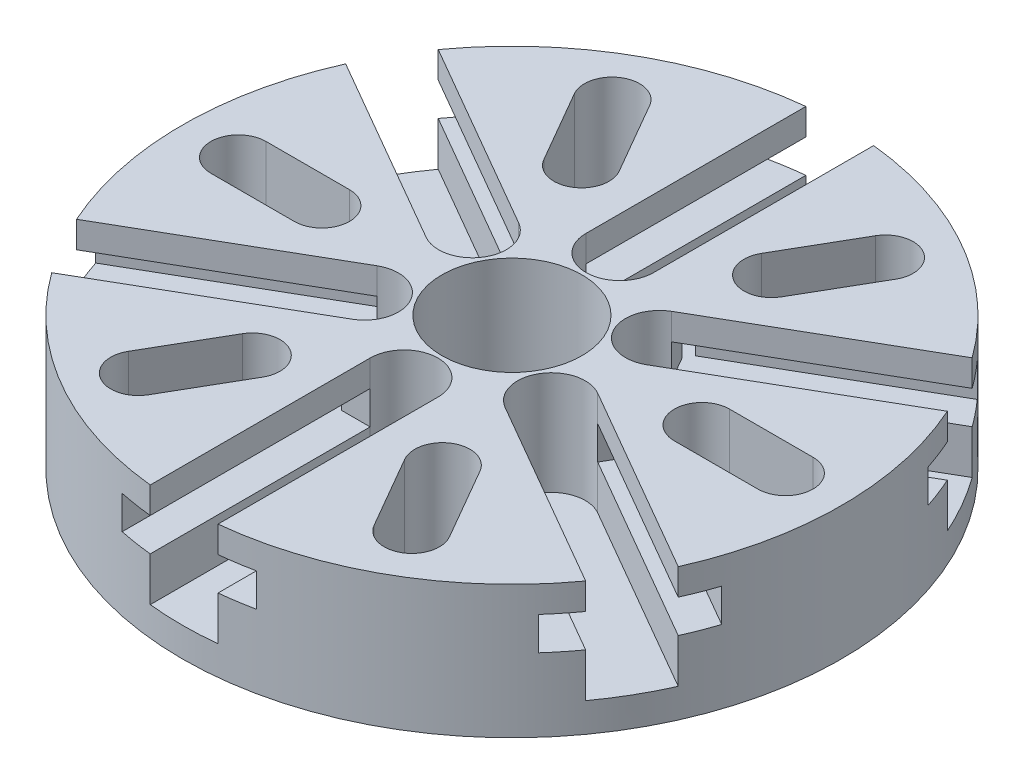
ISO-10303-21;
HEADER;
FILE_DESCRIPTION(('STEP AP214'),'2;1');
FILE_NAME('part.step','',(''),(''),'','','');
FILE_SCHEMA(('AUTOMOTIVE_DESIGN { 1 0 10303 214 1 1 1 1 }'));
ENDSEC;
DATA;
#1=APPLICATION_CONTEXT('core data for automotive mechanical design processes');
#2=APPLICATION_PROTOCOL_DEFINITION('international standard','automotive_design',2000,#1);
#3=PRODUCT_CONTEXT('',#1,'mechanical');
#4=PRODUCT('Part','Part','',(#3));
#5=PRODUCT_RELATED_PRODUCT_CATEGORY('part','',(#4));
#6=PRODUCT_DEFINITION_FORMATION('','',#4);
#7=PRODUCT_DEFINITION_CONTEXT('part definition',#1,'design');
#8=PRODUCT_DEFINITION('design','',#6,#7);
#9=PRODUCT_DEFINITION_SHAPE('','',#8);
#10=(LENGTH_UNIT() NAMED_UNIT(*) SI_UNIT(.MILLI.,.METRE.));
#11=(NAMED_UNIT(*) PLANE_ANGLE_UNIT() SI_UNIT($,.RADIAN.));
#12=(NAMED_UNIT(*) SI_UNIT($,.STERADIAN.) SOLID_ANGLE_UNIT());
#13=UNCERTAINTY_MEASURE_WITH_UNIT(LENGTH_MEASURE(1.E-05),#10,'distance_accuracy_value','');
#14=(GEOMETRIC_REPRESENTATION_CONTEXT(3) GLOBAL_UNCERTAINTY_ASSIGNED_CONTEXT((#13)) GLOBAL_UNIT_ASSIGNED_CONTEXT((#10,
#11,#12)) REPRESENTATION_CONTEXT('',''));
#15=CARTESIAN_POINT('',(0.,0.,0.));
#16=DIRECTION('',(0.,0.,1.));
#17=DIRECTION('',(1.,0.,0.));
#18=AXIS2_PLACEMENT_3D('',#15,#16,#17);
#19=CARTESIAN_POINT('',(8.93080037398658,0.,5.15620000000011));
#20=DIRECTION('',(0.866025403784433,0.,0.50000000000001));
#21=DIRECTION('',(0.50000000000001,0.,-0.866025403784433));
#22=AXIS2_PLACEMENT_3D('',#19,#20,#21);
#23=PLANE('',#22);
#24=DIRECTION('',(0.,1.,0.));
#25=VECTOR('',#24,1.);
#26=CARTESIAN_POINT('',(10.5500503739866,-6.36586124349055,2.35157672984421));
#27=LINE('',#26,#25);
#28=CARTESIAN_POINT('',(10.5500503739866,6.9977,2.35157672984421));
#29=VERTEX_POINT('',#28);
#30=CARTESIAN_POINT('',(10.5500503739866,10.1727,2.35157672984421));
#31=VERTEX_POINT('',#30);
#32=EDGE_CURVE('E11',#29,#31,#27,.T.);
#33=ORIENTED_EDGE('',*,*,#32,.F.);
#34=DIRECTION('',(0.50000000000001,0.,-0.866025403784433));
#35=VECTOR('',#34,1.);
#36=CARTESIAN_POINT('',(12.1375503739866,6.99770000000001,-0.398053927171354));
#37=LINE('',#36,#35);
#38=CARTESIAN_POINT('',(11.9077338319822,6.9977,1.25550611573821E-13));
#39=VERTEX_POINT('',#38);
#40=EDGE_CURVE('E826',#29,#39,#37,.T.);
#41=ORIENTED_EDGE('',*,*,#40,.T.);
#42=DIRECTION('',(0.,-1.,0.));
#43=VECTOR('',#42,1.);
#44=CARTESIAN_POINT('',(11.9077338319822,0.,1.25767452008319E-13));
#45=LINE('',#44,#43);
#46=CARTESIAN_POINT('',(11.9077338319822,10.1727,1.26580603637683E-13));
#47=VERTEX_POINT('',#46);
#48=EDGE_CURVE('E893',#47,#39,#45,.T.);
#49=ORIENTED_EDGE('',*,*,#48,.F.);
#50=DIRECTION('',(-0.50000000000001,0.,0.866025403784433));
#51=VECTOR('',#50,1.);
#52=CARTESIAN_POINT('',(10.5500503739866,10.1727,2.35157672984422));
#53=LINE('',#52,#51);
#54=EDGE_CURVE('E829',#47,#31,#53,.T.);
#55=ORIENTED_EDGE('',*,*,#54,.T.);
#56=EDGE_LOOP('',(#33,#41,#49,#55));
#57=FACE_BOUND('',#56,.T.);
#58=ADVANCED_FACE('F32',(#57),#23,.T.);
#59=CARTESIAN_POINT('',(8.93080037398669,0.,-5.15619999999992));
#60=DIRECTION('',(0.866025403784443,0.,-0.499999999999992));
#61=DIRECTION('',(-0.499999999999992,0.,-0.866025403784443));
#62=AXIS2_PLACEMENT_3D('',#59,#60,#61);
#63=PLANE('',#62);
#64=DIRECTION('',(0.,1.,0.));
#65=VECTOR('',#64,1.);
#66=CARTESIAN_POINT('',(7.31155037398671,-6.36586124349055,-7.96082327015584));
#67=LINE('',#66,#65);
#68=CARTESIAN_POINT('',(7.31155037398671,6.9977,-7.96082327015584));
#69=VERTEX_POINT('',#68);
#70=CARTESIAN_POINT('',(7.31155037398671,10.1727,-7.96082327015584));
#71=VERTEX_POINT('',#70);
#72=EDGE_CURVE('E1416',#69,#71,#67,.T.);
#73=ORIENTED_EDGE('',*,*,#72,.F.);
#74=DIRECTION('',(-0.499999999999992,0.,-0.866025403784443));
#75=VECTOR('',#74,1.);
#76=CARTESIAN_POINT('',(5.72405037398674,6.99770000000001,-10.7104539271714));
#77=LINE('',#76,#75);
#78=CARTESIAN_POINT('',(5.95386691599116,6.9977,-10.3124));
#79=VERTEX_POINT('',#78);
#80=EDGE_CURVE('E884',#69,#79,#77,.T.);
#81=ORIENTED_EDGE('',*,*,#80,.T.);
#82=DIRECTION('',(0.,-1.,0.));
#83=VECTOR('',#82,1.);
#84=CARTESIAN_POINT('',(5.95386691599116,0.,-10.3124));
#85=LINE('',#84,#83);
#86=CARTESIAN_POINT('',(5.95386691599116,10.1727,-10.3124));
#87=VERTEX_POINT('',#86);
#88=EDGE_CURVE('E952',#87,#79,#85,.T.);
#89=ORIENTED_EDGE('',*,*,#88,.F.);
#90=DIRECTION('',(0.499999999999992,0.,0.866025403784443));
#91=VECTOR('',#90,1.);
#92=CARTESIAN_POINT('',(7.31155037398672,10.1727,-7.96082327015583));
#93=LINE('',#92,#91);
#94=EDGE_CURVE('E886',#87,#71,#93,.T.);
#95=ORIENTED_EDGE('',*,*,#94,.T.);
#96=EDGE_LOOP('',(#73,#81,#89,#95));
#97=FACE_BOUND('',#96,.T.);
#98=ADVANCED_FACE('F1549',(#97),#63,.T.);
#99=CARTESIAN_POINT('',(0.,0.,-10.3124));
#100=DIRECTION('',(0.,0.,-1.));
#101=DIRECTION('',(-1.,0.,0.));
#102=AXIS2_PLACEMENT_3D('',#99,#100,#101);
#103=PLANE('',#102);
#104=DIRECTION('',(0.,1.,0.));
#105=VECTOR('',#104,1.);
#106=CARTESIAN_POINT('',(-3.23850000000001,-6.36586124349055,-10.3124));
#107=LINE('',#106,#105);
#108=CARTESIAN_POINT('',(-3.23850000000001,6.9977,-10.3124));
#109=VERTEX_POINT('',#108);
#110=CARTESIAN_POINT('',(-3.23850000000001,10.1727,-10.3124));
#111=VERTEX_POINT('',#110);
#112=EDGE_CURVE('E1412',#109,#111,#107,.T.);
#113=ORIENTED_EDGE('',*,*,#112,.F.);
#114=DIRECTION('',(-1.,0.,0.));
#115=VECTOR('',#114,1.);
#116=CARTESIAN_POINT('',(-6.4135,6.99770000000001,-10.3124));
#117=LINE('',#116,#115);
#118=CARTESIAN_POINT('',(-5.95386691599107,6.9977,-10.3124));
#119=VERTEX_POINT('',#118);
#120=EDGE_CURVE('E943',#109,#119,#117,.T.);
#121=ORIENTED_EDGE('',*,*,#120,.T.);
#122=DIRECTION('',(0.,-1.,0.));
#123=VECTOR('',#122,1.);
#124=CARTESIAN_POINT('',(-5.95386691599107,0.,-10.3124));
#125=LINE('',#124,#123);
#126=CARTESIAN_POINT('',(-5.95386691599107,10.1727,-10.3124));
#127=VERTEX_POINT('',#126);
#128=EDGE_CURVE('E1011',#127,#119,#125,.T.);
#129=ORIENTED_EDGE('',*,*,#128,.F.);
#130=DIRECTION('',(1.,0.,0.));
#131=VECTOR('',#130,1.);
#132=CARTESIAN_POINT('',(-3.2385,10.1727,-10.3124));
#133=LINE('',#132,#131);
#134=EDGE_CURVE('E945',#127,#111,#133,.T.);
#135=ORIENTED_EDGE('',*,*,#134,.T.);
#136=EDGE_LOOP('',(#113,#121,#129,#135));
#137=FACE_BOUND('',#136,.T.);
#138=ADVANCED_FACE('F1554',(#137),#103,.T.);
#139=CARTESIAN_POINT('',(-8.93080037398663,0.,-5.15620000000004));
#140=DIRECTION('',(-0.866025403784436,0.,-0.500000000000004));
#141=DIRECTION('',(-0.500000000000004,0.,0.866025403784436));
#142=AXIS2_PLACEMENT_3D('',#139,#140,#141);
#143=PLANE('',#142);
#144=DIRECTION('',(0.,1.,0.));
#145=VECTOR('',#144,1.);
#146=CARTESIAN_POINT('',(-10.5500503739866,-6.36586124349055,-2.35157672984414));
#147=LINE('',#146,#145);
#148=CARTESIAN_POINT('',(-10.5500503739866,6.9977,-2.35157672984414));
#149=VERTEX_POINT('',#148);
#150=CARTESIAN_POINT('',(-10.5500503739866,10.1727,-2.35157672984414));
#151=VERTEX_POINT('',#150);
#152=EDGE_CURVE('E1408',#149,#151,#147,.T.);
#153=ORIENTED_EDGE('',*,*,#152,.F.);
#154=DIRECTION('',(-0.500000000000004,0.,0.866025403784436));
#155=VECTOR('',#154,1.);
#156=CARTESIAN_POINT('',(-12.1375503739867,6.99770000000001,0.398053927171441));
#157=LINE('',#156,#155);
#158=CARTESIAN_POINT('',(-11.9077338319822,6.9977,0.));
#159=VERTEX_POINT('',#158);
#160=EDGE_CURVE('E1002',#149,#159,#157,.T.);
#161=ORIENTED_EDGE('',*,*,#160,.T.);
#162=DIRECTION('',(0.,-1.,0.));
#163=VECTOR('',#162,1.);
#164=CARTESIAN_POINT('',(-11.9077338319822,0.,0.));
#165=LINE('',#164,#163);
#166=CARTESIAN_POINT('',(-11.9077338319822,10.1727,0.));
#167=VERTEX_POINT('',#166);
#168=EDGE_CURVE('E1070',#167,#159,#165,.T.);
#169=ORIENTED_EDGE('',*,*,#168,.F.);
#170=DIRECTION('',(0.500000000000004,0.,-0.866025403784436));
#171=VECTOR('',#170,1.);
#172=CARTESIAN_POINT('',(-10.5500503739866,10.1727,-2.35157672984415));
#173=LINE('',#172,#171);
#174=EDGE_CURVE('E1004',#167,#151,#173,.T.);
#175=ORIENTED_EDGE('',*,*,#174,.T.);
#176=EDGE_LOOP('',(#153,#161,#169,#175));
#177=FACE_BOUND('',#176,.T.);
#178=ADVANCED_FACE('F1570',(#177),#143,.T.);
#179=CARTESIAN_POINT('',(-8.93080037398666,0.,5.15619999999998));
#180=DIRECTION('',(-0.86602540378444,0.,0.499999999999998));
#181=DIRECTION('',(0.499999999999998,0.,0.86602540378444));
#182=AXIS2_PLACEMENT_3D('',#179,#180,#181);
#183=PLANE('',#182);
#184=DIRECTION('',(0.,1.,0.));
#185=VECTOR('',#184,1.);
#186=CARTESIAN_POINT('',(-7.31155037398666,-6.36586124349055,7.96082327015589));
#187=LINE('',#186,#185);
#188=CARTESIAN_POINT('',(-7.31155037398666,6.9977,7.96082327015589));
#189=VERTEX_POINT('',#188);
#190=CARTESIAN_POINT('',(-7.31155037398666,10.1727,7.96082327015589));
#191=VERTEX_POINT('',#190);
#192=EDGE_CURVE('E1404',#189,#191,#187,.T.);
#193=ORIENTED_EDGE('',*,*,#192,.F.);
#194=DIRECTION('',(0.499999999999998,0.,0.86602540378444));
#195=VECTOR('',#194,1.);
#196=CARTESIAN_POINT('',(-5.72405037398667,6.99770000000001,10.7104539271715));
#197=LINE('',#196,#195);
#198=CARTESIAN_POINT('',(-5.95386691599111,6.9977,10.3124));
#199=VERTEX_POINT('',#198);
#200=EDGE_CURVE('E1061',#189,#199,#197,.T.);
#201=ORIENTED_EDGE('',*,*,#200,.T.);
#202=DIRECTION('',(0.,1.,0.));
#203=VECTOR('',#202,1.);
#204=CARTESIAN_POINT('',(-5.95386691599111,6.99769999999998,10.3124));
#205=LINE('',#204,#203);
#206=CARTESIAN_POINT('',(-5.95386691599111,10.1727,10.3124));
#207=VERTEX_POINT('',#206);
#208=EDGE_CURVE('E1116',#199,#207,#205,.T.);
#209=ORIENTED_EDGE('',*,*,#208,.T.);
#210=DIRECTION('',(-0.499999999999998,0.,-0.86602540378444));
#211=VECTOR('',#210,1.);
#212=CARTESIAN_POINT('',(-7.31155037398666,10.1727,7.96082327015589));
#213=LINE('',#212,#211);
#214=EDGE_CURVE('E1063',#207,#191,#213,.T.);
#215=ORIENTED_EDGE('',*,*,#214,.T.);
#216=EDGE_LOOP('',(#193,#201,#209,#215));
#217=FACE_BOUND('',#216,.T.);
#218=ADVANCED_FACE('F1579',(#217),#183,.T.);
#219=CARTESIAN_POINT('',(3.23849999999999,6.99769999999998,10.3124));
#220=DIRECTION('',(0.,0.,-1.));
#221=DIRECTION('',(-1.,0.,0.));
#222=AXIS2_PLACEMENT_3D('',#219,#220,#221);
#223=PLANE('',#222);
#224=ORIENTED_EDGE('',*,*,#208,.F.);
#225=DIRECTION('',(1.,0.,0.));
#226=VECTOR('',#225,1.);
#227=CARTESIAN_POINT('',(-3.2385,6.9977,10.3124));
#228=LINE('',#227,#226);
#229=CARTESIAN_POINT('',(-3.23850000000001,6.9977,10.3124));
#230=VERTEX_POINT('',#229);
#231=EDGE_CURVE('E1210',#199,#230,#228,.T.);
#232=ORIENTED_EDGE('',*,*,#231,.T.);
#233=DIRECTION('',(0.,1.,0.));
#234=VECTOR('',#233,1.);
#235=CARTESIAN_POINT('',(-3.23850000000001,-6.36586124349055,10.3124));
#236=LINE('',#235,#234);
#237=CARTESIAN_POINT('',(-3.23850000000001,10.1727,10.3124));
#238=VERTEX_POINT('',#237);
#239=EDGE_CURVE('E1297',#230,#238,#236,.T.);
#240=ORIENTED_EDGE('',*,*,#239,.T.);
#241=DIRECTION('',(-1.,0.,0.));
#242=VECTOR('',#241,1.);
#243=CARTESIAN_POINT('',(-6.4135,10.1727,10.3124));
#244=LINE('',#243,#242);
#245=EDGE_CURVE('E1207',#238,#207,#244,.T.);
#246=ORIENTED_EDGE('',*,*,#245,.T.);
#247=EDGE_LOOP('',(#224,#232,#240,#246));
#248=FACE_BOUND('',#247,.T.);
#249=ADVANCED_FACE('F1497',(#248),#223,.F.);
#250=DIRECTION('',(0.,-1.,0.));
#251=VECTOR('',#250,1.);
#252=CARTESIAN_POINT('',(5.95386691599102,6.99769999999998,10.3124));
#253=LINE('',#252,#251);
#254=CARTESIAN_POINT('',(5.95386691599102,10.1727,10.3124));
#255=VERTEX_POINT('',#254);
#256=CARTESIAN_POINT('',(5.95386691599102,6.9977,10.3124));
#257=VERTEX_POINT('',#256);
#258=EDGE_CURVE('E1300',#255,#257,#253,.T.);
#259=ORIENTED_EDGE('',*,*,#258,.F.);
#260=DIRECTION('',(-1.,0.,0.));
#261=VECTOR('',#260,1.);
#262=CARTESIAN_POINT('',(3.2385,10.1727,10.3124));
#263=LINE('',#262,#261);
#264=CARTESIAN_POINT('',(3.23850000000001,10.1727,10.3124));
#265=VERTEX_POINT('',#264);
#266=EDGE_CURVE('E1219',#255,#265,#263,.T.);
#267=ORIENTED_EDGE('',*,*,#266,.T.);
#268=DIRECTION('',(0.,1.,0.));
#269=VECTOR('',#268,1.);
#270=CARTESIAN_POINT('',(3.23850000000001,-6.36586124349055,10.3124));
#271=LINE('',#270,#269);
#272=CARTESIAN_POINT('',(3.23850000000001,6.9977,10.3124));
#273=VERTEX_POINT('',#272);
#274=EDGE_CURVE('E1294',#265,#273,#271,.F.);
#275=ORIENTED_EDGE('',*,*,#274,.T.);
#276=DIRECTION('',(1.,0.,0.));
#277=VECTOR('',#276,1.);
#278=CARTESIAN_POINT('',(6.4135,6.99770000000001,10.3124));
#279=LINE('',#278,#277);
#280=EDGE_CURVE('E1216',#273,#257,#279,.T.);
#281=ORIENTED_EDGE('',*,*,#280,.T.);
#282=EDGE_LOOP('',(#259,#267,#275,#281));
#283=FACE_BOUND('',#282,.T.);
#284=ADVANCED_FACE('F1519',(#283),#223,.F.);
#285=CARTESIAN_POINT('',(0.,12.7,0.));
#286=DIRECTION('',(0.,-1.,0.));
#287=DIRECTION('',(0.,0.,-1.));
#288=AXIS2_PLACEMENT_3D('',#285,#286,#287);
#289=CYLINDRICAL_SURFACE('',#288,31.496);
#290=CARTESIAN_POINT('',(0.,12.7,0.));
#291=DIRECTION('',(0.,1.,0.));
#292=DIRECTION('',(0.,0.,1.));
#293=AXIS2_PLACEMENT_3D('',#290,#291,#292);
#294=CIRCLE('',#293,31.496);
#295=CARTESIAN_POINT('',(-25.5125136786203,12.7,18.4691543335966));
#296=VERTEX_POINT('',#295);
#297=CARTESIAN_POINT('',(-3.23849999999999,12.7,31.3290621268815));
#298=VERTEX_POINT('',#297);
#299=EDGE_CURVE('E1265',#296,#298,#294,.T.);
#300=ORIENTED_EDGE('',*,*,#299,.F.);
#301=DIRECTION('',(0.,-1.,0.));
#302=VECTOR('',#301,1.);
#303=CARTESIAN_POINT('',(-25.5125136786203,12.7,18.4691543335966));
#304=LINE('',#303,#302);
#305=CARTESIAN_POINT('',(-25.5125136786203,10.1727,18.4691543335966));
#306=VERTEX_POINT('',#305);
#307=EDGE_CURVE('E1157',#296,#306,#304,.T.);
#308=ORIENTED_EDGE('',*,*,#307,.T.);
#309=CARTESIAN_POINT('',(0.,10.1727,0.));
#310=DIRECTION('',(0.,1.,0.));
#311=DIRECTION('',(0.,0.,1.));
#312=AXIS2_PLACEMENT_3D('',#309,#310,#311);
#313=CIRCLE('',#312,31.496);
#314=CARTESIAN_POINT('',(-23.4980955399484,10.1727,20.972303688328));
#315=VERTEX_POINT('',#314);
#316=EDGE_CURVE('E1121',#306,#315,#313,.T.);
#317=ORIENTED_EDGE('',*,*,#316,.T.);
#318=DIRECTION('',(0.,-1.,0.));
#319=VECTOR('',#318,1.);
#320=CARTESIAN_POINT('',(-23.4980955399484,12.7,20.972303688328));
#321=LINE('',#320,#319);
#322=CARTESIAN_POINT('',(-23.4980955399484,6.99770000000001,20.972303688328));
#323=VERTEX_POINT('',#322);
#324=EDGE_CURVE('E1113',#315,#323,#321,.T.);
#325=ORIENTED_EDGE('',*,*,#324,.T.);
#326=CARTESIAN_POINT('',(0.,6.99769999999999,0.));
#327=DIRECTION('',(0.,-1.,0.));
#328=DIRECTION('',(0.,0.,-1.));
#329=AXIS2_PLACEMENT_3D('',#326,#327,#328);
#330=CIRCLE('',#329,31.496);
#331=CARTESIAN_POINT('',(-25.5125136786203,6.9977,18.4691543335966));
#332=VERTEX_POINT('',#331);
#333=EDGE_CURVE('E1118',#323,#332,#330,.T.);
#334=ORIENTED_EDGE('',*,*,#333,.T.);
#335=DIRECTION('',(0.,-1.,0.));
#336=VECTOR('',#335,1.);
#337=CARTESIAN_POINT('',(-25.5125136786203,12.7,18.4691543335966));
#338=LINE('',#337,#336);
#339=CARTESIAN_POINT('',(-25.5125136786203,2.794,18.4691543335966));
#340=VERTEX_POINT('',#339);
#341=EDGE_CURVE('E1399',#332,#340,#338,.T.);
#342=ORIENTED_EDGE('',*,*,#341,.T.);
#343=CARTESIAN_POINT('',(0.,2.794,0.));
#344=DIRECTION('',(0.,-1.,0.));
#345=DIRECTION('',(0.,0.,-1.));
#346=AXIS2_PLACEMENT_3D('',#343,#344,#345);
#347=CIRCLE('',#346,31.496);
#348=CARTESIAN_POINT('',(-28.7510136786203,2.794,12.8599077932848));
#349=VERTEX_POINT('',#348);
#350=EDGE_CURVE('E1389',#340,#349,#347,.T.);
#351=ORIENTED_EDGE('',*,*,#350,.T.);
#352=DIRECTION('',(0.,-1.,0.));
#353=VECTOR('',#352,1.);
#354=CARTESIAN_POINT('',(-28.7510136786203,12.7,12.8599077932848));
#355=LINE('',#354,#353);
#356=CARTESIAN_POINT('',(-28.7510136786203,6.9977,12.8599077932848));
#357=VERTEX_POINT('',#356);
#358=EDGE_CURVE('E1393',#349,#357,#355,.F.);
#359=ORIENTED_EDGE('',*,*,#358,.T.);
#360=CARTESIAN_POINT('',(0.,6.99769999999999,0.));
#361=DIRECTION('',(0.,-1.,0.));
#362=DIRECTION('',(0.,0.,-1.));
#363=AXIS2_PLACEMENT_3D('',#360,#361,#362);
#364=CIRCLE('',#363,31.496);
#365=CARTESIAN_POINT('',(-29.9115955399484,6.99770000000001,9.863795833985));
#366=VERTEX_POINT('',#365);
#367=EDGE_CURVE('E1383',#357,#366,#364,.T.);
#368=ORIENTED_EDGE('',*,*,#367,.T.);
#369=DIRECTION('',(0.,-1.,0.));
#370=VECTOR('',#369,1.);
#371=CARTESIAN_POINT('',(-29.9115955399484,12.7,9.863795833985));
#372=LINE('',#371,#370);
#373=CARTESIAN_POINT('',(-29.9115955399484,10.1727,9.863795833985));
#374=VERTEX_POINT('',#373);
#375=EDGE_CURVE('E1396',#366,#374,#372,.F.);
#376=ORIENTED_EDGE('',*,*,#375,.T.);
#377=CARTESIAN_POINT('',(0.,10.1727,0.));
#378=DIRECTION('',(0.,1.,0.));
#379=DIRECTION('',(0.,0.,1.));
#380=AXIS2_PLACEMENT_3D('',#377,#378,#379);
#381=CIRCLE('',#380,31.496);
#382=CARTESIAN_POINT('',(-28.7510136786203,10.1727,12.8599077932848));
#383=VERTEX_POINT('',#382);
#384=EDGE_CURVE('E1390',#374,#383,#381,.T.);
#385=ORIENTED_EDGE('',*,*,#384,.T.);
#386=DIRECTION('',(0.,-1.,0.));
#387=VECTOR('',#386,1.);
#388=CARTESIAN_POINT('',(-28.7510136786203,12.7,12.8599077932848));
#389=LINE('',#388,#387);
#390=CARTESIAN_POINT('',(-28.7510136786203,12.7,12.8599077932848));
#391=VERTEX_POINT('',#390);
#392=EDGE_CURVE('E1154',#383,#391,#389,.F.);
#393=ORIENTED_EDGE('',*,*,#392,.T.);
#394=CARTESIAN_POINT('',(-28.7510136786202,12.7,-12.859907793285));
#395=VERTEX_POINT('',#394);
#396=EDGE_CURVE('E1473',#395,#391,#294,.T.);
#397=ORIENTED_EDGE('',*,*,#396,.F.);
#398=DIRECTION('',(0.,-1.,0.));
#399=VECTOR('',#398,1.);
#400=CARTESIAN_POINT('',(-28.7510136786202,12.7,-12.859907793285));
#401=LINE('',#400,#399);
#402=CARTESIAN_POINT('',(-28.7510136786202,10.1727,-12.859907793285));
#403=VERTEX_POINT('',#402);
#404=EDGE_CURVE('E1151',#395,#403,#401,.T.);
#405=ORIENTED_EDGE('',*,*,#404,.T.);
#406=CARTESIAN_POINT('',(-29.9115955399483,10.1727,-9.8637958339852));
#407=VERTEX_POINT('',#406);
#408=EDGE_CURVE('E1386',#403,#407,#381,.T.);
#409=ORIENTED_EDGE('',*,*,#408,.T.);
#410=DIRECTION('',(0.,-1.,0.));
#411=VECTOR('',#410,1.);
#412=CARTESIAN_POINT('',(-29.9115955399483,12.7,-9.86379583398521));
#413=LINE('',#412,#411);
#414=CARTESIAN_POINT('',(-29.9115955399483,6.99770000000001,-9.8637958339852));
#415=VERTEX_POINT('',#414);
#416=EDGE_CURVE('E1382',#407,#415,#413,.T.);
#417=ORIENTED_EDGE('',*,*,#416,.T.);
#418=CARTESIAN_POINT('',(-28.7510136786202,6.9977,-12.859907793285));
#419=VERTEX_POINT('',#418);
#420=EDGE_CURVE('E1379',#415,#419,#364,.T.);
#421=ORIENTED_EDGE('',*,*,#420,.T.);
#422=DIRECTION('',(0.,-1.,0.));
#423=VECTOR('',#422,1.);
#424=CARTESIAN_POINT('',(-28.7510136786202,12.7,-12.859907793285));
#425=LINE('',#424,#423);
#426=CARTESIAN_POINT('',(-28.7510136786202,2.794,-12.859907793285));
#427=VERTEX_POINT('',#426);
#428=EDGE_CURVE('E1376',#419,#427,#425,.T.);
#429=ORIENTED_EDGE('',*,*,#428,.T.);
#430=CARTESIAN_POINT('',(0.,2.794,0.));
#431=DIRECTION('',(0.,-1.,0.));
#432=DIRECTION('',(0.,0.,-1.));
#433=AXIS2_PLACEMENT_3D('',#430,#431,#432);
#434=CIRCLE('',#433,31.496);
#435=CARTESIAN_POINT('',(-25.5125136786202,2.794,-18.4691543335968));
#436=VERTEX_POINT('',#435);
#437=EDGE_CURVE('E1367',#427,#436,#434,.T.);
#438=ORIENTED_EDGE('',*,*,#437,.T.);
#439=DIRECTION('',(0.,-1.,0.));
#440=VECTOR('',#439,1.);
#441=CARTESIAN_POINT('',(-25.5125136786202,12.7,-18.4691543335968));
#442=LINE('',#441,#440);
#443=CARTESIAN_POINT('',(-25.5125136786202,6.9977,-18.4691543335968));
#444=VERTEX_POINT('',#443);
#445=EDGE_CURVE('E1370',#436,#444,#442,.F.);
#446=ORIENTED_EDGE('',*,*,#445,.T.);
#447=CARTESIAN_POINT('',(0.,6.99769999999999,0.));
#448=DIRECTION('',(0.,-1.,0.));
#449=DIRECTION('',(0.,0.,-1.));
#450=AXIS2_PLACEMENT_3D('',#447,#448,#449);
#451=CIRCLE('',#450,31.496);
#452=CARTESIAN_POINT('',(-23.4980955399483,6.99770000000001,-20.9723036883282));
#453=VERTEX_POINT('',#452);
#454=EDGE_CURVE('E1354',#444,#453,#451,.T.);
#455=ORIENTED_EDGE('',*,*,#454,.T.);
#456=DIRECTION('',(0.,-1.,0.));
#457=VECTOR('',#456,1.);
#458=CARTESIAN_POINT('',(-23.4980955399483,12.7,-20.9723036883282));
#459=LINE('',#458,#457);
#460=CARTESIAN_POINT('',(-23.4980955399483,10.1727,-20.9723036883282));
#461=VERTEX_POINT('',#460);
#462=EDGE_CURVE('E1373',#453,#461,#459,.F.);
#463=ORIENTED_EDGE('',*,*,#462,.T.);
#464=CARTESIAN_POINT('',(0.,10.1727,0.));
#465=DIRECTION('',(0.,1.,0.));
#466=DIRECTION('',(0.,0.,1.));
#467=AXIS2_PLACEMENT_3D('',#464,#465,#466);
#468=CIRCLE('',#467,31.496);
#469=CARTESIAN_POINT('',(-25.5125136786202,10.1727,-18.4691543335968));
#470=VERTEX_POINT('',#469);
#471=EDGE_CURVE('E1360',#461,#470,#468,.T.);
#472=ORIENTED_EDGE('',*,*,#471,.T.);
#473=DIRECTION('',(0.,-1.,0.));
#474=VECTOR('',#473,1.);
#475=CARTESIAN_POINT('',(-25.5125136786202,12.7,-18.4691543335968));
#476=LINE('',#475,#474);
#477=CARTESIAN_POINT('',(-25.5125136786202,12.7,-18.4691543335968));
#478=VERTEX_POINT('',#477);
#479=EDGE_CURVE('E1148',#470,#478,#476,.F.);
#480=ORIENTED_EDGE('',*,*,#479,.T.);
#481=CARTESIAN_POINT('',(-3.23850000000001,12.7,-31.3290621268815));
#482=VERTEX_POINT('',#481);
#483=EDGE_CURVE('E1469',#482,#478,#294,.T.);
#484=ORIENTED_EDGE('',*,*,#483,.F.);
#485=DIRECTION('',(0.,-1.,0.));
#486=VECTOR('',#485,1.);
#487=CARTESIAN_POINT('',(-3.23850000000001,12.7,-31.3290621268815));
#488=LINE('',#487,#486);
#489=CARTESIAN_POINT('',(-3.2385,10.1727,-31.3290621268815));
#490=VERTEX_POINT('',#489);
#491=EDGE_CURVE('E1145',#482,#490,#488,.T.);
#492=ORIENTED_EDGE('',*,*,#491,.T.);
#493=CARTESIAN_POINT('',(-6.4135,10.1727,-30.8360995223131));
#494=VERTEX_POINT('',#493);
#495=EDGE_CURVE('E1357',#490,#494,#468,.T.);
#496=ORIENTED_EDGE('',*,*,#495,.T.);
#497=DIRECTION('',(0.,-1.,0.));
#498=VECTOR('',#497,1.);
#499=CARTESIAN_POINT('',(-6.4135,12.7,-30.8360995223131));
#500=LINE('',#499,#498);
#501=CARTESIAN_POINT('',(-6.4135,6.99770000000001,-30.8360995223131));
#502=VERTEX_POINT('',#501);
#503=EDGE_CURVE('E1353',#494,#502,#500,.T.);
#504=ORIENTED_EDGE('',*,*,#503,.T.);
#505=CARTESIAN_POINT('',(-3.2385,6.9977,-31.3290621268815));
#506=VERTEX_POINT('',#505);
#507=EDGE_CURVE('E1350',#502,#506,#451,.T.);
#508=ORIENTED_EDGE('',*,*,#507,.T.);
#509=DIRECTION('',(0.,-1.,0.));
#510=VECTOR('',#509,1.);
#511=CARTESIAN_POINT('',(-3.2385,12.7,-31.3290621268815));
#512=LINE('',#511,#510);
#513=CARTESIAN_POINT('',(-3.2385,2.794,-31.3290621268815));
#514=VERTEX_POINT('',#513);
#515=EDGE_CURVE('E1347',#506,#514,#512,.T.);
#516=ORIENTED_EDGE('',*,*,#515,.T.);
#517=CARTESIAN_POINT('',(0.,2.794,0.));
#518=DIRECTION('',(0.,-1.,0.));
#519=DIRECTION('',(0.,0.,-1.));
#520=AXIS2_PLACEMENT_3D('',#517,#518,#519);
#521=CIRCLE('',#520,31.496);
#522=CARTESIAN_POINT('',(3.2385,2.794,-31.3290621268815));
#523=VERTEX_POINT('',#522);
#524=EDGE_CURVE('E1344',#514,#523,#521,.T.);
#525=ORIENTED_EDGE('',*,*,#524,.T.);
#526=DIRECTION('',(0.,-1.,0.));
#527=VECTOR('',#526,1.);
#528=CARTESIAN_POINT('',(3.2385,12.7,-31.3290621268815));
#529=LINE('',#528,#527);
#530=CARTESIAN_POINT('',(3.2385,6.9977,-31.3290621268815));
#531=VERTEX_POINT('',#530);
#532=EDGE_CURVE('E1364',#523,#531,#529,.F.);
#533=ORIENTED_EDGE('',*,*,#532,.T.);
#534=CARTESIAN_POINT('',(0.,6.99769999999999,0.));
#535=DIRECTION('',(0.,-1.,0.));
#536=DIRECTION('',(1.,0.,0.));
#537=AXIS2_PLACEMENT_3D('',#534,#535,#536);
#538=CIRCLE('',#537,31.496);
#539=CARTESIAN_POINT('',(6.4135,6.99770000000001,-30.8360995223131));
#540=VERTEX_POINT('',#539);
#541=EDGE_CURVE('E1338',#531,#540,#538,.T.);
#542=ORIENTED_EDGE('',*,*,#541,.T.);
#543=DIRECTION('',(0.,-1.,0.));
#544=VECTOR('',#543,1.);
#545=CARTESIAN_POINT('',(6.4135,12.7,-30.8360995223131));
#546=LINE('',#545,#544);
#547=CARTESIAN_POINT('',(6.4135,10.1727,-30.8360995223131));
#548=VERTEX_POINT('',#547);
#549=EDGE_CURVE('E1361',#540,#548,#546,.F.);
#550=ORIENTED_EDGE('',*,*,#549,.T.);
#551=CARTESIAN_POINT('',(0.,10.1727,0.));
#552=DIRECTION('',(0.,1.,0.));
#553=DIRECTION('',(0.,0.,1.));
#554=AXIS2_PLACEMENT_3D('',#551,#552,#553);
#555=CIRCLE('',#554,31.496);
#556=CARTESIAN_POINT('',(3.2385,10.1727,-31.3290621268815));
#557=VERTEX_POINT('',#556);
#558=EDGE_CURVE('E1345',#548,#557,#555,.T.);
#559=ORIENTED_EDGE('',*,*,#558,.T.);
#560=DIRECTION('',(0.,-1.,0.));
#561=VECTOR('',#560,1.);
#562=CARTESIAN_POINT('',(3.23849999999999,12.7,-31.3290621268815));
#563=LINE('',#562,#561);
#564=CARTESIAN_POINT('',(3.23849999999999,12.7,-31.3290621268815));
#565=VERTEX_POINT('',#564);
#566=EDGE_CURVE('E1142',#557,#565,#563,.F.);
#567=ORIENTED_EDGE('',*,*,#566,.T.);
#568=CARTESIAN_POINT('',(25.5125136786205,12.7,-18.4691543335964));
#569=VERTEX_POINT('',#568);
#570=EDGE_CURVE('E1467',#569,#565,#294,.T.);
#571=ORIENTED_EDGE('',*,*,#570,.F.);
#572=DIRECTION('',(0.,-1.,0.));
#573=VECTOR('',#572,1.);
#574=CARTESIAN_POINT('',(25.5125136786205,12.7,-18.4691543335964));
#575=LINE('',#574,#573);
#576=CARTESIAN_POINT('',(25.5125136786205,10.1727,-18.4691543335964));
#577=VERTEX_POINT('',#576);
#578=EDGE_CURVE('E1139',#569,#577,#575,.T.);
#579=ORIENTED_EDGE('',*,*,#578,.T.);
#580=CARTESIAN_POINT('',(23.4980955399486,10.1727,-20.9723036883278));
#581=VERTEX_POINT('',#580);
#582=EDGE_CURVE('E1341',#577,#581,#555,.T.);
#583=ORIENTED_EDGE('',*,*,#582,.T.);
#584=DIRECTION('',(0.,-1.,0.));
#585=VECTOR('',#584,1.);
#586=CARTESIAN_POINT('',(23.4980955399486,12.7,-20.9723036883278));
#587=LINE('',#586,#585);
#588=CARTESIAN_POINT('',(23.4980955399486,6.99770000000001,-20.9723036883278));
#589=VERTEX_POINT('',#588);
#590=EDGE_CURVE('E1337',#581,#589,#587,.T.);
#591=ORIENTED_EDGE('',*,*,#590,.T.);
#592=CARTESIAN_POINT('',(25.5125136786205,6.9977,-18.4691543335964));
#593=VERTEX_POINT('',#592);
#594=EDGE_CURVE('E1334',#589,#593,#538,.T.);
#595=ORIENTED_EDGE('',*,*,#594,.T.);
#596=DIRECTION('',(0.,-1.,0.));
#597=VECTOR('',#596,1.);
#598=CARTESIAN_POINT('',(25.5125136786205,12.7,-18.4691543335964));
#599=LINE('',#598,#597);
#600=CARTESIAN_POINT('',(25.5125136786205,2.794,-18.4691543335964));
#601=VERTEX_POINT('',#600);
#602=EDGE_CURVE('E1331',#593,#601,#599,.T.);
#603=ORIENTED_EDGE('',*,*,#602,.T.);
#604=CARTESIAN_POINT('',(0.,2.794,0.));
#605=DIRECTION('',(0.,-1.,0.));
#606=DIRECTION('',(0.,0.,-1.));
#607=AXIS2_PLACEMENT_3D('',#604,#605,#606);
#608=CIRCLE('',#607,31.496);
#609=CARTESIAN_POINT('',(28.7510136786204,2.794,-12.8599077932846));
#610=VERTEX_POINT('',#609);
#611=EDGE_CURVE('E1321',#601,#610,#608,.T.);
#612=ORIENTED_EDGE('',*,*,#611,.T.);
#613=DIRECTION('',(0.,-1.,0.));
#614=VECTOR('',#613,1.);
#615=CARTESIAN_POINT('',(28.7510136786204,12.7,-12.8599077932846));
#616=LINE('',#615,#614);
#617=CARTESIAN_POINT('',(28.7510136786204,6.9977,-12.8599077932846));
#618=VERTEX_POINT('',#617);
#619=EDGE_CURVE('E1325',#610,#618,#616,.F.);
#620=ORIENTED_EDGE('',*,*,#619,.T.);
#621=CARTESIAN_POINT('',(0.,6.99769999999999,0.));
#622=DIRECTION('',(0.,-1.,0.));
#623=DIRECTION('',(0.,0.,-1.));
#624=AXIS2_PLACEMENT_3D('',#621,#622,#623);
#625=CIRCLE('',#624,31.496);
#626=CARTESIAN_POINT('',(29.9115955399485,6.99770000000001,-9.86379583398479));
#627=VERTEX_POINT('',#626);
#628=EDGE_CURVE('E1315',#618,#627,#625,.T.);
#629=ORIENTED_EDGE('',*,*,#628,.T.);
#630=DIRECTION('',(0.,-1.,0.));
#631=VECTOR('',#630,1.);
#632=CARTESIAN_POINT('',(29.9115955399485,12.7,-9.86379583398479));
#633=LINE('',#632,#631);
#634=CARTESIAN_POINT('',(29.9115955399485,10.1727,-9.86379583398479));
#635=VERTEX_POINT('',#634);
#636=EDGE_CURVE('E1328',#627,#635,#633,.F.);
#637=ORIENTED_EDGE('',*,*,#636,.T.);
#638=CARTESIAN_POINT('',(0.,10.1727,0.));
#639=DIRECTION('',(0.,1.,0.));
#640=DIRECTION('',(0.,0.,1.));
#641=AXIS2_PLACEMENT_3D('',#638,#639,#640);
#642=CIRCLE('',#641,31.496);
#643=CARTESIAN_POINT('',(28.7510136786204,10.1727,-12.8599077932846));
#644=VERTEX_POINT('',#643);
#645=EDGE_CURVE('E1322',#635,#644,#642,.T.);
#646=ORIENTED_EDGE('',*,*,#645,.T.);
#647=DIRECTION('',(0.,-1.,0.));
#648=VECTOR('',#647,1.);
#649=CARTESIAN_POINT('',(28.7510136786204,12.7,-12.8599077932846));
#650=LINE('',#649,#648);
#651=CARTESIAN_POINT('',(28.7510136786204,12.7,-12.8599077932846));
#652=VERTEX_POINT('',#651);
#653=EDGE_CURVE('E1136',#644,#652,#650,.F.);
#654=ORIENTED_EDGE('',*,*,#653,.T.);
#655=CARTESIAN_POINT('',(28.7510136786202,12.7,12.8599077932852));
#656=VERTEX_POINT('',#655);
#657=EDGE_CURVE('E1264',#656,#652,#294,.T.);
#658=ORIENTED_EDGE('',*,*,#657,.F.);
#659=DIRECTION('',(0.,-1.,0.));
#660=VECTOR('',#659,1.);
#661=CARTESIAN_POINT('',(28.7510136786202,12.7,12.8599077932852));
#662=LINE('',#661,#660);
#663=CARTESIAN_POINT('',(28.7510136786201,10.1727,12.8599077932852));
#664=VERTEX_POINT('',#663);
#665=EDGE_CURVE('E1133',#656,#664,#662,.T.);
#666=ORIENTED_EDGE('',*,*,#665,.T.);
#667=CARTESIAN_POINT('',(29.9115955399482,10.1727,9.86379583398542));
#668=VERTEX_POINT('',#667);
#669=EDGE_CURVE('E1318',#664,#668,#642,.T.);
#670=ORIENTED_EDGE('',*,*,#669,.T.);
#671=DIRECTION('',(0.,-1.,0.));
#672=VECTOR('',#671,1.);
#673=CARTESIAN_POINT('',(29.9115955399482,12.7,9.86379583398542));
#674=LINE('',#673,#672);
#675=CARTESIAN_POINT('',(29.9115955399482,6.99770000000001,9.86379583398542));
#676=VERTEX_POINT('',#675);
#677=EDGE_CURVE('E1314',#668,#676,#674,.T.);
#678=ORIENTED_EDGE('',*,*,#677,.T.);
#679=CARTESIAN_POINT('',(28.7510136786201,6.9977,12.8599077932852));
#680=VERTEX_POINT('',#679);
#681=EDGE_CURVE('E1311',#676,#680,#625,.T.);
#682=ORIENTED_EDGE('',*,*,#681,.T.);
#683=DIRECTION('',(0.,-1.,0.));
#684=VECTOR('',#683,1.);
#685=CARTESIAN_POINT('',(28.7510136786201,12.7,12.8599077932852));
#686=LINE('',#685,#684);
#687=CARTESIAN_POINT('',(28.7510136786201,2.794,12.8599077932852));
#688=VERTEX_POINT('',#687);
#689=EDGE_CURVE('E1308',#680,#688,#686,.T.);
#690=ORIENTED_EDGE('',*,*,#689,.T.);
#691=CARTESIAN_POINT('',(0.,2.794,0.));
#692=DIRECTION('',(0.,-1.,0.));
#693=DIRECTION('',(0.,0.,-1.));
#694=AXIS2_PLACEMENT_3D('',#691,#692,#693);
#695=CIRCLE('',#694,31.496);
#696=CARTESIAN_POINT('',(25.5125136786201,2.794,18.4691543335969));
#697=VERTEX_POINT('',#696);
#698=EDGE_CURVE('E1302',#688,#697,#695,.T.);
#699=ORIENTED_EDGE('',*,*,#698,.T.);
#700=DIRECTION('',(0.,-1.,0.));
#701=VECTOR('',#700,1.);
#702=CARTESIAN_POINT('',(25.5125136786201,12.7,18.4691543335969));
#703=LINE('',#702,#701);
#704=CARTESIAN_POINT('',(25.5125136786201,6.9977,18.4691543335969));
#705=VERTEX_POINT('',#704);
#706=EDGE_CURVE('E1305',#697,#705,#703,.F.);
#707=ORIENTED_EDGE('',*,*,#706,.T.);
#708=CARTESIAN_POINT('',(0.,6.99769999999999,0.));
#709=DIRECTION('',(0.,-1.,0.));
#710=DIRECTION('',(0.,0.,-1.));
#711=AXIS2_PLACEMENT_3D('',#708,#709,#710);
#712=CIRCLE('',#711,31.496);
#713=CARTESIAN_POINT('',(23.4980955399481,6.99770000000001,20.9723036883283));
#714=VERTEX_POINT('',#713);
#715=EDGE_CURVE('E1107',#705,#714,#712,.T.);
#716=ORIENTED_EDGE('',*,*,#715,.T.);
#717=DIRECTION('',(0.,-1.,0.));
#718=VECTOR('',#717,1.);
#719=CARTESIAN_POINT('',(23.4980955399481,12.7,20.9723036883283));
#720=LINE('',#719,#718);
#721=CARTESIAN_POINT('',(23.4980955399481,10.1727,20.9723036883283));
#722=VERTEX_POINT('',#721);
#723=EDGE_CURVE('E1127',#714,#722,#720,.F.);
#724=ORIENTED_EDGE('',*,*,#723,.T.);
#725=CARTESIAN_POINT('',(0.,10.1727,0.));
#726=DIRECTION('',(0.,1.,0.));
#727=DIRECTION('',(0.,0.,1.));
#728=AXIS2_PLACEMENT_3D('',#725,#726,#727);
#729=CIRCLE('',#728,31.496);
#730=CARTESIAN_POINT('',(25.5125136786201,10.1727,18.4691543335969));
#731=VERTEX_POINT('',#730);
#732=EDGE_CURVE('E1104',#722,#731,#729,.T.);
#733=ORIENTED_EDGE('',*,*,#732,.T.);
#734=DIRECTION('',(0.,-1.,0.));
#735=VECTOR('',#734,1.);
#736=CARTESIAN_POINT('',(25.5125136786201,12.7,18.4691543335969));
#737=LINE('',#736,#735);
#738=CARTESIAN_POINT('',(25.5125136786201,12.7,18.4691543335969));
#739=VERTEX_POINT('',#738);
#740=EDGE_CURVE('E1130',#731,#739,#737,.F.);
#741=ORIENTED_EDGE('',*,*,#740,.T.);
#742=CARTESIAN_POINT('',(3.23850000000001,12.7,31.3290621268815));
#743=VERTEX_POINT('',#742);
#744=EDGE_CURVE('E1260',#743,#739,#294,.T.);
#745=ORIENTED_EDGE('',*,*,#744,.F.);
#746=DIRECTION('',(0.,-1.,0.));
#747=VECTOR('',#746,1.);
#748=CARTESIAN_POINT('',(3.23850000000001,12.7,31.3290621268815));
#749=LINE('',#748,#747);
#750=CARTESIAN_POINT('',(3.2385,10.1727,31.3290621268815));
#751=VERTEX_POINT('',#750);
#752=EDGE_CURVE('E1256',#743,#751,#749,.T.);
#753=ORIENTED_EDGE('',*,*,#752,.T.);
#754=CARTESIAN_POINT('',(0.,10.1727,0.));
#755=DIRECTION('',(0.,1.,0.));
#756=DIRECTION('',(-1.,0.,0.));
#757=AXIS2_PLACEMENT_3D('',#754,#755,#756);
#758=CIRCLE('',#757,31.496);
#759=CARTESIAN_POINT('',(6.4135,10.1727,30.8360995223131));
#760=VERTEX_POINT('',#759);
#761=EDGE_CURVE('E1291',#751,#760,#758,.T.);
#762=ORIENTED_EDGE('',*,*,#761,.T.);
#763=DIRECTION('',(0.,-1.,0.));
#764=VECTOR('',#763,1.);
#765=CARTESIAN_POINT('',(6.4135,12.7,30.8360995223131));
#766=LINE('',#765,#764);
#767=CARTESIAN_POINT('',(6.4135,6.99770000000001,30.8360995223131));
#768=VERTEX_POINT('',#767);
#769=EDGE_CURVE('E1288',#760,#768,#766,.T.);
#770=ORIENTED_EDGE('',*,*,#769,.T.);
#771=CARTESIAN_POINT('',(0.,6.99769999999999,0.));
#772=DIRECTION('',(0.,-1.,0.));
#773=DIRECTION('',(1.,0.,0.));
#774=AXIS2_PLACEMENT_3D('',#771,#772,#773);
#775=CIRCLE('',#774,31.496);
#776=CARTESIAN_POINT('',(3.2385,6.9977,31.3290621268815));
#777=VERTEX_POINT('',#776);
#778=EDGE_CURVE('E1285',#768,#777,#775,.T.);
#779=ORIENTED_EDGE('',*,*,#778,.T.);
#780=DIRECTION('',(0.,-1.,0.));
#781=VECTOR('',#780,1.);
#782=CARTESIAN_POINT('',(3.2385,12.7,31.3290621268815));
#783=LINE('',#782,#781);
#784=CARTESIAN_POINT('',(3.2385,2.794,31.3290621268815));
#785=VERTEX_POINT('',#784);
#786=EDGE_CURVE('E1282',#777,#785,#783,.T.);
#787=ORIENTED_EDGE('',*,*,#786,.T.);
#788=CARTESIAN_POINT('',(0.,2.794,0.));
#789=DIRECTION('',(0.,-1.,0.));
#790=DIRECTION('',(0.,0.,-1.));
#791=AXIS2_PLACEMENT_3D('',#788,#789,#790);
#792=CIRCLE('',#791,31.496);
#793=CARTESIAN_POINT('',(-3.2385,2.794,31.3290621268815));
#794=VERTEX_POINT('',#793);
#795=EDGE_CURVE('E1263',#785,#794,#792,.T.);
#796=ORIENTED_EDGE('',*,*,#795,.T.);
#797=DIRECTION('',(0.,-1.,0.));
#798=VECTOR('',#797,1.);
#799=CARTESIAN_POINT('',(-3.2385,12.7,31.3290621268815));
#800=LINE('',#799,#798);
#801=CARTESIAN_POINT('',(-3.2385,6.9977,31.3290621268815));
#802=VERTEX_POINT('',#801);
#803=EDGE_CURVE('E1270',#794,#802,#800,.F.);
#804=ORIENTED_EDGE('',*,*,#803,.T.);
#805=CARTESIAN_POINT('',(0.,6.99769999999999,0.));
#806=DIRECTION('',(0.,-1.,0.));
#807=DIRECTION('',(1.,0.,0.));
#808=AXIS2_PLACEMENT_3D('',#805,#806,#807);
#809=CIRCLE('',#808,31.496);
#810=CARTESIAN_POINT('',(-6.4135,6.99770000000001,30.8360995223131));
#811=VERTEX_POINT('',#810);
#812=EDGE_CURVE('E1273',#802,#811,#809,.T.);
#813=ORIENTED_EDGE('',*,*,#812,.T.);
#814=DIRECTION('',(0.,-1.,0.));
#815=VECTOR('',#814,1.);
#816=CARTESIAN_POINT('',(-6.4135,12.7,30.8360995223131));
#817=LINE('',#816,#815);
#818=CARTESIAN_POINT('',(-6.4135,10.1727,30.8360995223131));
#819=VERTEX_POINT('',#818);
#820=EDGE_CURVE('E1276',#811,#819,#817,.F.);
#821=ORIENTED_EDGE('',*,*,#820,.T.);
#822=CARTESIAN_POINT('',(0.,10.1727,0.));
#823=DIRECTION('',(0.,1.,0.));
#824=DIRECTION('',(0.,0.,1.));
#825=AXIS2_PLACEMENT_3D('',#822,#823,#824);
#826=CIRCLE('',#825,31.496);
#827=CARTESIAN_POINT('',(-3.2385,10.1727,31.3290621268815));
#828=VERTEX_POINT('',#827);
#829=EDGE_CURVE('E1279',#819,#828,#826,.T.);
#830=ORIENTED_EDGE('',*,*,#829,.T.);
#831=DIRECTION('',(0.,-1.,0.));
#832=VECTOR('',#831,1.);
#833=CARTESIAN_POINT('',(-3.23849999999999,12.7,31.3290621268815));
#834=LINE('',#833,#832);
#835=EDGE_CURVE('E1225',#828,#298,#834,.F.);
#836=ORIENTED_EDGE('',*,*,#835,.T.);
#837=EDGE_LOOP('',(#300,#308,#317,#325,#334,#342,#351,#359,#368,#376,#385,#393,#397,#405,#409,
#417,#421,#429,#438,#446,#455,#463,#472,#480,#484,#492,#496,#504,#508,#516,#525,#533,#542,#550,
#559,#567,#571,#579,#583,#591,#595,#603,#612,#620,#629,#637,#646,#654,#658,#666,#670,#678,#682,
#690,#699,#707,#716,#724,#733,#741,#745,#753,#762,#770,#779,#787,#796,#804,#813,#821,#830,#836));
#838=FACE_BOUND('',#837,.T.);
#839=CARTESIAN_POINT('',(0.,0.,0.));
#840=DIRECTION('',(0.,1.,0.));
#841=DIRECTION('',(0.,0.,1.));
#842=AXIS2_PLACEMENT_3D('',#839,#840,#841);
#843=CIRCLE('',#842,31.496);
#844=CARTESIAN_POINT('',(0.,0.,31.496));
#845=VERTEX_POINT('',#844);
#846=EDGE_CURVE('E1259',#845,#845,#843,.T.);
#847=ORIENTED_EDGE('',*,*,#846,.T.);
#848=EDGE_LOOP('',(#847));
#849=FACE_BOUND('',#848,.T.);
#850=ADVANCED_FACE('F34',(#838,#849),#289,.T.);
#851=CARTESIAN_POINT('',(0.,12.7,0.));
#852=DIRECTION('',(0.,1.,0.));
#853=DIRECTION('',(0.,0.,1.));
#854=AXIS2_PLACEMENT_3D('',#851,#852,#853);
#855=PLANE('',#854);
#856=CARTESIAN_POINT('',(9.08050000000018,12.7,-15.7278873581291));
#857=DIRECTION('',(0.,1.,0.));
#858=DIRECTION('',(0.866025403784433,0.,0.50000000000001));
#859=AXIS2_PLACEMENT_3D('',#856,#857,#858);
#860=CIRCLE('',#859,2.63525);
#861=CARTESIAN_POINT('',(6.79830655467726,12.7,-17.0455123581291));
#862=VERTEX_POINT('',#861);
#863=CARTESIAN_POINT('',(11.3626934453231,12.7,-14.4102623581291));
#864=VERTEX_POINT('',#863);
#865=EDGE_CURVE('E47',#862,#864,#860,.T.);
#866=ORIENTED_EDGE('',*,*,#865,.F.);
#867=DIRECTION('',(-0.50000000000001,0.,0.866025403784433));
#868=VECTOR('',#867,1.);
#869=CARTESIAN_POINT('',(6.79830655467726,12.7,-17.0455123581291));
#870=LINE('',#869,#868);
#871=CARTESIAN_POINT('',(10.7861065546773,12.7,-23.9525845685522));
#872=VERTEX_POINT('',#871);
#873=EDGE_CURVE('E642',#872,#862,#870,.T.);
#874=ORIENTED_EDGE('',*,*,#873,.F.);
#875=CARTESIAN_POINT('',(13.0683000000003,12.7,-22.6349595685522));
#876=DIRECTION('',(0.,1.,0.));
#877=DIRECTION('',(0.866025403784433,0.,0.50000000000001));
#878=AXIS2_PLACEMENT_3D('',#875,#876,#877);
#879=CIRCLE('',#878,2.63525);
#880=CARTESIAN_POINT('',(15.3504934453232,12.7,-21.3173345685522));
#881=VERTEX_POINT('',#880);
#882=EDGE_CURVE('E645',#881,#872,#879,.T.);
#883=ORIENTED_EDGE('',*,*,#882,.F.);
#884=DIRECTION('',(0.50000000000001,0.,-0.866025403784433));
#885=VECTOR('',#884,1.);
#886=CARTESIAN_POINT('',(11.3626934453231,12.7,-14.4102623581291));
#887=LINE('',#886,#885);
#888=EDGE_CURVE('E651',#864,#881,#887,.T.);
#889=ORIENTED_EDGE('',*,*,#888,.F.);
#890=EDGE_LOOP('',(#866,#874,#883,#889));
#891=FACE_BOUND('',#890,.T.);
#892=CARTESIAN_POINT('',(-9.08049999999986,12.7,-15.7278873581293));
#893=DIRECTION('',(0.,1.,0.));
#894=DIRECTION('',(0.866025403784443,0.,-0.499999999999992));
#895=AXIS2_PLACEMENT_3D('',#892,#893,#894);
#896=CIRCLE('',#895,2.63525);
#897=CARTESIAN_POINT('',(-11.3626934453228,12.7,-14.4102623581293));
#898=VERTEX_POINT('',#897);
#899=CARTESIAN_POINT('',(-6.7983065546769,12.7,-17.0455123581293));
#900=VERTEX_POINT('',#899);
#901=EDGE_CURVE('E657',#898,#900,#896,.T.);
#902=ORIENTED_EDGE('',*,*,#901,.F.);
#903=DIRECTION('',(0.499999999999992,0.,0.866025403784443));
#904=VECTOR('',#903,1.);
#905=CARTESIAN_POINT('',(-11.3626934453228,12.7,-14.4102623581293));
#906=LINE('',#905,#904);
#907=CARTESIAN_POINT('',(-15.3504934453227,12.7,-21.3173345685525));
#908=VERTEX_POINT('',#907);
#909=EDGE_CURVE('E665',#908,#898,#906,.T.);
#910=ORIENTED_EDGE('',*,*,#909,.F.);
#911=CARTESIAN_POINT('',(-13.0682999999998,12.7,-22.6349595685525));
#912=DIRECTION('',(0.,1.,0.));
#913=DIRECTION('',(0.866025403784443,0.,-0.499999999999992));
#914=AXIS2_PLACEMENT_3D('',#911,#912,#913);
#915=CIRCLE('',#914,2.63525);
#916=CARTESIAN_POINT('',(-10.7861065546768,12.7,-23.9525845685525));
#917=VERTEX_POINT('',#916);
#918=EDGE_CURVE('E679',#917,#908,#915,.T.);
#919=ORIENTED_EDGE('',*,*,#918,.F.);
#920=DIRECTION('',(-0.499999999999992,0.,-0.866025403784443));
#921=VECTOR('',#920,1.);
#922=CARTESIAN_POINT('',(-6.7983065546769,12.7,-17.0455123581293));
#923=LINE('',#922,#921);
#924=EDGE_CURVE('E676',#900,#917,#923,.T.);
#925=ORIENTED_EDGE('',*,*,#924,.F.);
#926=EDGE_LOOP('',(#902,#910,#919,#925));
#927=FACE_BOUND('',#926,.T.);
#928=CARTESIAN_POINT('',(-18.161,12.7,0.));
#929=DIRECTION('',(0.,1.,0.));
#930=DIRECTION('',(0.,0.,-1.));
#931=AXIS2_PLACEMENT_3D('',#928,#929,#930);
#932=CIRCLE('',#931,2.63525);
#933=CARTESIAN_POINT('',(-18.161,12.7,2.63525));
#934=VERTEX_POINT('',#933);
#935=CARTESIAN_POINT('',(-18.161,12.7,-2.63525));
#936=VERTEX_POINT('',#935);
#937=EDGE_CURVE('E686',#934,#936,#932,.T.);
#938=ORIENTED_EDGE('',*,*,#937,.F.);
#939=DIRECTION('',(1.,0.,0.));
#940=VECTOR('',#939,1.);
#941=CARTESIAN_POINT('',(-18.161,12.7,2.63525));
#942=LINE('',#941,#940);
#943=CARTESIAN_POINT('',(-26.1366,12.7,2.63525));
#944=VERTEX_POINT('',#943);
#945=EDGE_CURVE('E697',#944,#934,#942,.T.);
#946=ORIENTED_EDGE('',*,*,#945,.F.);
#947=CARTESIAN_POINT('',(-26.1366,12.7,0.));
#948=DIRECTION('',(0.,1.,0.));
#949=DIRECTION('',(0.,0.,-1.));
#950=AXIS2_PLACEMENT_3D('',#947,#948,#949);
#951=CIRCLE('',#950,2.63525);
#952=CARTESIAN_POINT('',(-26.1366,12.7,-2.63525));
#953=VERTEX_POINT('',#952);
#954=EDGE_CURVE('E711',#953,#944,#951,.T.);
#955=ORIENTED_EDGE('',*,*,#954,.F.);
#956=DIRECTION('',(-1.,0.,0.));
#957=VECTOR('',#956,1.);
#958=CARTESIAN_POINT('',(-18.161,12.7,-2.63525));
#959=LINE('',#958,#957);
#960=EDGE_CURVE('E708',#936,#953,#959,.T.);
#961=ORIENTED_EDGE('',*,*,#960,.F.);
#962=EDGE_LOOP('',(#938,#946,#955,#961));
#963=FACE_BOUND('',#962,.T.);
#964=CARTESIAN_POINT('',(-9.08050000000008,12.7,15.7278873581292));
#965=DIRECTION('',(0.,1.,0.));
#966=DIRECTION('',(-0.866025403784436,0.,-0.500000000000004));
#967=AXIS2_PLACEMENT_3D('',#964,#965,#966);
#968=CIRCLE('',#967,2.63525);
#969=CARTESIAN_POINT('',(-6.79830655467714,12.7,17.0455123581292));
#970=VERTEX_POINT('',#969);
#971=CARTESIAN_POINT('',(-11.362693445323,12.7,14.4102623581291));
#972=VERTEX_POINT('',#971);
#973=EDGE_CURVE('E718',#970,#972,#968,.T.);
#974=ORIENTED_EDGE('',*,*,#973,.F.);
#975=DIRECTION('',(0.500000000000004,0.,-0.866025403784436));
#976=VECTOR('',#975,1.);
#977=CARTESIAN_POINT('',(-6.79830655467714,12.7,17.0455123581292));
#978=LINE('',#977,#976);
#979=CARTESIAN_POINT('',(-10.7861065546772,12.7,23.9525845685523));
#980=VERTEX_POINT('',#979);
#981=EDGE_CURVE('E729',#980,#970,#978,.T.);
#982=ORIENTED_EDGE('',*,*,#981,.F.);
#983=CARTESIAN_POINT('',(-13.0683000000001,12.7,22.6349595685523));
#984=DIRECTION('',(0.,1.,0.));
#985=DIRECTION('',(-0.866025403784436,0.,-0.500000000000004));
#986=AXIS2_PLACEMENT_3D('',#983,#984,#985);
#987=CIRCLE('',#986,2.63525);
#988=CARTESIAN_POINT('',(-15.350493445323,12.7,21.3173345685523));
#989=VERTEX_POINT('',#988);
#990=EDGE_CURVE('E743',#989,#980,#987,.T.);
#991=ORIENTED_EDGE('',*,*,#990,.F.);
#992=DIRECTION('',(-0.500000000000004,0.,0.866025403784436));
#993=VECTOR('',#992,1.);
#994=CARTESIAN_POINT('',(-11.362693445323,12.7,14.4102623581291));
#995=LINE('',#994,#993);
#996=EDGE_CURVE('E740',#972,#989,#995,.T.);
#997=ORIENTED_EDGE('',*,*,#996,.F.);
#998=EDGE_LOOP('',(#974,#982,#991,#997));
#999=FACE_BOUND('',#998,.T.);
#1000=CARTESIAN_POINT('',(9.08049999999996,12.7,15.7278873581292));
#1001=DIRECTION('',(0.,1.,0.));
#1002=DIRECTION('',(-0.86602540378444,0.,0.499999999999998));
#1003=AXIS2_PLACEMENT_3D('',#1000,#1001,#1002);
#1004=CIRCLE('',#1003,2.63525);
#1005=CARTESIAN_POINT('',(11.3626934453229,12.7,14.4102623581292));
#1006=VERTEX_POINT('',#1005);
#1007=CARTESIAN_POINT('',(6.79830655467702,12.7,17.0455123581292));
#1008=VERTEX_POINT('',#1007);
#1009=EDGE_CURVE('E750',#1006,#1008,#1004,.T.);
#1010=ORIENTED_EDGE('',*,*,#1009,.F.);
#1011=DIRECTION('',(-0.499999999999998,0.,-0.86602540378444));
#1012=VECTOR('',#1011,1.);
#1013=CARTESIAN_POINT('',(11.3626934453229,12.7,14.4102623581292));
#1014=LINE('',#1013,#1012);
#1015=CARTESIAN_POINT('',(15.3504934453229,12.7,21.3173345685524));
#1016=VERTEX_POINT('',#1015);
#1017=EDGE_CURVE('E761',#1016,#1006,#1014,.T.);
#1018=ORIENTED_EDGE('',*,*,#1017,.F.);
#1019=CARTESIAN_POINT('',(13.0682999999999,12.7,22.6349595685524));
#1020=DIRECTION('',(0.,1.,0.));
#1021=DIRECTION('',(-0.86602540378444,0.,0.499999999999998));
#1022=AXIS2_PLACEMENT_3D('',#1019,#1020,#1021);
#1023=CIRCLE('',#1022,2.63525);
#1024=CARTESIAN_POINT('',(10.786106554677,12.7,23.9525845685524));
#1025=VERTEX_POINT('',#1024);
#1026=EDGE_CURVE('E775',#1025,#1016,#1023,.T.);
#1027=ORIENTED_EDGE('',*,*,#1026,.F.);
#1028=DIRECTION('',(0.499999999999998,0.,0.86602540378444));
#1029=VECTOR('',#1028,1.);
#1030=CARTESIAN_POINT('',(6.79830655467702,12.7,17.0455123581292));
#1031=LINE('',#1030,#1029);
#1032=EDGE_CURVE('E772',#1008,#1025,#1031,.T.);
#1033=ORIENTED_EDGE('',*,*,#1032,.F.);
#1034=EDGE_LOOP('',(#1010,#1018,#1027,#1033));
#1035=FACE_BOUND('',#1034,.T.);
#1036=CARTESIAN_POINT('',(8.93080037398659,12.7,5.1562000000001));
#1037=DIRECTION('',(0.,1.,0.));
#1038=DIRECTION('',(0.866025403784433,0.,0.50000000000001));
#1039=AXIS2_PLACEMENT_3D('',#1036,#1037,#1038);
#1040=CIRCLE('',#1039,3.23850000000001);
#1041=CARTESIAN_POINT('',(10.5500503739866,12.7,2.35157672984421));
#1042=VERTEX_POINT('',#1041);
#1043=CARTESIAN_POINT('',(7.31155037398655,12.7,7.960823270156));
#1044=VERTEX_POINT('',#1043);
#1045=EDGE_CURVE('E782',#1042,#1044,#1040,.T.);
#1046=ORIENTED_EDGE('',*,*,#1045,.F.);
#1047=DIRECTION('',(0.866025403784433,0.,0.50000000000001));
#1048=VECTOR('',#1047,1.);
#1049=CARTESIAN_POINT('',(10.5500503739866,12.7,2.35157672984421));
#1050=LINE('',#1049,#1048);
#1051=EDGE_CURVE('E832',#1042,#656,#1050,.T.);
#1052=ORIENTED_EDGE('',*,*,#1051,.T.);
#1053=ORIENTED_EDGE('',*,*,#657,.T.);
#1054=DIRECTION('',(0.866025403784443,0.,-0.499999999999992));
#1055=VECTOR('',#1054,1.);
#1056=CARTESIAN_POINT('',(10.5500503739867,12.7,-2.351576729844));
#1057=LINE('',#1056,#1055);
#1058=CARTESIAN_POINT('',(10.5500503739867,12.7,-2.35157672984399));
#1059=VERTEX_POINT('',#1058);
#1060=EDGE_CURVE('E921',#1059,#652,#1057,.T.);
#1061=ORIENTED_EDGE('',*,*,#1060,.F.);
#1062=CARTESIAN_POINT('',(8.93080037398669,12.7,-5.15619999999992));
#1063=DIRECTION('',(0.,1.,0.));
#1064=DIRECTION('',(0.866025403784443,0.,-0.499999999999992));
#1065=AXIS2_PLACEMENT_3D('',#1062,#1063,#1064);
#1066=CIRCLE('',#1065,3.23850000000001);
#1067=CARTESIAN_POINT('',(7.31155037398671,12.7,-7.96082327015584));
#1068=VERTEX_POINT('',#1067);
#1069=EDGE_CURVE('E793',#1068,#1059,#1066,.T.);
#1070=ORIENTED_EDGE('',*,*,#1069,.F.);
#1071=DIRECTION('',(0.866025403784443,0.,-0.499999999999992));
#1072=VECTOR('',#1071,1.);
#1073=CARTESIAN_POINT('',(7.31155037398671,12.7,-7.96082327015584));
#1074=LINE('',#1073,#1072);
#1075=EDGE_CURVE('E889',#1068,#569,#1074,.T.);
#1076=ORIENTED_EDGE('',*,*,#1075,.T.);
#1077=ORIENTED_EDGE('',*,*,#570,.T.);
#1078=DIRECTION('',(0.,0.,-1.));
#1079=VECTOR('',#1078,1.);
#1080=CARTESIAN_POINT('',(3.23849999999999,12.7,-10.3124));
#1081=LINE('',#1080,#1079);
#1082=CARTESIAN_POINT('',(3.23850000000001,12.7,-10.3124));
#1083=VERTEX_POINT('',#1082);
#1084=EDGE_CURVE('E980',#1083,#565,#1081,.T.);
#1085=ORIENTED_EDGE('',*,*,#1084,.F.);
#1086=CARTESIAN_POINT('',(0.,12.7,-10.3124));
#1087=DIRECTION('',(0.,1.,0.));
#1088=DIRECTION('',(0.,0.,-1.));
#1089=AXIS2_PLACEMENT_3D('',#1086,#1087,#1088);
#1090=CIRCLE('',#1089,3.23850000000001);
#1091=CARTESIAN_POINT('',(-3.23850000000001,12.7,-10.3124));
#1092=VERTEX_POINT('',#1091);
#1093=EDGE_CURVE('E798',#1092,#1083,#1090,.T.);
#1094=ORIENTED_EDGE('',*,*,#1093,.F.);
#1095=DIRECTION('',(0.,0.,-1.));
#1096=VECTOR('',#1095,1.);
#1097=CARTESIAN_POINT('',(-3.23850000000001,12.7,-10.3124));
#1098=LINE('',#1097,#1096);
#1099=EDGE_CURVE('E948',#1092,#482,#1098,.T.);
#1100=ORIENTED_EDGE('',*,*,#1099,.T.);
#1101=ORIENTED_EDGE('',*,*,#483,.T.);
#1102=DIRECTION('',(-0.866025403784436,0.,-0.500000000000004));
#1103=VECTOR('',#1102,1.);
#1104=CARTESIAN_POINT('',(-7.31155037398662,12.7,-7.96082327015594));
#1105=LINE('',#1104,#1103);
#1106=CARTESIAN_POINT('',(-7.31155037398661,12.7,-7.96082327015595));
#1107=VERTEX_POINT('',#1106);
#1108=EDGE_CURVE('E1039',#1107,#478,#1105,.T.);
#1109=ORIENTED_EDGE('',*,*,#1108,.F.);
#1110=CARTESIAN_POINT('',(-8.93080037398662,12.7,-5.15620000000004));
#1111=DIRECTION('',(0.,1.,0.));
#1112=DIRECTION('',(-0.866025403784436,0.,-0.500000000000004));
#1113=AXIS2_PLACEMENT_3D('',#1110,#1111,#1112);
#1114=CIRCLE('',#1113,3.23850000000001);
#1115=CARTESIAN_POINT('',(-10.5500503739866,12.7,-2.35157672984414));
#1116=VERTEX_POINT('',#1115);
#1117=EDGE_CURVE('E803',#1116,#1107,#1114,.T.);
#1118=ORIENTED_EDGE('',*,*,#1117,.F.);
#1119=DIRECTION('',(-0.866025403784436,0.,-0.500000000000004));
#1120=VECTOR('',#1119,1.);
#1121=CARTESIAN_POINT('',(-10.5500503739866,12.7,-2.35157672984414));
#1122=LINE('',#1121,#1120);
#1123=EDGE_CURVE('E1007',#1116,#395,#1122,.T.);
#1124=ORIENTED_EDGE('',*,*,#1123,.T.);
#1125=ORIENTED_EDGE('',*,*,#396,.T.);
#1126=DIRECTION('',(-0.86602540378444,0.,0.499999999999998));
#1127=VECTOR('',#1126,1.);
#1128=CARTESIAN_POINT('',(-10.5500503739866,12.7,2.35157672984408));
#1129=LINE('',#1128,#1127);
#1130=CARTESIAN_POINT('',(-10.5500503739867,12.7,2.35157672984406));
#1131=VERTEX_POINT('',#1130);
#1132=EDGE_CURVE('E1098',#1131,#391,#1129,.T.);
#1133=ORIENTED_EDGE('',*,*,#1132,.F.);
#1134=CARTESIAN_POINT('',(-8.93080037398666,12.7,5.15619999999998));
#1135=DIRECTION('',(0.,1.,0.));
#1136=DIRECTION('',(-0.86602540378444,0.,0.499999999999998));
#1137=AXIS2_PLACEMENT_3D('',#1134,#1135,#1136);
#1138=CIRCLE('',#1137,3.23850000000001);
#1139=CARTESIAN_POINT('',(-7.31155037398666,12.7,7.96082327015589));
#1140=VERTEX_POINT('',#1139);
#1141=EDGE_CURVE('E808',#1140,#1131,#1138,.T.);
#1142=ORIENTED_EDGE('',*,*,#1141,.F.);
#1143=DIRECTION('',(-0.86602540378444,0.,0.499999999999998));
#1144=VECTOR('',#1143,1.);
#1145=CARTESIAN_POINT('',(-7.31155037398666,12.7,7.96082327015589));
#1146=LINE('',#1145,#1144);
#1147=EDGE_CURVE('E1066',#1140,#296,#1146,.T.);
#1148=ORIENTED_EDGE('',*,*,#1147,.T.);
#1149=ORIENTED_EDGE('',*,*,#299,.T.);
#1150=DIRECTION('',(0.,0.,1.));
#1151=VECTOR('',#1150,1.);
#1152=CARTESIAN_POINT('',(-3.23849999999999,12.7,10.3124));
#1153=LINE('',#1152,#1151);
#1154=CARTESIAN_POINT('',(-3.23850000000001,12.7,10.3124));
#1155=VERTEX_POINT('',#1154);
#1156=EDGE_CURVE('E1249',#1155,#298,#1153,.T.);
#1157=ORIENTED_EDGE('',*,*,#1156,.F.);
#1158=CARTESIAN_POINT('',(0.,12.7,10.3124));
#1159=DIRECTION('',(0.,1.,0.));
#1160=DIRECTION('',(0.,0.,1.));
#1161=AXIS2_PLACEMENT_3D('',#1158,#1159,#1160);
#1162=CIRCLE('',#1161,3.23850000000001);
#1163=CARTESIAN_POINT('',(3.23850000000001,12.7,10.3124));
#1164=VERTEX_POINT('',#1163);
#1165=EDGE_CURVE('E1192',#1164,#1155,#1162,.T.);
#1166=ORIENTED_EDGE('',*,*,#1165,.F.);
#1167=DIRECTION('',(0.,0.,1.));
#1168=VECTOR('',#1167,1.);
#1169=CARTESIAN_POINT('',(3.23850000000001,12.7,10.3124));
#1170=LINE('',#1169,#1168);
#1171=EDGE_CURVE('E1221',#1164,#743,#1170,.T.);
#1172=ORIENTED_EDGE('',*,*,#1171,.T.);
#1173=ORIENTED_EDGE('',*,*,#744,.T.);
#1174=DIRECTION('',(0.866025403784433,0.,0.50000000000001));
#1175=VECTOR('',#1174,1.);
#1176=CARTESIAN_POINT('',(7.31155037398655,12.7,7.96082327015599));
#1177=LINE('',#1176,#1175);
#1178=EDGE_CURVE('E864',#1044,#739,#1177,.T.);
#1179=ORIENTED_EDGE('',*,*,#1178,.F.);
#1180=EDGE_LOOP('',(#1046,#1052,#1053,#1061,#1070,#1076,#1077,#1085,#1094,#1100,#1101,#1109,
#1118,#1124,#1125,#1133,#1142,#1148,#1149,#1157,#1166,#1172,#1173,#1179));
#1181=FACE_BOUND('',#1180,.T.);
#1182=CARTESIAN_POINT('',(0.,12.7,0.));
#1183=DIRECTION('',(0.,1.,0.));
#1184=DIRECTION('',(0.,0.,1.));
#1185=AXIS2_PLACEMENT_3D('',#1182,#1183,#1184);
#1186=CIRCLE('',#1185,6.69672213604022);
#1187=CARTESIAN_POINT('',(0.,12.7,6.69672213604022));
#1188=VERTEX_POINT('',#1187);
#1189=EDGE_CURVE('E1160',#1188,#1188,#1186,.T.);
#1190=ORIENTED_EDGE('',*,*,#1189,.F.);
#1191=EDGE_LOOP('',(#1190));
#1192=FACE_BOUND('',#1191,.T.);
#1193=CARTESIAN_POINT('',(18.161,12.7,0.));
#1194=DIRECTION('',(0.,1.,0.));
#1195=DIRECTION('',(0.,0.,1.));
#1196=AXIS2_PLACEMENT_3D('',#1193,#1194,#1195);
#1197=CIRCLE('',#1196,2.63525);
#1198=CARTESIAN_POINT('',(18.161,12.7,-2.63525));
#1199=VERTEX_POINT('',#1198);
#1200=CARTESIAN_POINT('',(18.161,12.7,2.63525));
#1201=VERTEX_POINT('',#1200);
#1202=EDGE_CURVE('E1164',#1199,#1201,#1197,.T.);
#1203=ORIENTED_EDGE('',*,*,#1202,.F.);
#1204=DIRECTION('',(-1.,0.,0.));
#1205=VECTOR('',#1204,1.);
#1206=CARTESIAN_POINT('',(18.161,12.7,-2.63525));
#1207=LINE('',#1206,#1205);
#1208=CARTESIAN_POINT('',(26.1366,12.7,-2.63525));
#1209=VERTEX_POINT('',#1208);
#1210=EDGE_CURVE('E1171',#1209,#1199,#1207,.T.);
#1211=ORIENTED_EDGE('',*,*,#1210,.F.);
#1212=CARTESIAN_POINT('',(26.1366,12.7,0.));
#1213=DIRECTION('',(0.,1.,0.));
#1214=DIRECTION('',(0.,0.,1.));
#1215=AXIS2_PLACEMENT_3D('',#1212,#1213,#1214);
#1216=CIRCLE('',#1215,2.63525);
#1217=CARTESIAN_POINT('',(26.1366,12.7,2.63525));
#1218=VERTEX_POINT('',#1217);
#1219=EDGE_CURVE('E1185',#1218,#1209,#1216,.T.);
#1220=ORIENTED_EDGE('',*,*,#1219,.F.);
#1221=DIRECTION('',(1.,0.,0.));
#1222=VECTOR('',#1221,1.);
#1223=CARTESIAN_POINT('',(18.161,12.7,2.63525));
#1224=LINE('',#1223,#1222);
#1225=EDGE_CURVE('E1182',#1201,#1218,#1224,.T.);
#1226=ORIENTED_EDGE('',*,*,#1225,.F.);
#1227=EDGE_LOOP('',(#1203,#1211,#1220,#1226));
#1228=FACE_BOUND('',#1227,.T.);
#1229=ADVANCED_FACE('F1460',(#891,#927,#963,#999,#1035,#1181,#1192,#1228),#855,.T.);
#1230=CARTESIAN_POINT('',(0.,0.,0.));
#1231=DIRECTION('',(0.,1.,0.));
#1232=DIRECTION('',(0.,0.,1.));
#1233=AXIS2_PLACEMENT_3D('',#1230,#1231,#1232);
#1234=PLANE('',#1233);
#1235=DIRECTION('',(-0.50000000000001,0.,0.866025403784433));
#1236=VECTOR('',#1235,1.);
#1237=CARTESIAN_POINT('',(6.79830655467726,0.,-17.0455123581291));
#1238=LINE('',#1237,#1236);
#1239=CARTESIAN_POINT('',(10.7861065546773,0.,-23.9525845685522));
#1240=VERTEX_POINT('',#1239);
#1241=CARTESIAN_POINT('',(6.79830655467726,0.,-17.0455123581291));
#1242=VERTEX_POINT('',#1241);
#1243=EDGE_CURVE('E632',#1240,#1242,#1238,.T.);
#1244=ORIENTED_EDGE('',*,*,#1243,.T.);
#1245=CARTESIAN_POINT('',(9.08050000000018,0.,-15.7278873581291));
#1246=DIRECTION('',(0.,1.,0.));
#1247=DIRECTION('',(0.866025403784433,0.,0.50000000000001));
#1248=AXIS2_PLACEMENT_3D('',#1245,#1246,#1247);
#1249=CIRCLE('',#1248,2.63525);
#1250=CARTESIAN_POINT('',(11.3626934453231,0.,-14.4102623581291));
#1251=VERTEX_POINT('',#1250);
#1252=EDGE_CURVE('E626',#1242,#1251,#1249,.T.);
#1253=ORIENTED_EDGE('',*,*,#1252,.T.);
#1254=DIRECTION('',(0.50000000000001,0.,-0.866025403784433));
#1255=VECTOR('',#1254,1.);
#1256=CARTESIAN_POINT('',(11.3626934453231,0.,-14.4102623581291));
#1257=LINE('',#1256,#1255);
#1258=CARTESIAN_POINT('',(15.3504934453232,0.,-21.3173345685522));
#1259=VERTEX_POINT('',#1258);
#1260=EDGE_CURVE('E635',#1251,#1259,#1257,.T.);
#1261=ORIENTED_EDGE('',*,*,#1260,.T.);
#1262=CARTESIAN_POINT('',(13.0683000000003,0.,-22.6349595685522));
#1263=DIRECTION('',(0.,1.,0.));
#1264=DIRECTION('',(0.866025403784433,0.,0.50000000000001));
#1265=AXIS2_PLACEMENT_3D('',#1262,#1263,#1264);
#1266=CIRCLE('',#1265,2.63525);
#1267=EDGE_CURVE('E55',#1259,#1240,#1266,.T.);
#1268=ORIENTED_EDGE('',*,*,#1267,.T.);
#1269=EDGE_LOOP('',(#1244,#1253,#1261,#1268));
#1270=FACE_BOUND('',#1269,.T.);
#1271=DIRECTION('',(0.499999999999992,0.,0.866025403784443));
#1272=VECTOR('',#1271,1.);
#1273=CARTESIAN_POINT('',(-11.3626934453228,0.,-14.4102623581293));
#1274=LINE('',#1273,#1272);
#1275=CARTESIAN_POINT('',(-15.3504934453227,0.,-21.3173345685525));
#1276=VERTEX_POINT('',#1275);
#1277=CARTESIAN_POINT('',(-11.3626934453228,0.,-14.4102623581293));
#1278=VERTEX_POINT('',#1277);
#1279=EDGE_CURVE('E671',#1276,#1278,#1274,.T.);
#1280=ORIENTED_EDGE('',*,*,#1279,.T.);
#1281=CARTESIAN_POINT('',(-9.08049999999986,0.,-15.7278873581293));
#1282=DIRECTION('',(0.,1.,0.));
#1283=DIRECTION('',(0.866025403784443,0.,-0.499999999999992));
#1284=AXIS2_PLACEMENT_3D('',#1281,#1282,#1283);
#1285=CIRCLE('',#1284,2.63525);
#1286=CARTESIAN_POINT('',(-6.7983065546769,0.,-17.0455123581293));
#1287=VERTEX_POINT('',#1286);
#1288=EDGE_CURVE('E661',#1278,#1287,#1285,.T.);
#1289=ORIENTED_EDGE('',*,*,#1288,.T.);
#1290=DIRECTION('',(-0.499999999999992,0.,-0.866025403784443));
#1291=VECTOR('',#1290,1.);
#1292=CARTESIAN_POINT('',(-6.7983065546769,0.,-17.0455123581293));
#1293=LINE('',#1292,#1291);
#1294=CARTESIAN_POINT('',(-10.7861065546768,0.,-23.9525845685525));
#1295=VERTEX_POINT('',#1294);
#1296=EDGE_CURVE('E664',#1287,#1295,#1293,.T.);
#1297=ORIENTED_EDGE('',*,*,#1296,.T.);
#1298=CARTESIAN_POINT('',(-13.0682999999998,0.,-22.6349595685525));
#1299=DIRECTION('',(0.,1.,0.));
#1300=DIRECTION('',(0.866025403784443,0.,-0.499999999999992));
#1301=AXIS2_PLACEMENT_3D('',#1298,#1299,#1300);
#1302=CIRCLE('',#1301,2.63525);
#1303=EDGE_CURVE('E668',#1295,#1276,#1302,.T.);
#1304=ORIENTED_EDGE('',*,*,#1303,.T.);
#1305=EDGE_LOOP('',(#1280,#1289,#1297,#1304));
#1306=FACE_BOUND('',#1305,.T.);
#1307=DIRECTION('',(1.,0.,0.));
#1308=VECTOR('',#1307,1.);
#1309=CARTESIAN_POINT('',(-18.161,0.,2.63525));
#1310=LINE('',#1309,#1308);
#1311=CARTESIAN_POINT('',(-26.1366,0.,2.63525));
#1312=VERTEX_POINT('',#1311);
#1313=CARTESIAN_POINT('',(-18.161,0.,2.63525));
#1314=VERTEX_POINT('',#1313);
#1315=EDGE_CURVE('E703',#1312,#1314,#1310,.T.);
#1316=ORIENTED_EDGE('',*,*,#1315,.T.);
#1317=CARTESIAN_POINT('',(-18.161,0.,0.));
#1318=DIRECTION('',(0.,1.,0.));
#1319=DIRECTION('',(0.,0.,-1.));
#1320=AXIS2_PLACEMENT_3D('',#1317,#1318,#1319);
#1321=CIRCLE('',#1320,2.63525);
#1322=CARTESIAN_POINT('',(-18.161,0.,-2.63525));
#1323=VERTEX_POINT('',#1322);
#1324=EDGE_CURVE('E693',#1314,#1323,#1321,.T.);
#1325=ORIENTED_EDGE('',*,*,#1324,.T.);
#1326=DIRECTION('',(-1.,0.,0.));
#1327=VECTOR('',#1326,1.);
#1328=CARTESIAN_POINT('',(-18.161,0.,-2.63525));
#1329=LINE('',#1328,#1327);
#1330=CARTESIAN_POINT('',(-26.1366,0.,-2.63525));
#1331=VERTEX_POINT('',#1330);
#1332=EDGE_CURVE('E696',#1323,#1331,#1329,.T.);
#1333=ORIENTED_EDGE('',*,*,#1332,.T.);
#1334=CARTESIAN_POINT('',(-26.1366,0.,0.));
#1335=DIRECTION('',(0.,1.,0.));
#1336=DIRECTION('',(0.,0.,-1.));
#1337=AXIS2_PLACEMENT_3D('',#1334,#1335,#1336);
#1338=CIRCLE('',#1337,2.63525);
#1339=EDGE_CURVE('E700',#1331,#1312,#1338,.T.);
#1340=ORIENTED_EDGE('',*,*,#1339,.T.);
#1341=EDGE_LOOP('',(#1316,#1325,#1333,#1340));
#1342=FACE_BOUND('',#1341,.T.);
#1343=DIRECTION('',(0.500000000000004,0.,-0.866025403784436));
#1344=VECTOR('',#1343,1.);
#1345=CARTESIAN_POINT('',(-6.79830655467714,0.,17.0455123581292));
#1346=LINE('',#1345,#1344);
#1347=CARTESIAN_POINT('',(-10.7861065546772,0.,23.9525845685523));
#1348=VERTEX_POINT('',#1347);
#1349=CARTESIAN_POINT('',(-6.79830655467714,0.,17.0455123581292));
#1350=VERTEX_POINT('',#1349);
#1351=EDGE_CURVE('E735',#1348,#1350,#1346,.T.);
#1352=ORIENTED_EDGE('',*,*,#1351,.T.);
#1353=CARTESIAN_POINT('',(-9.08050000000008,0.,15.7278873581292));
#1354=DIRECTION('',(0.,1.,0.));
#1355=DIRECTION('',(-0.866025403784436,0.,-0.500000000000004));
#1356=AXIS2_PLACEMENT_3D('',#1353,#1354,#1355);
#1357=CIRCLE('',#1356,2.63525);
#1358=CARTESIAN_POINT('',(-11.362693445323,0.,14.4102623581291));
#1359=VERTEX_POINT('',#1358);
#1360=EDGE_CURVE('E725',#1350,#1359,#1357,.T.);
#1361=ORIENTED_EDGE('',*,*,#1360,.T.);
#1362=DIRECTION('',(-0.500000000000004,0.,0.866025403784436));
#1363=VECTOR('',#1362,1.);
#1364=CARTESIAN_POINT('',(-11.362693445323,0.,14.4102623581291));
#1365=LINE('',#1364,#1363);
#1366=CARTESIAN_POINT('',(-15.350493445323,0.,21.3173345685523));
#1367=VERTEX_POINT('',#1366);
#1368=EDGE_CURVE('E728',#1359,#1367,#1365,.T.);
#1369=ORIENTED_EDGE('',*,*,#1368,.T.);
#1370=CARTESIAN_POINT('',(-13.0683000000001,0.,22.6349595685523));
#1371=DIRECTION('',(0.,1.,0.));
#1372=DIRECTION('',(-0.866025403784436,0.,-0.500000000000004));
#1373=AXIS2_PLACEMENT_3D('',#1370,#1371,#1372);
#1374=CIRCLE('',#1373,2.63525);
#1375=EDGE_CURVE('E732',#1367,#1348,#1374,.T.);
#1376=ORIENTED_EDGE('',*,*,#1375,.T.);
#1377=EDGE_LOOP('',(#1352,#1361,#1369,#1376));
#1378=FACE_BOUND('',#1377,.T.);
#1379=DIRECTION('',(-0.499999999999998,0.,-0.86602540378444));
#1380=VECTOR('',#1379,1.);
#1381=CARTESIAN_POINT('',(11.3626934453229,0.,14.4102623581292));
#1382=LINE('',#1381,#1380);
#1383=CARTESIAN_POINT('',(15.3504934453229,0.,21.3173345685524));
#1384=VERTEX_POINT('',#1383);
#1385=CARTESIAN_POINT('',(11.3626934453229,0.,14.4102623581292));
#1386=VERTEX_POINT('',#1385);
#1387=EDGE_CURVE('E767',#1384,#1386,#1382,.T.);
#1388=ORIENTED_EDGE('',*,*,#1387,.T.);
#1389=CARTESIAN_POINT('',(9.08049999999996,0.,15.7278873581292));
#1390=DIRECTION('',(0.,1.,0.));
#1391=DIRECTION('',(-0.86602540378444,0.,0.499999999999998));
#1392=AXIS2_PLACEMENT_3D('',#1389,#1390,#1391);
#1393=CIRCLE('',#1392,2.63525);
#1394=CARTESIAN_POINT('',(6.79830655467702,0.,17.0455123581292));
#1395=VERTEX_POINT('',#1394);
#1396=EDGE_CURVE('E757',#1386,#1395,#1393,.T.);
#1397=ORIENTED_EDGE('',*,*,#1396,.T.);
#1398=DIRECTION('',(0.499999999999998,0.,0.86602540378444));
#1399=VECTOR('',#1398,1.);
#1400=CARTESIAN_POINT('',(6.79830655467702,0.,17.0455123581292));
#1401=LINE('',#1400,#1399);
#1402=CARTESIAN_POINT('',(10.786106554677,0.,23.9525845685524));
#1403=VERTEX_POINT('',#1402);
#1404=EDGE_CURVE('E760',#1395,#1403,#1401,.T.);
#1405=ORIENTED_EDGE('',*,*,#1404,.T.);
#1406=CARTESIAN_POINT('',(13.0682999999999,0.,22.6349595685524));
#1407=DIRECTION('',(0.,1.,0.));
#1408=DIRECTION('',(-0.86602540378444,0.,0.499999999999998));
#1409=AXIS2_PLACEMENT_3D('',#1406,#1407,#1408);
#1410=CIRCLE('',#1409,2.63525);
#1411=EDGE_CURVE('E764',#1403,#1384,#1410,.T.);
#1412=ORIENTED_EDGE('',*,*,#1411,.T.);
#1413=EDGE_LOOP('',(#1388,#1397,#1405,#1412));
#1414=FACE_BOUND('',#1413,.T.);
#1415=DIRECTION('',(-1.,0.,0.));
#1416=VECTOR('',#1415,1.);
#1417=CARTESIAN_POINT('',(18.161,0.,-2.63525));
#1418=LINE('',#1417,#1416);
#1419=CARTESIAN_POINT('',(26.1366,0.,-2.63525));
#1420=VERTEX_POINT('',#1419);
#1421=CARTESIAN_POINT('',(18.161,0.,-2.63525));
#1422=VERTEX_POINT('',#1421);
#1423=EDGE_CURVE('E1177',#1420,#1422,#1418,.T.);
#1424=ORIENTED_EDGE('',*,*,#1423,.T.);
#1425=CARTESIAN_POINT('',(18.161,0.,0.));
#1426=DIRECTION('',(0.,1.,0.));
#1427=DIRECTION('',(0.,0.,1.));
#1428=AXIS2_PLACEMENT_3D('',#1425,#1426,#1427);
#1429=CIRCLE('',#1428,2.63525);
#1430=CARTESIAN_POINT('',(18.161,0.,2.63525));
#1431=VERTEX_POINT('',#1430);
#1432=EDGE_CURVE('E1167',#1422,#1431,#1429,.T.);
#1433=ORIENTED_EDGE('',*,*,#1432,.T.);
#1434=DIRECTION('',(1.,0.,0.));
#1435=VECTOR('',#1434,1.);
#1436=CARTESIAN_POINT('',(18.161,0.,2.63525));
#1437=LINE('',#1436,#1435);
#1438=CARTESIAN_POINT('',(26.1366,0.,2.63525));
#1439=VERTEX_POINT('',#1438);
#1440=EDGE_CURVE('E1170',#1431,#1439,#1437,.T.);
#1441=ORIENTED_EDGE('',*,*,#1440,.T.);
#1442=CARTESIAN_POINT('',(26.1366,0.,0.));
#1443=DIRECTION('',(0.,1.,0.));
#1444=DIRECTION('',(0.,0.,1.));
#1445=AXIS2_PLACEMENT_3D('',#1442,#1443,#1444);
#1446=CIRCLE('',#1445,2.63525);
#1447=EDGE_CURVE('E1174',#1439,#1420,#1446,.T.);
#1448=ORIENTED_EDGE('',*,*,#1447,.T.);
#1449=EDGE_LOOP('',(#1424,#1433,#1441,#1448));
#1450=FACE_BOUND('',#1449,.T.);
#1451=ORIENTED_EDGE('',*,*,#846,.F.);
#1452=EDGE_LOOP('',(#1451));
#1453=FACE_BOUND('',#1452,.T.);
#1454=ADVANCED_FACE('F639',(#1270,#1306,#1342,#1378,#1414,#1450,#1453),#1234,.F.);
#1455=CARTESIAN_POINT('',(3.2385,10.1727,10.3124));
#1456=DIRECTION('',(0.,1.,0.));
#1457=DIRECTION('',(-1.,0.,0.));
#1458=AXIS2_PLACEMENT_3D('',#1455,#1456,#1457);
#1459=PLANE('',#1458);
#1460=ORIENTED_EDGE('',*,*,#266,.F.);
#1461=DIRECTION('',(-0.50000000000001,0.,0.866025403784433));
#1462=VECTOR('',#1461,1.);
#1463=CARTESIAN_POINT('',(5.72405037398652,10.1727,10.7104539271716));
#1464=LINE('',#1463,#1462);
#1465=CARTESIAN_POINT('',(7.31155037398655,10.1727,7.960823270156));
#1466=VERTEX_POINT('',#1465);
#1467=EDGE_CURVE('E817',#1466,#255,#1464,.T.);
#1468=ORIENTED_EDGE('',*,*,#1467,.F.);
#1469=DIRECTION('',(0.866025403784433,0.,0.50000000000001));
#1470=VECTOR('',#1469,1.);
#1471=CARTESIAN_POINT('',(7.31155037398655,10.1727,7.96082327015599));
#1472=LINE('',#1471,#1470);
#1473=EDGE_CURVE('E861',#1466,#731,#1472,.T.);
#1474=ORIENTED_EDGE('',*,*,#1473,.T.);
#1475=ORIENTED_EDGE('',*,*,#732,.F.);
#1476=DIRECTION('',(0.866025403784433,0.,0.50000000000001));
#1477=VECTOR('',#1476,1.);
#1478=CARTESIAN_POINT('',(5.72405037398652,10.1727,10.7104539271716));
#1479=LINE('',#1478,#1477);
#1480=CARTESIAN_POINT('',(6.4135,10.1727,11.1085078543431));
#1481=VERTEX_POINT('',#1480);
#1482=EDGE_CURVE('E858',#1481,#722,#1479,.T.);
#1483=ORIENTED_EDGE('',*,*,#1482,.F.);
#1484=DIRECTION('',(0.,0.,1.));
#1485=VECTOR('',#1484,1.);
#1486=CARTESIAN_POINT('',(6.4135,10.1727,10.3124));
#1487=LINE('',#1486,#1485);
#1488=EDGE_CURVE('E1226',#1481,#760,#1487,.T.);
#1489=ORIENTED_EDGE('',*,*,#1488,.T.);
#1490=ORIENTED_EDGE('',*,*,#761,.F.);
#1491=DIRECTION('',(0.,0.,1.));
#1492=VECTOR('',#1491,1.);
#1493=CARTESIAN_POINT('',(3.2385,10.1727,10.3124));
#1494=LINE('',#1493,#1492);
#1495=EDGE_CURVE('E1222',#265,#751,#1494,.T.);
#1496=ORIENTED_EDGE('',*,*,#1495,.F.);
#1497=EDGE_LOOP('',(#1460,#1468,#1474,#1475,#1483,#1489,#1490,#1496));
#1498=FACE_BOUND('',#1497,.T.);
#1499=ADVANCED_FACE('F1525',(#1498),#1459,.F.);
#1500=CARTESIAN_POINT('',(6.4135,10.1727,10.3124));
#1501=DIRECTION('',(1.,0.,0.));
#1502=DIRECTION('',(0.,1.,0.));
#1503=AXIS2_PLACEMENT_3D('',#1500,#1501,#1502);
#1504=PLANE('',#1503);
#1505=ORIENTED_EDGE('',*,*,#1488,.F.);
#1506=DIRECTION('',(0.,-1.,0.));
#1507=VECTOR('',#1506,1.);
#1508=CARTESIAN_POINT('',(6.4135,10.1727,11.1085078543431));
#1509=LINE('',#1508,#1507);
#1510=CARTESIAN_POINT('',(6.4135,6.99770000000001,11.1085078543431));
#1511=VERTEX_POINT('',#1510);
#1512=EDGE_CURVE('E1124',#1481,#1511,#1509,.T.);
#1513=ORIENTED_EDGE('',*,*,#1512,.T.);
#1514=DIRECTION('',(0.,0.,1.));
#1515=VECTOR('',#1514,1.);
#1516=CARTESIAN_POINT('',(6.4135,6.99770000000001,10.3124));
#1517=LINE('',#1516,#1515);
#1518=EDGE_CURVE('E1228',#1511,#768,#1517,.T.);
#1519=ORIENTED_EDGE('',*,*,#1518,.T.);
#1520=ORIENTED_EDGE('',*,*,#769,.F.);
#1521=EDGE_LOOP('',(#1505,#1513,#1519,#1520));
#1522=FACE_BOUND('',#1521,.T.);
#1523=ADVANCED_FACE('F1538',(#1522),#1504,.F.);
#1524=CARTESIAN_POINT('',(6.4135,6.99770000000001,10.3124));
#1525=DIRECTION('',(0.,-1.,0.));
#1526=DIRECTION('',(1.,0.,0.));
#1527=AXIS2_PLACEMENT_3D('',#1524,#1525,#1526);
#1528=PLANE('',#1527);
#1529=ORIENTED_EDGE('',*,*,#1518,.F.);
#1530=DIRECTION('',(0.866025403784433,0.,0.50000000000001));
#1531=VECTOR('',#1530,1.);
#1532=CARTESIAN_POINT('',(5.72405037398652,6.99770000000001,10.7104539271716));
#1533=LINE('',#1532,#1531);
#1534=EDGE_CURVE('E855',#1511,#714,#1533,.T.);
#1535=ORIENTED_EDGE('',*,*,#1534,.T.);
#1536=ORIENTED_EDGE('',*,*,#715,.F.);
#1537=DIRECTION('',(0.866025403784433,0.,0.50000000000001));
#1538=VECTOR('',#1537,1.);
#1539=CARTESIAN_POINT('',(7.31155037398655,6.9977,7.96082327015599));
#1540=LINE('',#1539,#1538);
#1541=CARTESIAN_POINT('',(7.31155037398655,6.9977,7.96082327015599));
#1542=VERTEX_POINT('',#1541);
#1543=EDGE_CURVE('E852',#1542,#705,#1540,.T.);
#1544=ORIENTED_EDGE('',*,*,#1543,.F.);
#1545=DIRECTION('',(0.50000000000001,0.,-0.866025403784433));
#1546=VECTOR('',#1545,1.);
#1547=CARTESIAN_POINT('',(7.31155037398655,6.9977,7.96082327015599));
#1548=LINE('',#1547,#1546);
#1549=EDGE_CURVE('E819',#257,#1542,#1548,.T.);
#1550=ORIENTED_EDGE('',*,*,#1549,.F.);
#1551=ORIENTED_EDGE('',*,*,#280,.F.);
#1552=DIRECTION('',(0.,0.,1.));
#1553=VECTOR('',#1552,1.);
#1554=CARTESIAN_POINT('',(3.2385,6.9977,10.3124));
#1555=LINE('',#1554,#1553);
#1556=EDGE_CURVE('E1230',#273,#777,#1555,.T.);
#1557=ORIENTED_EDGE('',*,*,#1556,.T.);
#1558=ORIENTED_EDGE('',*,*,#778,.F.);
#1559=EDGE_LOOP('',(#1529,#1535,#1536,#1544,#1550,#1551,#1557,#1558));
#1560=FACE_BOUND('',#1559,.T.);
#1561=ADVANCED_FACE('F1431',(#1560),#1528,.F.);
#1562=CARTESIAN_POINT('',(3.2385,6.9977,10.3124));
#1563=DIRECTION('',(1.,0.,0.));
#1564=DIRECTION('',(0.,1.,0.));
#1565=AXIS2_PLACEMENT_3D('',#1562,#1563,#1564);
#1566=PLANE('',#1565);
#1567=ORIENTED_EDGE('',*,*,#1556,.F.);
#1568=DIRECTION('',(0.,1.,0.));
#1569=VECTOR('',#1568,1.);
#1570=CARTESIAN_POINT('',(3.2385,6.9977,10.3124));
#1571=LINE('',#1570,#1569);
#1572=CARTESIAN_POINT('',(3.2385,2.794,10.3124));
#1573=VERTEX_POINT('',#1572);
#1574=EDGE_CURVE('E1214',#1573,#273,#1571,.T.);
#1575=ORIENTED_EDGE('',*,*,#1574,.F.);
#1576=DIRECTION('',(0.,0.,1.));
#1577=VECTOR('',#1576,1.);
#1578=CARTESIAN_POINT('',(3.2385,2.794,10.3124));
#1579=LINE('',#1578,#1577);
#1580=EDGE_CURVE('E1233',#1573,#785,#1579,.T.);
#1581=ORIENTED_EDGE('',*,*,#1580,.T.);
#1582=ORIENTED_EDGE('',*,*,#786,.F.);
#1583=EDGE_LOOP('',(#1567,#1575,#1581,#1582));
#1584=FACE_BOUND('',#1583,.T.);
#1585=ADVANCED_FACE('F1516',(#1584),#1566,.F.);
#1586=CARTESIAN_POINT('',(3.2385,2.794,10.3124));
#1587=DIRECTION('',(0.,-1.,0.));
#1588=DIRECTION('',(0.,0.,-1.));
#1589=AXIS2_PLACEMENT_3D('',#1586,#1587,#1588);
#1590=PLANE('',#1589);
#1591=ORIENTED_EDGE('',*,*,#1580,.F.);
#1592=CARTESIAN_POINT('',(0.,2.794,10.3124));
#1593=DIRECTION('',(0.,-1.,0.));
#1594=DIRECTION('',(0.,0.,-1.));
#1595=AXIS2_PLACEMENT_3D('',#1592,#1593,#1594);
#1596=CIRCLE('',#1595,3.23850000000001);
#1597=CARTESIAN_POINT('',(-3.23850000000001,2.794,10.3124));
#1598=VERTEX_POINT('',#1597);
#1599=EDGE_CURVE('E1200',#1573,#1598,#1596,.F.);
#1600=ORIENTED_EDGE('',*,*,#1599,.T.);
#1601=DIRECTION('',(0.,0.,1.));
#1602=VECTOR('',#1601,1.);
#1603=CARTESIAN_POINT('',(-3.2385,2.794,10.3124));
#1604=LINE('',#1603,#1602);
#1605=EDGE_CURVE('E1236',#1598,#794,#1604,.T.);
#1606=ORIENTED_EDGE('',*,*,#1605,.T.);
#1607=ORIENTED_EDGE('',*,*,#795,.F.);
#1608=EDGE_LOOP('',(#1591,#1600,#1606,#1607));
#1609=FACE_BOUND('',#1608,.T.);
#1610=ADVANCED_FACE('F1512',(#1609),#1590,.F.);
#1611=CARTESIAN_POINT('',(-3.2385,2.794,10.3124));
#1612=DIRECTION('',(-1.,0.,0.));
#1613=DIRECTION('',(0.,-1.,0.));
#1614=AXIS2_PLACEMENT_3D('',#1611,#1612,#1613);
#1615=PLANE('',#1614);
#1616=ORIENTED_EDGE('',*,*,#1605,.F.);
#1617=DIRECTION('',(0.,-1.,0.));
#1618=VECTOR('',#1617,1.);
#1619=CARTESIAN_POINT('',(-3.2385,2.794,10.3124));
#1620=LINE('',#1619,#1618);
#1621=EDGE_CURVE('E1212',#230,#1598,#1620,.T.);
#1622=ORIENTED_EDGE('',*,*,#1621,.F.);
#1623=DIRECTION('',(0.,0.,1.));
#1624=VECTOR('',#1623,1.);
#1625=CARTESIAN_POINT('',(-3.2385,6.9977,10.3124));
#1626=LINE('',#1625,#1624);
#1627=EDGE_CURVE('E1239',#230,#802,#1626,.T.);
#1628=ORIENTED_EDGE('',*,*,#1627,.T.);
#1629=ORIENTED_EDGE('',*,*,#803,.F.);
#1630=EDGE_LOOP('',(#1616,#1622,#1628,#1629));
#1631=FACE_BOUND('',#1630,.T.);
#1632=ADVANCED_FACE('F1509',(#1631),#1615,.F.);
#1633=CARTESIAN_POINT('',(-3.2385,6.9977,10.3124));
#1634=DIRECTION('',(0.,-1.,0.));
#1635=DIRECTION('',(1.,0.,0.));
#1636=AXIS2_PLACEMENT_3D('',#1633,#1634,#1635);
#1637=PLANE('',#1636);
#1638=ORIENTED_EDGE('',*,*,#231,.F.);
#1639=ORIENTED_EDGE('',*,*,#200,.F.);
#1640=DIRECTION('',(-0.86602540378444,0.,0.499999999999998));
#1641=VECTOR('',#1640,1.);
#1642=CARTESIAN_POINT('',(-7.31155037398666,6.9977,7.96082327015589));
#1643=LINE('',#1642,#1641);
#1644=EDGE_CURVE('E1077',#189,#332,#1643,.T.);
#1645=ORIENTED_EDGE('',*,*,#1644,.T.);
#1646=ORIENTED_EDGE('',*,*,#333,.F.);
#1647=DIRECTION('',(-0.86602540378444,0.,0.499999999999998));
#1648=VECTOR('',#1647,1.);
#1649=CARTESIAN_POINT('',(-5.72405037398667,6.99770000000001,10.7104539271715));
#1650=LINE('',#1649,#1648);
#1651=CARTESIAN_POINT('',(-6.4135,6.99770000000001,11.108507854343));
#1652=VERTEX_POINT('',#1651);
#1653=EDGE_CURVE('E1074',#1652,#323,#1650,.T.);
#1654=ORIENTED_EDGE('',*,*,#1653,.F.);
#1655=DIRECTION('',(0.,0.,1.));
#1656=VECTOR('',#1655,1.);
#1657=CARTESIAN_POINT('',(-6.4135,6.99770000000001,10.3124));
#1658=LINE('',#1657,#1656);
#1659=EDGE_CURVE('E1242',#1652,#811,#1658,.T.);
#1660=ORIENTED_EDGE('',*,*,#1659,.T.);
#1661=ORIENTED_EDGE('',*,*,#812,.F.);
#1662=ORIENTED_EDGE('',*,*,#1627,.F.);
#1663=EDGE_LOOP('',(#1638,#1639,#1645,#1646,#1654,#1660,#1661,#1662));
#1664=FACE_BOUND('',#1663,.T.);
#1665=ADVANCED_FACE('F1505',(#1664),#1637,.F.);
#1666=CARTESIAN_POINT('',(-6.4135,6.99770000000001,10.3124));
#1667=DIRECTION('',(-1.,0.,0.));
#1668=DIRECTION('',(0.,-1.,0.));
#1669=AXIS2_PLACEMENT_3D('',#1666,#1667,#1668);
#1670=PLANE('',#1669);
#1671=ORIENTED_EDGE('',*,*,#1659,.F.);
#1672=DIRECTION('',(0.,1.,0.));
#1673=VECTOR('',#1672,1.);
#1674=CARTESIAN_POINT('',(-6.4135,6.99770000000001,11.108507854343));
#1675=LINE('',#1674,#1673);
#1676=CARTESIAN_POINT('',(-6.4135,10.1727,11.108507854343));
#1677=VERTEX_POINT('',#1676);
#1678=EDGE_CURVE('E1110',#1652,#1677,#1675,.T.);
#1679=ORIENTED_EDGE('',*,*,#1678,.T.);
#1680=DIRECTION('',(0.,0.,1.));
#1681=VECTOR('',#1680,1.);
#1682=CARTESIAN_POINT('',(-6.4135,10.1727,10.3124));
#1683=LINE('',#1682,#1681);
#1684=EDGE_CURVE('E1244',#1677,#819,#1683,.T.);
#1685=ORIENTED_EDGE('',*,*,#1684,.T.);
#1686=ORIENTED_EDGE('',*,*,#820,.F.);
#1687=EDGE_LOOP('',(#1671,#1679,#1685,#1686));
#1688=FACE_BOUND('',#1687,.T.);
#1689=ADVANCED_FACE('F2143',(#1688),#1670,.F.);
#1690=CARTESIAN_POINT('',(-6.4135,10.1727,10.3124));
#1691=DIRECTION('',(0.,1.,0.));
#1692=DIRECTION('',(0.,0.,1.));
#1693=AXIS2_PLACEMENT_3D('',#1690,#1691,#1692);
#1694=PLANE('',#1693);
#1695=ORIENTED_EDGE('',*,*,#214,.F.);
#1696=ORIENTED_EDGE('',*,*,#245,.F.);
#1697=DIRECTION('',(0.,0.,1.));
#1698=VECTOR('',#1697,1.);
#1699=CARTESIAN_POINT('',(-3.2385,10.1727,10.3124));
#1700=LINE('',#1699,#1698);
#1701=EDGE_CURVE('E1246',#238,#828,#1700,.T.);
#1702=ORIENTED_EDGE('',*,*,#1701,.T.);
#1703=ORIENTED_EDGE('',*,*,#829,.F.);
#1704=ORIENTED_EDGE('',*,*,#1684,.F.);
#1705=DIRECTION('',(-0.86602540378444,0.,0.499999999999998));
#1706=VECTOR('',#1705,1.);
#1707=CARTESIAN_POINT('',(-5.72405037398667,10.1727,10.7104539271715));
#1708=LINE('',#1707,#1706);
#1709=EDGE_CURVE('E1071',#1677,#315,#1708,.T.);
#1710=ORIENTED_EDGE('',*,*,#1709,.T.);
#1711=ORIENTED_EDGE('',*,*,#316,.F.);
#1712=DIRECTION('',(-0.86602540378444,0.,0.499999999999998));
#1713=VECTOR('',#1712,1.);
#1714=CARTESIAN_POINT('',(-7.31155037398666,10.1727,7.96082327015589));
#1715=LINE('',#1714,#1713);
#1716=EDGE_CURVE('E1067',#191,#306,#1715,.T.);
#1717=ORIENTED_EDGE('',*,*,#1716,.F.);
#1718=EDGE_LOOP('',(#1695,#1696,#1702,#1703,#1704,#1710,#1711,#1717));
#1719=FACE_BOUND('',#1718,.T.);
#1720=ADVANCED_FACE('F1492',(#1719),#1694,.F.);
#1721=CARTESIAN_POINT('',(3.23850000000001,12.7,10.3124));
#1722=DIRECTION('',(1.,0.,0.));
#1723=DIRECTION('',(0.,1.,0.));
#1724=AXIS2_PLACEMENT_3D('',#1721,#1722,#1723);
#1725=PLANE('',#1724);
#1726=ORIENTED_EDGE('',*,*,#1171,.F.);
#1727=DIRECTION('',(0.,1.,0.));
#1728=VECTOR('',#1727,1.);
#1729=CARTESIAN_POINT('',(3.23850000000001,12.7,10.3124));
#1730=LINE('',#1729,#1728);
#1731=EDGE_CURVE('E1203',#265,#1164,#1730,.T.);
#1732=ORIENTED_EDGE('',*,*,#1731,.F.);
#1733=ORIENTED_EDGE('',*,*,#1495,.T.);
#1734=ORIENTED_EDGE('',*,*,#752,.F.);
#1735=EDGE_LOOP('',(#1726,#1732,#1733,#1734));
#1736=FACE_BOUND('',#1735,.T.);
#1737=ADVANCED_FACE('F1529',(#1736),#1725,.F.);
#1738=CARTESIAN_POINT('',(-3.2385,10.1727,10.3124));
#1739=DIRECTION('',(-1.,0.,0.));
#1740=DIRECTION('',(0.,-1.,0.));
#1741=AXIS2_PLACEMENT_3D('',#1738,#1739,#1740);
#1742=PLANE('',#1741);
#1743=ORIENTED_EDGE('',*,*,#1701,.F.);
#1744=DIRECTION('',(0.,-1.,0.));
#1745=VECTOR('',#1744,1.);
#1746=CARTESIAN_POINT('',(-3.2385,10.1727,10.3124));
#1747=LINE('',#1746,#1745);
#1748=EDGE_CURVE('E1205',#1155,#238,#1747,.T.);
#1749=ORIENTED_EDGE('',*,*,#1748,.F.);
#1750=ORIENTED_EDGE('',*,*,#1156,.T.);
#1751=ORIENTED_EDGE('',*,*,#835,.F.);
#1752=EDGE_LOOP('',(#1743,#1749,#1750,#1751));
#1753=FACE_BOUND('',#1752,.T.);
#1754=ADVANCED_FACE('F1486',(#1753),#1742,.F.);
#1755=CARTESIAN_POINT('',(0.,-6.36586124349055,10.3124));
#1756=DIRECTION('',(0.,1.,0.));
#1757=DIRECTION('',(0.,0.,1.));
#1758=AXIS2_PLACEMENT_3D('',#1755,#1756,#1757);
#1759=CYLINDRICAL_SURFACE('',#1758,3.23850000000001);
#1760=ORIENTED_EDGE('',*,*,#1599,.F.);
#1761=ORIENTED_EDGE('',*,*,#1574,.T.);
#1762=ORIENTED_EDGE('',*,*,#274,.F.);
#1763=ORIENTED_EDGE('',*,*,#1731,.T.);
#1764=ORIENTED_EDGE('',*,*,#1165,.T.);
#1765=ORIENTED_EDGE('',*,*,#1748,.T.);
#1766=ORIENTED_EDGE('',*,*,#239,.F.);
#1767=ORIENTED_EDGE('',*,*,#1621,.T.);
#1768=EDGE_LOOP('',(#1760,#1761,#1762,#1763,#1764,#1765,#1766,#1767));
#1769=FACE_BOUND('',#1768,.T.);
#1770=ADVANCED_FACE('F1502',(#1769),#1759,.F.);
#1771=CARTESIAN_POINT('',(18.161,0.,0.));
#1772=DIRECTION('',(0.,1.,0.));
#1773=DIRECTION('',(0.,0.,1.));
#1774=AXIS2_PLACEMENT_3D('',#1771,#1772,#1773);
#1775=CYLINDRICAL_SURFACE('',#1774,2.63525);
#1776=ORIENTED_EDGE('',*,*,#1202,.T.);
#1777=DIRECTION('',(0.,1.,0.));
#1778=VECTOR('',#1777,1.);
#1779=CARTESIAN_POINT('',(18.161,0.,2.63525));
#1780=LINE('',#1779,#1778);
#1781=EDGE_CURVE('E1180',#1431,#1201,#1780,.T.);
#1782=ORIENTED_EDGE('',*,*,#1781,.F.);
#1783=ORIENTED_EDGE('',*,*,#1432,.F.);
#1784=DIRECTION('',(0.,1.,0.));
#1785=VECTOR('',#1784,1.);
#1786=CARTESIAN_POINT('',(18.161,0.,-2.63525));
#1787=LINE('',#1786,#1785);
#1788=EDGE_CURVE('E1190',#1422,#1199,#1787,.T.);
#1789=ORIENTED_EDGE('',*,*,#1788,.T.);
#1790=EDGE_LOOP('',(#1776,#1782,#1783,#1789));
#1791=FACE_BOUND('',#1790,.T.);
#1792=ADVANCED_FACE('F1629',(#1791),#1775,.F.);
#1793=CARTESIAN_POINT('',(18.161,0.,-2.63525));
#1794=DIRECTION('',(0.,0.,-1.));
#1795=DIRECTION('',(-1.,0.,0.));
#1796=AXIS2_PLACEMENT_3D('',#1793,#1794,#1795);
#1797=PLANE('',#1796);
#1798=ORIENTED_EDGE('',*,*,#1210,.T.);
#1799=ORIENTED_EDGE('',*,*,#1788,.F.);
#1800=ORIENTED_EDGE('',*,*,#1423,.F.);
#1801=DIRECTION('',(0.,1.,0.));
#1802=VECTOR('',#1801,1.);
#1803=CARTESIAN_POINT('',(26.1366,0.,-2.63525));
#1804=LINE('',#1803,#1802);
#1805=EDGE_CURVE('E1193',#1420,#1209,#1804,.T.);
#1806=ORIENTED_EDGE('',*,*,#1805,.T.);
#1807=EDGE_LOOP('',(#1798,#1799,#1800,#1806));
#1808=FACE_BOUND('',#1807,.T.);
#1809=ADVANCED_FACE('F1625',(#1808),#1797,.F.);
#1810=CARTESIAN_POINT('',(26.1366,0.,0.));
#1811=DIRECTION('',(0.,1.,0.));
#1812=DIRECTION('',(0.,0.,1.));
#1813=AXIS2_PLACEMENT_3D('',#1810,#1811,#1812);
#1814=CYLINDRICAL_SURFACE('',#1813,2.63525);
#1815=ORIENTED_EDGE('',*,*,#1219,.T.);
#1816=ORIENTED_EDGE('',*,*,#1805,.F.);
#1817=ORIENTED_EDGE('',*,*,#1447,.F.);
#1818=DIRECTION('',(0.,1.,0.));
#1819=VECTOR('',#1818,1.);
#1820=CARTESIAN_POINT('',(26.1366,0.,2.63525));
#1821=LINE('',#1820,#1819);
#1822=EDGE_CURVE('E1195',#1439,#1218,#1821,.T.);
#1823=ORIENTED_EDGE('',*,*,#1822,.T.);
#1824=EDGE_LOOP('',(#1815,#1816,#1817,#1823));
#1825=FACE_BOUND('',#1824,.T.);
#1826=ADVANCED_FACE('F1628',(#1825),#1814,.F.);
#1827=CARTESIAN_POINT('',(18.161,0.,2.63525));
#1828=DIRECTION('',(0.,0.,1.));
#1829=DIRECTION('',(1.,0.,0.));
#1830=AXIS2_PLACEMENT_3D('',#1827,#1828,#1829);
#1831=PLANE('',#1830);
#1832=ORIENTED_EDGE('',*,*,#1225,.T.);
#1833=ORIENTED_EDGE('',*,*,#1822,.F.);
#1834=ORIENTED_EDGE('',*,*,#1440,.F.);
#1835=ORIENTED_EDGE('',*,*,#1781,.T.);
#1836=EDGE_LOOP('',(#1832,#1833,#1834,#1835));
#1837=FACE_BOUND('',#1836,.T.);
#1838=ADVANCED_FACE('F1623',(#1837),#1831,.F.);
#1839=CARTESIAN_POINT('',(0.,2.794,0.));
#1840=DIRECTION('',(0.,1.,0.));
#1841=DIRECTION('',(0.,0.,1.));
#1842=AXIS2_PLACEMENT_3D('',#1839,#1840,#1841);
#1843=CYLINDRICAL_SURFACE('',#1842,6.69672213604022);
#1844=CARTESIAN_POINT('',(0.,2.794,0.));
#1845=DIRECTION('',(0.,1.,0.));
#1846=DIRECTION('',(0.,0.,1.));
#1847=AXIS2_PLACEMENT_3D('',#1844,#1845,#1846);
#1848=CIRCLE('',#1847,6.69672213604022);
#1849=CARTESIAN_POINT('',(0.,2.794,6.69672213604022));
#1850=VERTEX_POINT('',#1849);
#1851=EDGE_CURVE('E1161',#1850,#1850,#1848,.T.);
#1852=ORIENTED_EDGE('',*,*,#1851,.F.);
#1853=EDGE_LOOP('',(#1852));
#1854=FACE_BOUND('',#1853,.T.);
#1855=ORIENTED_EDGE('',*,*,#1189,.T.);
#1856=EDGE_LOOP('',(#1855));
#1857=FACE_BOUND('',#1856,.T.);
#1858=ADVANCED_FACE('F1619',(#1854,#1857),#1843,.F.);
#1859=CARTESIAN_POINT('',(0.,2.794,0.));
#1860=DIRECTION('',(0.,1.,0.));
#1861=DIRECTION('',(0.,0.,1.));
#1862=AXIS2_PLACEMENT_3D('',#1859,#1860,#1861);
#1863=PLANE('',#1862);
#1864=ORIENTED_EDGE('',*,*,#1851,.T.);
#1865=EDGE_LOOP('',(#1864));
#1866=FACE_BOUND('',#1865,.T.);
#1867=ADVANCED_FACE('F1586',(#1866),#1863,.T.);
#1868=CARTESIAN_POINT('',(-7.31155037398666,6.9977,7.96082327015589));
#1869=DIRECTION('',(0.499999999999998,0.,0.86602540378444));
#1870=DIRECTION('',(0.86602540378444,0.,-0.499999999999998));
#1871=AXIS2_PLACEMENT_3D('',#1868,#1869,#1870);
#1872=PLANE('',#1871);
#1873=ORIENTED_EDGE('',*,*,#1644,.F.);
#1874=DIRECTION('',(0.,1.,0.));
#1875=VECTOR('',#1874,1.);
#1876=CARTESIAN_POINT('',(-7.31155037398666,6.9977,7.96082327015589));
#1877=LINE('',#1876,#1875);
#1878=CARTESIAN_POINT('',(-7.31155037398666,2.794,7.96082327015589));
#1879=VERTEX_POINT('',#1878);
#1880=EDGE_CURVE('E1059',#1879,#189,#1877,.T.);
#1881=ORIENTED_EDGE('',*,*,#1880,.F.);
#1882=DIRECTION('',(-0.86602540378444,0.,0.499999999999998));
#1883=VECTOR('',#1882,1.);
#1884=CARTESIAN_POINT('',(-7.31155037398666,2.794,7.96082327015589));
#1885=LINE('',#1884,#1883);
#1886=EDGE_CURVE('E1080',#1879,#340,#1885,.T.);
#1887=ORIENTED_EDGE('',*,*,#1886,.T.);
#1888=ORIENTED_EDGE('',*,*,#341,.F.);
#1889=EDGE_LOOP('',(#1873,#1881,#1887,#1888));
#1890=FACE_BOUND('',#1889,.T.);
#1891=ADVANCED_FACE('F1582',(#1890),#1872,.F.);
#1892=CARTESIAN_POINT('',(-7.31155037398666,2.794,7.96082327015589));
#1893=DIRECTION('',(0.,-1.,0.));
#1894=DIRECTION('',(0.,0.,-1.));
#1895=AXIS2_PLACEMENT_3D('',#1892,#1893,#1894);
#1896=PLANE('',#1895);
#1897=ORIENTED_EDGE('',*,*,#1886,.F.);
#1898=CARTESIAN_POINT('',(-8.93080037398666,2.794,5.15619999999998));
#1899=DIRECTION('',(0.,-1.,0.));
#1900=DIRECTION('',(0.,0.,-1.));
#1901=AXIS2_PLACEMENT_3D('',#1898,#1899,#1900);
#1902=CIRCLE('',#1901,3.23850000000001);
#1903=CARTESIAN_POINT('',(-10.5500503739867,2.794,2.35157672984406));
#1904=VERTEX_POINT('',#1903);
#1905=EDGE_CURVE('E810',#1879,#1904,#1902,.F.);
#1906=ORIENTED_EDGE('',*,*,#1905,.T.);
#1907=DIRECTION('',(-0.86602540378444,0.,0.499999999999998));
#1908=VECTOR('',#1907,1.);
#1909=CARTESIAN_POINT('',(-10.5500503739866,2.794,2.35157672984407));
#1910=LINE('',#1909,#1908);
#1911=EDGE_CURVE('E1083',#1904,#349,#1910,.T.);
#1912=ORIENTED_EDGE('',*,*,#1911,.T.);
#1913=ORIENTED_EDGE('',*,*,#350,.F.);
#1914=EDGE_LOOP('',(#1897,#1906,#1912,#1913));
#1915=FACE_BOUND('',#1914,.T.);
#1916=ADVANCED_FACE('F1585',(#1915),#1896,.F.);
#1917=CARTESIAN_POINT('',(-10.5500503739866,2.794,2.35157672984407));
#1918=DIRECTION('',(-0.499999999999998,0.,-0.86602540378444));
#1919=DIRECTION('',(-0.86602540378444,0.,0.499999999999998));
#1920=AXIS2_PLACEMENT_3D('',#1917,#1918,#1919);
#1921=PLANE('',#1920);
#1922=ORIENTED_EDGE('',*,*,#1911,.F.);
#1923=DIRECTION('',(0.,-1.,0.));
#1924=VECTOR('',#1923,1.);
#1925=CARTESIAN_POINT('',(-10.5500503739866,2.794,2.35157672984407));
#1926=LINE('',#1925,#1924);
#1927=CARTESIAN_POINT('',(-10.5500503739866,6.9977,2.35157672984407));
#1928=VERTEX_POINT('',#1927);
#1929=EDGE_CURVE('E1057',#1928,#1904,#1926,.T.);
#1930=ORIENTED_EDGE('',*,*,#1929,.F.);
#1931=DIRECTION('',(-0.86602540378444,0.,0.499999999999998));
#1932=VECTOR('',#1931,1.);
#1933=CARTESIAN_POINT('',(-10.5500503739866,6.9977,2.35157672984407));
#1934=LINE('',#1933,#1932);
#1935=EDGE_CURVE('E1086',#1928,#357,#1934,.T.);
#1936=ORIENTED_EDGE('',*,*,#1935,.T.);
#1937=ORIENTED_EDGE('',*,*,#358,.F.);
#1938=EDGE_LOOP('',(#1922,#1930,#1936,#1937));
#1939=FACE_BOUND('',#1938,.T.);
#1940=ADVANCED_FACE('F1590',(#1939),#1921,.F.);
#1941=CARTESIAN_POINT('',(-10.5500503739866,6.9977,2.35157672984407));
#1942=DIRECTION('',(0.,-1.,0.));
#1943=DIRECTION('',(0.,0.,-1.));
#1944=AXIS2_PLACEMENT_3D('',#1941,#1942,#1943);
#1945=PLANE('',#1944);
#1946=ORIENTED_EDGE('',*,*,#1935,.F.);
#1947=DIRECTION('',(0.499999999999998,0.,0.86602540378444));
#1948=VECTOR('',#1947,1.);
#1949=CARTESIAN_POINT('',(-10.5500503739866,6.9977,2.35157672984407));
#1950=LINE('',#1949,#1948);
#1951=EDGE_CURVE('E1054',#159,#1928,#1950,.T.);
#1952=ORIENTED_EDGE('',*,*,#1951,.F.);
#1953=ORIENTED_EDGE('',*,*,#160,.F.);
#1954=DIRECTION('',(-0.866025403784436,0.,-0.500000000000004));
#1955=VECTOR('',#1954,1.);
#1956=CARTESIAN_POINT('',(-10.5500503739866,6.9977,-2.35157672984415));
#1957=LINE('',#1956,#1955);
#1958=EDGE_CURVE('E1018',#149,#419,#1957,.T.);
#1959=ORIENTED_EDGE('',*,*,#1958,.T.);
#1960=ORIENTED_EDGE('',*,*,#420,.F.);
#1961=DIRECTION('',(-0.866025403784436,0.,-0.500000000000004));
#1962=VECTOR('',#1961,1.);
#1963=CARTESIAN_POINT('',(-12.1375503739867,6.99770000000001,0.398053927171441));
#1964=LINE('',#1963,#1962);
#1965=CARTESIAN_POINT('',(-12.827,6.99770000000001,0.));
#1966=VERTEX_POINT('',#1965);
#1967=EDGE_CURVE('E1015',#1966,#415,#1964,.T.);
#1968=ORIENTED_EDGE('',*,*,#1967,.F.);
#1969=DIRECTION('',(-0.86602540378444,0.,0.499999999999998));
#1970=VECTOR('',#1969,1.);
#1971=CARTESIAN_POINT('',(-12.1375503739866,6.99770000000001,-0.398053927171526));
#1972=LINE('',#1971,#1970);
#1973=EDGE_CURVE('E1089',#1966,#366,#1972,.T.);
#1974=ORIENTED_EDGE('',*,*,#1973,.T.);
#1975=ORIENTED_EDGE('',*,*,#367,.F.);
#1976=EDGE_LOOP('',(#1946,#1952,#1953,#1959,#1960,#1968,#1974,#1975));
#1977=FACE_BOUND('',#1976,.T.);
#1978=ADVANCED_FACE('F1594',(#1977),#1945,.F.);
#1979=CARTESIAN_POINT('',(-12.1375503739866,6.99770000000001,-0.398053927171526));
#1980=DIRECTION('',(-0.499999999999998,0.,-0.86602540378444));
#1981=DIRECTION('',(-0.86602540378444,0.,0.499999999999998));
#1982=AXIS2_PLACEMENT_3D('',#1979,#1980,#1981);
#1983=PLANE('',#1982);
#1984=ORIENTED_EDGE('',*,*,#1973,.F.);
#1985=DIRECTION('',(0.,1.,0.));
#1986=VECTOR('',#1985,1.);
#1987=CARTESIAN_POINT('',(-12.827,6.99770000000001,0.));
#1988=LINE('',#1987,#1986);
#1989=CARTESIAN_POINT('',(-12.827,10.1727,0.));
#1990=VERTEX_POINT('',#1989);
#1991=EDGE_CURVE('E1045',#1966,#1990,#1988,.T.);
#1992=ORIENTED_EDGE('',*,*,#1991,.T.);
#1993=DIRECTION('',(-0.86602540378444,0.,0.499999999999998));
#1994=VECTOR('',#1993,1.);
#1995=CARTESIAN_POINT('',(-12.1375503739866,10.1727,-0.398053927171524));
#1996=LINE('',#1995,#1994);
#1997=EDGE_CURVE('E1092',#1990,#374,#1996,.T.);
#1998=ORIENTED_EDGE('',*,*,#1997,.T.);
#1999=ORIENTED_EDGE('',*,*,#375,.F.);
#2000=EDGE_LOOP('',(#1984,#1992,#1998,#1999));
#2001=FACE_BOUND('',#2000,.T.);
#2002=ADVANCED_FACE('F1598',(#2001),#1983,.F.);
#2003=CARTESIAN_POINT('',(-12.1375503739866,10.1727,-0.398053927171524));
#2004=DIRECTION('',(0.,1.,0.));
#2005=DIRECTION('',(0.,0.,1.));
#2006=AXIS2_PLACEMENT_3D('',#2003,#2004,#2005);
#2007=PLANE('',#2006);
#2008=DIRECTION('',(-0.866025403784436,0.,-0.500000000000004));
#2009=VECTOR('',#2008,1.);
#2010=CARTESIAN_POINT('',(-10.5500503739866,10.1727,-2.35157672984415));
#2011=LINE('',#2010,#2009);
#2012=EDGE_CURVE('E1008',#151,#403,#2011,.T.);
#2013=ORIENTED_EDGE('',*,*,#2012,.F.);
#2014=ORIENTED_EDGE('',*,*,#174,.F.);
#2015=DIRECTION('',(-0.499999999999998,0.,-0.86602540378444));
#2016=VECTOR('',#2015,1.);
#2017=CARTESIAN_POINT('',(-12.1375503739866,10.1727,-0.398053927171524));
#2018=LINE('',#2017,#2016);
#2019=CARTESIAN_POINT('',(-10.5500503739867,10.1727,2.35157672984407));
#2020=VERTEX_POINT('',#2019);
#2021=EDGE_CURVE('E1051',#2020,#167,#2018,.T.);
#2022=ORIENTED_EDGE('',*,*,#2021,.F.);
#2023=DIRECTION('',(-0.86602540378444,0.,0.499999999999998));
#2024=VECTOR('',#2023,1.);
#2025=CARTESIAN_POINT('',(-10.5500503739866,10.1727,2.35157672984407));
#2026=LINE('',#2025,#2024);
#2027=EDGE_CURVE('E1095',#2020,#383,#2026,.T.);
#2028=ORIENTED_EDGE('',*,*,#2027,.T.);
#2029=ORIENTED_EDGE('',*,*,#384,.F.);
#2030=ORIENTED_EDGE('',*,*,#1997,.F.);
#2031=DIRECTION('',(-0.866025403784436,0.,-0.500000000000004));
#2032=VECTOR('',#2031,1.);
#2033=CARTESIAN_POINT('',(-12.1375503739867,10.1727,0.398053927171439));
#2034=LINE('',#2033,#2032);
#2035=EDGE_CURVE('E1012',#1990,#407,#2034,.T.);
#2036=ORIENTED_EDGE('',*,*,#2035,.T.);
#2037=ORIENTED_EDGE('',*,*,#408,.F.);
#2038=EDGE_LOOP('',(#2013,#2014,#2022,#2028,#2029,#2030,#2036,#2037));
#2039=FACE_BOUND('',#2038,.T.);
#2040=ADVANCED_FACE('F1602',(#2039),#2007,.F.);
#2041=CARTESIAN_POINT('',(-12.1375503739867,10.1727,0.398053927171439));
#2042=DIRECTION('',(-0.500000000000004,0.,0.866025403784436));
#2043=DIRECTION('',(0.866025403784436,0.,0.500000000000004));
#2044=AXIS2_PLACEMENT_3D('',#2041,#2042,#2043);
#2045=PLANE('',#2044);
#2046=ORIENTED_EDGE('',*,*,#2035,.F.);
#2047=ORIENTED_EDGE('',*,*,#1991,.F.);
#2048=ORIENTED_EDGE('',*,*,#1967,.T.);
#2049=ORIENTED_EDGE('',*,*,#416,.F.);
#2050=EDGE_LOOP('',(#2046,#2047,#2048,#2049));
#2051=FACE_BOUND('',#2050,.T.);
#2052=ADVANCED_FACE('F1606',(#2051),#2045,.F.);
#2053=CARTESIAN_POINT('',(-10.5500503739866,6.9977,-2.35157672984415));
#2054=DIRECTION('',(-0.500000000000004,0.,0.866025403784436));
#2055=DIRECTION('',(0.866025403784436,0.,0.500000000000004));
#2056=AXIS2_PLACEMENT_3D('',#2053,#2054,#2055);
#2057=PLANE('',#2056);
#2058=ORIENTED_EDGE('',*,*,#1958,.F.);
#2059=DIRECTION('',(0.,1.,0.));
#2060=VECTOR('',#2059,1.);
#2061=CARTESIAN_POINT('',(-10.5500503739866,6.9977,-2.35157672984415));
#2062=LINE('',#2061,#2060);
#2063=CARTESIAN_POINT('',(-10.5500503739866,2.794,-2.35157672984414));
#2064=VERTEX_POINT('',#2063);
#2065=EDGE_CURVE('E1000',#2064,#149,#2062,.T.);
#2066=ORIENTED_EDGE('',*,*,#2065,.F.);
#2067=DIRECTION('',(-0.866025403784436,0.,-0.500000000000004));
#2068=VECTOR('',#2067,1.);
#2069=CARTESIAN_POINT('',(-10.5500503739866,2.794,-2.35157672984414));
#2070=LINE('',#2069,#2068);
#2071=EDGE_CURVE('E1021',#2064,#427,#2070,.T.);
#2072=ORIENTED_EDGE('',*,*,#2071,.T.);
#2073=ORIENTED_EDGE('',*,*,#428,.F.);
#2074=EDGE_LOOP('',(#2058,#2066,#2072,#2073));
#2075=FACE_BOUND('',#2074,.T.);
#2076=ADVANCED_FACE('F1700',(#2075),#2057,.F.);
#2077=CARTESIAN_POINT('',(-10.5500503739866,2.794,-2.35157672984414));
#2078=DIRECTION('',(0.,-1.,0.));
#2079=DIRECTION('',(0.,0.,-1.));
#2080=AXIS2_PLACEMENT_3D('',#2077,#2078,#2079);
#2081=PLANE('',#2080);
#2082=ORIENTED_EDGE('',*,*,#2071,.F.);
#2083=CARTESIAN_POINT('',(-8.93080037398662,2.794,-5.15620000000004));
#2084=DIRECTION('',(0.,-1.,0.));
#2085=DIRECTION('',(0.,0.,-1.));
#2086=AXIS2_PLACEMENT_3D('',#2083,#2084,#2085);
#2087=CIRCLE('',#2086,3.23850000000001);
#2088=CARTESIAN_POINT('',(-7.31155037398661,2.794,-7.96082327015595));
#2089=VERTEX_POINT('',#2088);
#2090=EDGE_CURVE('E805',#2064,#2089,#2087,.F.);
#2091=ORIENTED_EDGE('',*,*,#2090,.T.);
#2092=DIRECTION('',(-0.866025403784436,0.,-0.500000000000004));
#2093=VECTOR('',#2092,1.);
#2094=CARTESIAN_POINT('',(-7.31155037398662,2.794,-7.96082327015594));
#2095=LINE('',#2094,#2093);
#2096=EDGE_CURVE('E1024',#2089,#436,#2095,.T.);
#2097=ORIENTED_EDGE('',*,*,#2096,.T.);
#2098=ORIENTED_EDGE('',*,*,#437,.F.);
#2099=EDGE_LOOP('',(#2082,#2091,#2097,#2098));
#2100=FACE_BOUND('',#2099,.T.);
#2101=ADVANCED_FACE('F1694',(#2100),#2081,.F.);
#2102=CARTESIAN_POINT('',(-7.31155037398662,2.794,-7.96082327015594));
#2103=DIRECTION('',(0.500000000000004,0.,-0.866025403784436));
#2104=DIRECTION('',(-0.866025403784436,0.,-0.500000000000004));
#2105=AXIS2_PLACEMENT_3D('',#2102,#2103,#2104);
#2106=PLANE('',#2105);
#2107=ORIENTED_EDGE('',*,*,#2096,.F.);
#2108=DIRECTION('',(0.,-1.,0.));
#2109=VECTOR('',#2108,1.);
#2110=CARTESIAN_POINT('',(-7.31155037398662,2.794,-7.96082327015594));
#2111=LINE('',#2110,#2109);
#2112=CARTESIAN_POINT('',(-7.31155037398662,6.9977,-7.96082327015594));
#2113=VERTEX_POINT('',#2112);
#2114=EDGE_CURVE('E998',#2113,#2089,#2111,.T.);
#2115=ORIENTED_EDGE('',*,*,#2114,.F.);
#2116=DIRECTION('',(-0.866025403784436,0.,-0.500000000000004));
#2117=VECTOR('',#2116,1.);
#2118=CARTESIAN_POINT('',(-7.31155037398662,6.9977,-7.96082327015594));
#2119=LINE('',#2118,#2117);
#2120=EDGE_CURVE('E1027',#2113,#444,#2119,.T.);
#2121=ORIENTED_EDGE('',*,*,#2120,.T.);
#2122=ORIENTED_EDGE('',*,*,#445,.F.);
#2123=EDGE_LOOP('',(#2107,#2115,#2121,#2122));
#2124=FACE_BOUND('',#2123,.T.);
#2125=ADVANCED_FACE('F1696',(#2124),#2106,.F.);
#2126=CARTESIAN_POINT('',(-7.31155037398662,6.9977,-7.96082327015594));
#2127=DIRECTION('',(0.,-1.,0.));
#2128=DIRECTION('',(0.,0.,-1.));
#2129=AXIS2_PLACEMENT_3D('',#2126,#2127,#2128);
#2130=PLANE('',#2129);
#2131=ORIENTED_EDGE('',*,*,#2120,.F.);
#2132=DIRECTION('',(-0.500000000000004,0.,0.866025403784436));
#2133=VECTOR('',#2132,1.);
#2134=CARTESIAN_POINT('',(-7.31155037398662,6.9977,-7.96082327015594));
#2135=LINE('',#2134,#2133);
#2136=EDGE_CURVE('E995',#119,#2113,#2135,.T.);
#2137=ORIENTED_EDGE('',*,*,#2136,.F.);
#2138=ORIENTED_EDGE('',*,*,#120,.F.);
#2139=DIRECTION('',(0.,0.,-1.));
#2140=VECTOR('',#2139,1.);
#2141=CARTESIAN_POINT('',(-3.2385,6.9977,-10.3124));
#2142=LINE('',#2141,#2140);
#2143=EDGE_CURVE('E959',#109,#506,#2142,.T.);
#2144=ORIENTED_EDGE('',*,*,#2143,.T.);
#2145=ORIENTED_EDGE('',*,*,#507,.F.);
#2146=DIRECTION('',(0.,0.,-1.));
#2147=VECTOR('',#2146,1.);
#2148=CARTESIAN_POINT('',(-6.4135,6.99770000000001,-10.3124));
#2149=LINE('',#2148,#2147);
#2150=CARTESIAN_POINT('',(-6.4135,6.99770000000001,-11.1085078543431));
#2151=VERTEX_POINT('',#2150);
#2152=EDGE_CURVE('E956',#2151,#502,#2149,.T.);
#2153=ORIENTED_EDGE('',*,*,#2152,.F.);
#2154=DIRECTION('',(-0.866025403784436,0.,-0.500000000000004));
#2155=VECTOR('',#2154,1.);
#2156=CARTESIAN_POINT('',(-5.7240503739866,6.99770000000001,-10.7104539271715));
#2157=LINE('',#2156,#2155);
#2158=EDGE_CURVE('E1030',#2151,#453,#2157,.T.);
#2159=ORIENTED_EDGE('',*,*,#2158,.T.);
#2160=ORIENTED_EDGE('',*,*,#454,.F.);
#2161=EDGE_LOOP('',(#2131,#2137,#2138,#2144,#2145,#2153,#2159,#2160));
#2162=FACE_BOUND('',#2161,.T.);
#2163=ADVANCED_FACE('F1721',(#2162),#2130,.F.);
#2164=CARTESIAN_POINT('',(-5.7240503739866,6.99770000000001,-10.7104539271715));
#2165=DIRECTION('',(0.500000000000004,0.,-0.866025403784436));
#2166=DIRECTION('',(-0.866025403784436,0.,-0.500000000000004));
#2167=AXIS2_PLACEMENT_3D('',#2164,#2165,#2166);
#2168=PLANE('',#2167);
#2169=ORIENTED_EDGE('',*,*,#2158,.F.);
#2170=DIRECTION('',(0.,1.,0.));
#2171=VECTOR('',#2170,1.);
#2172=CARTESIAN_POINT('',(-6.4135,6.99770000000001,-11.1085078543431));
#2173=LINE('',#2172,#2171);
#2174=CARTESIAN_POINT('',(-6.4135,10.1727,-11.1085078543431));
#2175=VERTEX_POINT('',#2174);
#2176=EDGE_CURVE('E986',#2151,#2175,#2173,.T.);
#2177=ORIENTED_EDGE('',*,*,#2176,.T.);
#2178=DIRECTION('',(-0.866025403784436,0.,-0.500000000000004));
#2179=VECTOR('',#2178,1.);
#2180=CARTESIAN_POINT('',(-5.7240503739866,10.1727,-10.7104539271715));
#2181=LINE('',#2180,#2179);
#2182=EDGE_CURVE('E1033',#2175,#461,#2181,.T.);
#2183=ORIENTED_EDGE('',*,*,#2182,.T.);
#2184=ORIENTED_EDGE('',*,*,#462,.F.);
#2185=EDGE_LOOP('',(#2169,#2177,#2183,#2184));
#2186=FACE_BOUND('',#2185,.T.);
#2187=ADVANCED_FACE('F1724',(#2186),#2168,.F.);
#2188=CARTESIAN_POINT('',(-5.7240503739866,10.1727,-10.7104539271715));
#2189=DIRECTION('',(0.,1.,0.));
#2190=DIRECTION('',(0.,0.,1.));
#2191=AXIS2_PLACEMENT_3D('',#2188,#2189,#2190);
#2192=PLANE('',#2191);
#2193=DIRECTION('',(0.,0.,-1.));
#2194=VECTOR('',#2193,1.);
#2195=CARTESIAN_POINT('',(-3.2385,10.1727,-10.3124));
#2196=LINE('',#2195,#2194);
#2197=EDGE_CURVE('E949',#111,#490,#2196,.T.);
#2198=ORIENTED_EDGE('',*,*,#2197,.F.);
#2199=ORIENTED_EDGE('',*,*,#134,.F.);
#2200=DIRECTION('',(0.500000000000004,0.,-0.866025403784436));
#2201=VECTOR('',#2200,1.);
#2202=CARTESIAN_POINT('',(-5.7240503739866,10.1727,-10.7104539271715));
#2203=LINE('',#2202,#2201);
#2204=CARTESIAN_POINT('',(-7.31155037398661,10.1727,-7.96082327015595));
#2205=VERTEX_POINT('',#2204);
#2206=EDGE_CURVE('E992',#2205,#127,#2203,.T.);
#2207=ORIENTED_EDGE('',*,*,#2206,.F.);
#2208=DIRECTION('',(-0.866025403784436,0.,-0.500000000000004));
#2209=VECTOR('',#2208,1.);
#2210=CARTESIAN_POINT('',(-7.31155037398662,10.1727,-7.96082327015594));
#2211=LINE('',#2210,#2209);
#2212=EDGE_CURVE('E1036',#2205,#470,#2211,.T.);
#2213=ORIENTED_EDGE('',*,*,#2212,.T.);
#2214=ORIENTED_EDGE('',*,*,#471,.F.);
#2215=ORIENTED_EDGE('',*,*,#2182,.F.);
#2216=DIRECTION('',(0.,0.,-1.));
#2217=VECTOR('',#2216,1.);
#2218=CARTESIAN_POINT('',(-6.4135,10.1727,-10.3124));
#2219=LINE('',#2218,#2217);
#2220=EDGE_CURVE('E953',#2175,#494,#2219,.T.);
#2221=ORIENTED_EDGE('',*,*,#2220,.T.);
#2222=ORIENTED_EDGE('',*,*,#495,.F.);
#2223=EDGE_LOOP('',(#2198,#2199,#2207,#2213,#2214,#2215,#2221,#2222));
#2224=FACE_BOUND('',#2223,.T.);
#2225=ADVANCED_FACE('F1685',(#2224),#2192,.F.);
#2226=CARTESIAN_POINT('',(-6.4135,10.1727,-10.3124));
#2227=DIRECTION('',(-1.,0.,0.));
#2228=DIRECTION('',(0.,-1.,0.));
#2229=AXIS2_PLACEMENT_3D('',#2226,#2227,#2228);
#2230=PLANE('',#2229);
#2231=ORIENTED_EDGE('',*,*,#2220,.F.);
#2232=ORIENTED_EDGE('',*,*,#2176,.F.);
#2233=ORIENTED_EDGE('',*,*,#2152,.T.);
#2234=ORIENTED_EDGE('',*,*,#503,.F.);
#2235=EDGE_LOOP('',(#2231,#2232,#2233,#2234));
#2236=FACE_BOUND('',#2235,.T.);
#2237=ADVANCED_FACE('F1731',(#2236),#2230,.F.);
#2238=CARTESIAN_POINT('',(-3.2385,6.9977,-10.3124));
#2239=DIRECTION('',(-1.,0.,0.));
#2240=DIRECTION('',(0.,-1.,0.));
#2241=AXIS2_PLACEMENT_3D('',#2238,#2239,#2240);
#2242=PLANE('',#2241);
#2243=ORIENTED_EDGE('',*,*,#2143,.F.);
#2244=DIRECTION('',(0.,1.,0.));
#2245=VECTOR('',#2244,1.);
#2246=CARTESIAN_POINT('',(-3.2385,6.9977,-10.3124));
#2247=LINE('',#2246,#2245);
#2248=CARTESIAN_POINT('',(-3.23850000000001,2.794,-10.3124));
#2249=VERTEX_POINT('',#2248);
#2250=EDGE_CURVE('E941',#2249,#109,#2247,.T.);
#2251=ORIENTED_EDGE('',*,*,#2250,.F.);
#2252=DIRECTION('',(0.,0.,-1.));
#2253=VECTOR('',#2252,1.);
#2254=CARTESIAN_POINT('',(-3.2385,2.794,-10.3124));
#2255=LINE('',#2254,#2253);
#2256=EDGE_CURVE('E962',#2249,#514,#2255,.T.);
#2257=ORIENTED_EDGE('',*,*,#2256,.T.);
#2258=ORIENTED_EDGE('',*,*,#515,.F.);
#2259=EDGE_LOOP('',(#2243,#2251,#2257,#2258));
#2260=FACE_BOUND('',#2259,.T.);
#2261=ADVANCED_FACE('F2257',(#2260),#2242,.F.);
#2262=CARTESIAN_POINT('',(-3.2385,2.794,-10.3124));
#2263=DIRECTION('',(0.,-1.,0.));
#2264=DIRECTION('',(0.,0.,-1.));
#2265=AXIS2_PLACEMENT_3D('',#2262,#2263,#2264);
#2266=PLANE('',#2265);
#2267=ORIENTED_EDGE('',*,*,#2256,.F.);
#2268=CARTESIAN_POINT('',(0.,2.794,-10.3124));
#2269=DIRECTION('',(0.,-1.,0.));
#2270=DIRECTION('',(0.,0.,-1.));
#2271=AXIS2_PLACEMENT_3D('',#2268,#2269,#2270);
#2272=CIRCLE('',#2271,3.23850000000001);
#2273=CARTESIAN_POINT('',(3.23850000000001,2.794,-10.3124));
#2274=VERTEX_POINT('',#2273);
#2275=EDGE_CURVE('E800',#2249,#2274,#2272,.F.);
#2276=ORIENTED_EDGE('',*,*,#2275,.T.);
#2277=DIRECTION('',(0.,0.,-1.));
#2278=VECTOR('',#2277,1.);
#2279=CARTESIAN_POINT('',(3.2385,2.794,-10.3124));
#2280=LINE('',#2279,#2278);
#2281=EDGE_CURVE('E965',#2274,#523,#2280,.T.);
#2282=ORIENTED_EDGE('',*,*,#2281,.T.);
#2283=ORIENTED_EDGE('',*,*,#524,.F.);
#2284=EDGE_LOOP('',(#2267,#2276,#2282,#2283));
#2285=FACE_BOUND('',#2284,.T.);
#2286=ADVANCED_FACE('F2267',(#2285),#2266,.F.);
#2287=CARTESIAN_POINT('',(3.2385,2.794,-10.3124));
#2288=DIRECTION('',(1.,0.,0.));
#2289=DIRECTION('',(0.,1.,0.));
#2290=AXIS2_PLACEMENT_3D('',#2287,#2288,#2289);
#2291=PLANE('',#2290);
#2292=ORIENTED_EDGE('',*,*,#2281,.F.);
#2293=DIRECTION('',(0.,-1.,0.));
#2294=VECTOR('',#2293,1.);
#2295=CARTESIAN_POINT('',(3.2385,2.794,-10.3124));
#2296=LINE('',#2295,#2294);
#2297=CARTESIAN_POINT('',(3.2385,6.9977,-10.3124));
#2298=VERTEX_POINT('',#2297);
#2299=EDGE_CURVE('E939',#2298,#2274,#2296,.T.);
#2300=ORIENTED_EDGE('',*,*,#2299,.F.);
#2301=DIRECTION('',(0.,0.,-1.));
#2302=VECTOR('',#2301,1.);
#2303=CARTESIAN_POINT('',(3.2385,6.9977,-10.3124));
#2304=LINE('',#2303,#2302);
#2305=EDGE_CURVE('E968',#2298,#531,#2304,.T.);
#2306=ORIENTED_EDGE('',*,*,#2305,.T.);
#2307=ORIENTED_EDGE('',*,*,#532,.F.);
#2308=EDGE_LOOP('',(#2292,#2300,#2306,#2307));
#2309=FACE_BOUND('',#2308,.T.);
#2310=ADVANCED_FACE('F2277',(#2309),#2291,.F.);
#2311=CARTESIAN_POINT('',(3.2385,6.9977,-10.3124));
#2312=DIRECTION('',(0.,-1.,0.));
#2313=DIRECTION('',(1.,0.,0.));
#2314=AXIS2_PLACEMENT_3D('',#2311,#2312,#2313);
#2315=PLANE('',#2314);
#2316=ORIENTED_EDGE('',*,*,#2305,.F.);
#2317=DIRECTION('',(-1.,0.,0.));
#2318=VECTOR('',#2317,1.);
#2319=CARTESIAN_POINT('',(3.2385,6.9977,-10.3124));
#2320=LINE('',#2319,#2318);
#2321=EDGE_CURVE('E936',#79,#2298,#2320,.T.);
#2322=ORIENTED_EDGE('',*,*,#2321,.F.);
#2323=ORIENTED_EDGE('',*,*,#80,.F.);
#2324=DIRECTION('',(0.866025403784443,0.,-0.499999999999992));
#2325=VECTOR('',#2324,1.);
#2326=CARTESIAN_POINT('',(7.31155037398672,6.9977,-7.96082327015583));
#2327=LINE('',#2326,#2325);
#2328=EDGE_CURVE('E900',#69,#593,#2327,.T.);
#2329=ORIENTED_EDGE('',*,*,#2328,.T.);
#2330=ORIENTED_EDGE('',*,*,#594,.F.);
#2331=DIRECTION('',(0.866025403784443,0.,-0.499999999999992));
#2332=VECTOR('',#2331,1.);
#2333=CARTESIAN_POINT('',(5.72405037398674,6.99770000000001,-10.7104539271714));
#2334=LINE('',#2333,#2332);
#2335=CARTESIAN_POINT('',(6.4135,6.99770000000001,-11.1085078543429));
#2336=VERTEX_POINT('',#2335);
#2337=EDGE_CURVE('E897',#2336,#589,#2334,.T.);
#2338=ORIENTED_EDGE('',*,*,#2337,.F.);
#2339=DIRECTION('',(0.,0.,-1.));
#2340=VECTOR('',#2339,1.);
#2341=CARTESIAN_POINT('',(6.4135,6.99770000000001,-10.3124));
#2342=LINE('',#2341,#2340);
#2343=EDGE_CURVE('E971',#2336,#540,#2342,.T.);
#2344=ORIENTED_EDGE('',*,*,#2343,.T.);
#2345=ORIENTED_EDGE('',*,*,#541,.F.);
#2346=EDGE_LOOP('',(#2316,#2322,#2323,#2329,#2330,#2338,#2344,#2345));
#2347=FACE_BOUND('',#2346,.T.);
#2348=ADVANCED_FACE('F2288',(#2347),#2315,.F.);
#2349=CARTESIAN_POINT('',(6.4135,6.99770000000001,-10.3124));
#2350=DIRECTION('',(1.,0.,0.));
#2351=DIRECTION('',(0.,1.,0.));
#2352=AXIS2_PLACEMENT_3D('',#2349,#2350,#2351);
#2353=PLANE('',#2352);
#2354=ORIENTED_EDGE('',*,*,#2343,.F.);
#2355=DIRECTION('',(0.,1.,0.));
#2356=VECTOR('',#2355,1.);
#2357=CARTESIAN_POINT('',(6.4135,6.99770000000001,-11.1085078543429));
#2358=LINE('',#2357,#2356);
#2359=CARTESIAN_POINT('',(6.4135,10.1727,-11.1085078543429));
#2360=VERTEX_POINT('',#2359);
#2361=EDGE_CURVE('E927',#2336,#2360,#2358,.T.);
#2362=ORIENTED_EDGE('',*,*,#2361,.T.);
#2363=DIRECTION('',(0.,0.,-1.));
#2364=VECTOR('',#2363,1.);
#2365=CARTESIAN_POINT('',(6.4135,10.1727,-10.3124));
#2366=LINE('',#2365,#2364);
#2367=EDGE_CURVE('E974',#2360,#548,#2366,.T.);
#2368=ORIENTED_EDGE('',*,*,#2367,.T.);
#2369=ORIENTED_EDGE('',*,*,#549,.F.);
#2370=EDGE_LOOP('',(#2354,#2362,#2368,#2369));
#2371=FACE_BOUND('',#2370,.T.);
#2372=ADVANCED_FACE('F2299',(#2371),#2353,.F.);
#2373=CARTESIAN_POINT('',(6.4135,10.1727,-10.3124));
#2374=DIRECTION('',(0.,1.,0.));
#2375=DIRECTION('',(0.,0.,1.));
#2376=AXIS2_PLACEMENT_3D('',#2373,#2374,#2375);
#2377=PLANE('',#2376);
#2378=DIRECTION('',(0.866025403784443,0.,-0.499999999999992));
#2379=VECTOR('',#2378,1.);
#2380=CARTESIAN_POINT('',(7.31155037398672,10.1727,-7.96082327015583));
#2381=LINE('',#2380,#2379);
#2382=EDGE_CURVE('E890',#71,#577,#2381,.T.);
#2383=ORIENTED_EDGE('',*,*,#2382,.F.);
#2384=ORIENTED_EDGE('',*,*,#94,.F.);
#2385=DIRECTION('',(1.,0.,0.));
#2386=VECTOR('',#2385,1.);
#2387=CARTESIAN_POINT('',(6.4135,10.1727,-10.3124));
#2388=LINE('',#2387,#2386);
#2389=CARTESIAN_POINT('',(3.23850000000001,10.1727,-10.3124));
#2390=VERTEX_POINT('',#2389);
#2391=EDGE_CURVE('E933',#2390,#87,#2388,.T.);
#2392=ORIENTED_EDGE('',*,*,#2391,.F.);
#2393=DIRECTION('',(0.,0.,-1.));
#2394=VECTOR('',#2393,1.);
#2395=CARTESIAN_POINT('',(3.2385,10.1727,-10.3124));
#2396=LINE('',#2395,#2394);
#2397=EDGE_CURVE('E977',#2390,#557,#2396,.T.);
#2398=ORIENTED_EDGE('',*,*,#2397,.T.);
#2399=ORIENTED_EDGE('',*,*,#558,.F.);
#2400=ORIENTED_EDGE('',*,*,#2367,.F.);
#2401=DIRECTION('',(0.866025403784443,0.,-0.499999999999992));
#2402=VECTOR('',#2401,1.);
#2403=CARTESIAN_POINT('',(5.72405037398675,10.1727,-10.7104539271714));
#2404=LINE('',#2403,#2402);
#2405=EDGE_CURVE('E894',#2360,#581,#2404,.T.);
#2406=ORIENTED_EDGE('',*,*,#2405,.T.);
#2407=ORIENTED_EDGE('',*,*,#582,.F.);
#2408=EDGE_LOOP('',(#2383,#2384,#2392,#2398,#2399,#2400,#2406,#2407));
#2409=FACE_BOUND('',#2408,.T.);
#2410=ADVANCED_FACE('F2309',(#2409),#2377,.F.);
#2411=CARTESIAN_POINT('',(5.72405037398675,10.1727,-10.7104539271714));
#2412=DIRECTION('',(-0.499999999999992,0.,-0.866025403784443));
#2413=DIRECTION('',(-0.866025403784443,0.,0.499999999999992));
#2414=AXIS2_PLACEMENT_3D('',#2411,#2412,#2413);
#2415=PLANE('',#2414);
#2416=ORIENTED_EDGE('',*,*,#2405,.F.);
#2417=ORIENTED_EDGE('',*,*,#2361,.F.);
#2418=ORIENTED_EDGE('',*,*,#2337,.T.);
#2419=ORIENTED_EDGE('',*,*,#590,.F.);
#2420=EDGE_LOOP('',(#2416,#2417,#2418,#2419));
#2421=FACE_BOUND('',#2420,.T.);
#2422=ADVANCED_FACE('F2320',(#2421),#2415,.F.);
#2423=CARTESIAN_POINT('',(7.31155037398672,6.9977,-7.96082327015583));
#2424=DIRECTION('',(-0.499999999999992,0.,-0.866025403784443));
#2425=DIRECTION('',(-0.866025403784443,0.,0.499999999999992));
#2426=AXIS2_PLACEMENT_3D('',#2423,#2424,#2425);
#2427=PLANE('',#2426);
#2428=ORIENTED_EDGE('',*,*,#2328,.F.);
#2429=DIRECTION('',(0.,1.,0.));
#2430=VECTOR('',#2429,1.);
#2431=CARTESIAN_POINT('',(7.31155037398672,6.9977,-7.96082327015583));
#2432=LINE('',#2431,#2430);
#2433=CARTESIAN_POINT('',(7.31155037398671,2.794,-7.96082327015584));
#2434=VERTEX_POINT('',#2433);
#2435=EDGE_CURVE('E882',#2434,#69,#2432,.T.);
#2436=ORIENTED_EDGE('',*,*,#2435,.F.);
#2437=DIRECTION('',(0.866025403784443,0.,-0.499999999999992));
#2438=VECTOR('',#2437,1.);
#2439=CARTESIAN_POINT('',(7.31155037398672,2.794,-7.96082327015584));
#2440=LINE('',#2439,#2438);
#2441=EDGE_CURVE('E903',#2434,#601,#2440,.T.);
#2442=ORIENTED_EDGE('',*,*,#2441,.T.);
#2443=ORIENTED_EDGE('',*,*,#602,.F.);
#2444=EDGE_LOOP('',(#2428,#2436,#2442,#2443));
#2445=FACE_BOUND('',#2444,.T.);
#2446=ADVANCED_FACE('F2330',(#2445),#2427,.F.);
#2447=CARTESIAN_POINT('',(7.31155037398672,2.794,-7.96082327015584));
#2448=DIRECTION('',(0.,-1.,0.));
#2449=DIRECTION('',(0.,0.,-1.));
#2450=AXIS2_PLACEMENT_3D('',#2447,#2448,#2449);
#2451=PLANE('',#2450);
#2452=ORIENTED_EDGE('',*,*,#2441,.F.);
#2453=CARTESIAN_POINT('',(8.93080037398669,2.794,-5.15619999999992));
#2454=DIRECTION('',(0.,-1.,0.));
#2455=DIRECTION('',(0.,0.,-1.));
#2456=AXIS2_PLACEMENT_3D('',#2453,#2454,#2455);
#2457=CIRCLE('',#2456,3.23850000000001);
#2458=CARTESIAN_POINT('',(10.5500503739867,2.794,-2.35157672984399));
#2459=VERTEX_POINT('',#2458);
#2460=EDGE_CURVE('E795',#2434,#2459,#2457,.F.);
#2461=ORIENTED_EDGE('',*,*,#2460,.T.);
#2462=DIRECTION('',(0.866025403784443,0.,-0.499999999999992));
#2463=VECTOR('',#2462,1.);
#2464=CARTESIAN_POINT('',(10.5500503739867,2.794,-2.351576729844));
#2465=LINE('',#2464,#2463);
#2466=EDGE_CURVE('E906',#2459,#610,#2465,.T.);
#2467=ORIENTED_EDGE('',*,*,#2466,.T.);
#2468=ORIENTED_EDGE('',*,*,#611,.F.);
#2469=EDGE_LOOP('',(#2452,#2461,#2467,#2468));
#2470=FACE_BOUND('',#2469,.T.);
#2471=ADVANCED_FACE('F2340',(#2470),#2451,.F.);
#2472=CARTESIAN_POINT('',(10.5500503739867,2.794,-2.351576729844));
#2473=DIRECTION('',(0.499999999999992,0.,0.866025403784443));
#2474=DIRECTION('',(0.866025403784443,0.,-0.499999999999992));
#2475=AXIS2_PLACEMENT_3D('',#2472,#2473,#2474);
#2476=PLANE('',#2475);
#2477=ORIENTED_EDGE('',*,*,#2466,.F.);
#2478=DIRECTION('',(0.,-1.,0.));
#2479=VECTOR('',#2478,1.);
#2480=CARTESIAN_POINT('',(10.5500503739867,2.794,-2.351576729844));
#2481=LINE('',#2480,#2479);
#2482=CARTESIAN_POINT('',(10.5500503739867,6.9977,-2.351576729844));
#2483=VERTEX_POINT('',#2482);
#2484=EDGE_CURVE('E880',#2483,#2459,#2481,.T.);
#2485=ORIENTED_EDGE('',*,*,#2484,.F.);
#2486=DIRECTION('',(0.866025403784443,0.,-0.499999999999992));
#2487=VECTOR('',#2486,1.);
#2488=CARTESIAN_POINT('',(10.5500503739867,6.9977,-2.351576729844));
#2489=LINE('',#2488,#2487);
#2490=EDGE_CURVE('E909',#2483,#618,#2489,.T.);
#2491=ORIENTED_EDGE('',*,*,#2490,.T.);
#2492=ORIENTED_EDGE('',*,*,#619,.F.);
#2493=EDGE_LOOP('',(#2477,#2485,#2491,#2492));
#2494=FACE_BOUND('',#2493,.T.);
#2495=ADVANCED_FACE('F2350',(#2494),#2476,.F.);
#2496=CARTESIAN_POINT('',(10.5500503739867,6.9977,-2.351576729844));
#2497=DIRECTION('',(0.,-1.,0.));
#2498=DIRECTION('',(0.,0.,-1.));
#2499=AXIS2_PLACEMENT_3D('',#2496,#2497,#2498);
#2500=PLANE('',#2499);
#2501=ORIENTED_EDGE('',*,*,#2490,.F.);
#2502=DIRECTION('',(-0.499999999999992,0.,-0.866025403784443));
#2503=VECTOR('',#2502,1.);
#2504=CARTESIAN_POINT('',(10.5500503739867,6.9977,-2.351576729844));
#2505=LINE('',#2504,#2503);
#2506=EDGE_CURVE('E877',#39,#2483,#2505,.T.);
#2507=ORIENTED_EDGE('',*,*,#2506,.F.);
#2508=ORIENTED_EDGE('',*,*,#40,.F.);
#2509=DIRECTION('',(0.866025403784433,0.,0.50000000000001));
#2510=VECTOR('',#2509,1.);
#2511=CARTESIAN_POINT('',(10.5500503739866,6.9977,2.35157672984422));
#2512=LINE('',#2511,#2510);
#2513=EDGE_CURVE('E843',#29,#680,#2512,.T.);
#2514=ORIENTED_EDGE('',*,*,#2513,.T.);
#2515=ORIENTED_EDGE('',*,*,#681,.F.);
#2516=DIRECTION('',(0.866025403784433,0.,0.50000000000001));
#2517=VECTOR('',#2516,1.);
#2518=CARTESIAN_POINT('',(12.1375503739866,6.99770000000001,-0.398053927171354));
#2519=LINE('',#2518,#2517);
#2520=CARTESIAN_POINT('',(12.827,6.99770000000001,1.35091590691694E-13));
#2521=VERTEX_POINT('',#2520);
#2522=EDGE_CURVE('E840',#2521,#676,#2519,.T.);
#2523=ORIENTED_EDGE('',*,*,#2522,.F.);
#2524=DIRECTION('',(0.866025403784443,0.,-0.499999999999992));
#2525=VECTOR('',#2524,1.);
#2526=CARTESIAN_POINT('',(12.1375503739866,6.99770000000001,0.398053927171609));
#2527=LINE('',#2526,#2525);
#2528=EDGE_CURVE('E912',#2521,#627,#2527,.T.);
#2529=ORIENTED_EDGE('',*,*,#2528,.T.);
#2530=ORIENTED_EDGE('',*,*,#628,.F.);
#2531=EDGE_LOOP('',(#2501,#2507,#2508,#2514,#2515,#2523,#2529,#2530));
#2532=FACE_BOUND('',#2531,.T.);
#2533=ADVANCED_FACE('F1448',(#2532),#2500,.F.);
#2534=CARTESIAN_POINT('',(12.1375503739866,6.99770000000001,0.398053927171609));
#2535=DIRECTION('',(0.499999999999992,0.,0.866025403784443));
#2536=DIRECTION('',(0.866025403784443,0.,-0.499999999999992));
#2537=AXIS2_PLACEMENT_3D('',#2534,#2535,#2536);
#2538=PLANE('',#2537);
#2539=ORIENTED_EDGE('',*,*,#2528,.F.);
#2540=DIRECTION('',(0.,1.,0.));
#2541=VECTOR('',#2540,1.);
#2542=CARTESIAN_POINT('',(12.827,6.99770000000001,1.34983170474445E-13));
#2543=LINE('',#2542,#2541);
#2544=CARTESIAN_POINT('',(12.827,10.1727,1.35200010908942E-13));
#2545=VERTEX_POINT('',#2544);
#2546=EDGE_CURVE('E836',#2521,#2545,#2543,.T.);
#2547=ORIENTED_EDGE('',*,*,#2546,.T.);
#2548=DIRECTION('',(0.866025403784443,0.,-0.499999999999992));
#2549=VECTOR('',#2548,1.);
#2550=CARTESIAN_POINT('',(12.1375503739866,10.1727,0.398053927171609));
#2551=LINE('',#2550,#2549);
#2552=EDGE_CURVE('E915',#2545,#635,#2551,.T.);
#2553=ORIENTED_EDGE('',*,*,#2552,.T.);
#2554=ORIENTED_EDGE('',*,*,#636,.F.);
#2555=EDGE_LOOP('',(#2539,#2547,#2553,#2554));
#2556=FACE_BOUND('',#2555,.T.);
#2557=ADVANCED_FACE('F2370',(#2556),#2538,.F.);
#2558=CARTESIAN_POINT('',(12.1375503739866,10.1727,0.398053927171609));
#2559=DIRECTION('',(0.,1.,0.));
#2560=DIRECTION('',(0.,0.,1.));
#2561=AXIS2_PLACEMENT_3D('',#2558,#2559,#2560);
#2562=PLANE('',#2561);
#2563=DIRECTION('',(0.866025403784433,0.,0.50000000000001));
#2564=VECTOR('',#2563,1.);
#2565=CARTESIAN_POINT('',(10.5500503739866,10.1727,2.35157672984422));
#2566=LINE('',#2565,#2564);
#2567=EDGE_CURVE('E833',#31,#664,#2566,.T.);
#2568=ORIENTED_EDGE('',*,*,#2567,.F.);
#2569=ORIENTED_EDGE('',*,*,#54,.F.);
#2570=DIRECTION('',(0.499999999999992,0.,0.866025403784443));
#2571=VECTOR('',#2570,1.);
#2572=CARTESIAN_POINT('',(12.1375503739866,10.1727,0.398053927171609));
#2573=LINE('',#2572,#2571);
#2574=CARTESIAN_POINT('',(10.5500503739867,10.1727,-2.35157672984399));
#2575=VERTEX_POINT('',#2574);
#2576=EDGE_CURVE('E874',#2575,#47,#2573,.T.);
#2577=ORIENTED_EDGE('',*,*,#2576,.F.);
#2578=DIRECTION('',(0.866025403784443,0.,-0.499999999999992));
#2579=VECTOR('',#2578,1.);
#2580=CARTESIAN_POINT('',(10.5500503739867,10.1727,-2.351576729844));
#2581=LINE('',#2580,#2579);
#2582=EDGE_CURVE('E918',#2575,#644,#2581,.T.);
#2583=ORIENTED_EDGE('',*,*,#2582,.T.);
#2584=ORIENTED_EDGE('',*,*,#645,.F.);
#2585=ORIENTED_EDGE('',*,*,#2552,.F.);
#2586=DIRECTION('',(0.866025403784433,0.,0.50000000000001));
#2587=VECTOR('',#2586,1.);
#2588=CARTESIAN_POINT('',(12.1375503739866,10.1727,-0.398053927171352));
#2589=LINE('',#2588,#2587);
#2590=EDGE_CURVE('E837',#2545,#668,#2589,.T.);
#2591=ORIENTED_EDGE('',*,*,#2590,.T.);
#2592=ORIENTED_EDGE('',*,*,#669,.F.);
#2593=EDGE_LOOP('',(#2568,#2569,#2577,#2583,#2584,#2585,#2591,#2592));
#2594=FACE_BOUND('',#2593,.T.);
#2595=ADVANCED_FACE('F2379',(#2594),#2562,.F.);
#2596=CARTESIAN_POINT('',(12.1375503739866,10.1727,-0.398053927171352));
#2597=DIRECTION('',(0.50000000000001,0.,-0.866025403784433));
#2598=DIRECTION('',(-0.866025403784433,0.,-0.50000000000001));
#2599=AXIS2_PLACEMENT_3D('',#2596,#2597,#2598);
#2600=PLANE('',#2599);
#2601=ORIENTED_EDGE('',*,*,#2590,.F.);
#2602=ORIENTED_EDGE('',*,*,#2546,.F.);
#2603=ORIENTED_EDGE('',*,*,#2522,.T.);
#2604=ORIENTED_EDGE('',*,*,#677,.F.);
#2605=EDGE_LOOP('',(#2601,#2602,#2603,#2604));
#2606=FACE_BOUND('',#2605,.T.);
#2607=ADVANCED_FACE('F2390',(#2606),#2600,.F.);
#2608=CARTESIAN_POINT('',(10.5500503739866,6.9977,2.35157672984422));
#2609=DIRECTION('',(0.50000000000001,0.,-0.866025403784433));
#2610=DIRECTION('',(-0.866025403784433,0.,-0.50000000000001));
#2611=AXIS2_PLACEMENT_3D('',#2608,#2609,#2610);
#2612=PLANE('',#2611);
#2613=ORIENTED_EDGE('',*,*,#2513,.F.);
#2614=DIRECTION('',(0.,1.,0.));
#2615=VECTOR('',#2614,1.);
#2616=CARTESIAN_POINT('',(10.5500503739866,6.9977,2.35157672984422));
#2617=LINE('',#2616,#2615);
#2618=CARTESIAN_POINT('',(10.5500503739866,2.794,2.35157672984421));
#2619=VERTEX_POINT('',#2618);
#2620=EDGE_CURVE('E824',#2619,#29,#2617,.T.);
#2621=ORIENTED_EDGE('',*,*,#2620,.F.);
#2622=DIRECTION('',(0.866025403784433,0.,0.50000000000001));
#2623=VECTOR('',#2622,1.);
#2624=CARTESIAN_POINT('',(10.5500503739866,2.794,2.35157672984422));
#2625=LINE('',#2624,#2623);
#2626=EDGE_CURVE('E846',#2619,#688,#2625,.T.);
#2627=ORIENTED_EDGE('',*,*,#2626,.T.);
#2628=ORIENTED_EDGE('',*,*,#689,.F.);
#2629=EDGE_LOOP('',(#2613,#2621,#2627,#2628));
#2630=FACE_BOUND('',#2629,.T.);
#2631=ADVANCED_FACE('F1443',(#2630),#2612,.F.);
#2632=CARTESIAN_POINT('',(10.5500503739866,2.794,2.35157672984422));
#2633=DIRECTION('',(0.,-1.,0.));
#2634=DIRECTION('',(0.,0.,-1.));
#2635=AXIS2_PLACEMENT_3D('',#2632,#2633,#2634);
#2636=PLANE('',#2635);
#2637=ORIENTED_EDGE('',*,*,#2626,.F.);
#2638=CARTESIAN_POINT('',(8.93080037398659,2.794,5.1562000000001));
#2639=DIRECTION('',(0.,-1.,0.));
#2640=DIRECTION('',(0.,0.,-1.));
#2641=AXIS2_PLACEMENT_3D('',#2638,#2639,#2640);
#2642=CIRCLE('',#2641,3.23850000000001);
#2643=CARTESIAN_POINT('',(7.31155037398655,2.794,7.960823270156));
#2644=VERTEX_POINT('',#2643);
#2645=EDGE_CURVE('E790',#2619,#2644,#2642,.F.);
#2646=ORIENTED_EDGE('',*,*,#2645,.T.);
#2647=DIRECTION('',(0.866025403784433,0.,0.50000000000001));
#2648=VECTOR('',#2647,1.);
#2649=CARTESIAN_POINT('',(7.31155037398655,2.794,7.96082327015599));
#2650=LINE('',#2649,#2648);
#2651=EDGE_CURVE('E849',#2644,#697,#2650,.T.);
#2652=ORIENTED_EDGE('',*,*,#2651,.T.);
#2653=ORIENTED_EDGE('',*,*,#698,.F.);
#2654=EDGE_LOOP('',(#2637,#2646,#2652,#2653));
#2655=FACE_BOUND('',#2654,.T.);
#2656=ADVANCED_FACE('F1437',(#2655),#2636,.F.);
#2657=CARTESIAN_POINT('',(7.31155037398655,2.794,7.96082327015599));
#2658=DIRECTION('',(-0.50000000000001,0.,0.866025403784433));
#2659=DIRECTION('',(0.866025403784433,0.,0.50000000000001));
#2660=AXIS2_PLACEMENT_3D('',#2657,#2658,#2659);
#2661=PLANE('',#2660);
#2662=ORIENTED_EDGE('',*,*,#2651,.F.);
#2663=DIRECTION('',(0.,-1.,0.));
#2664=VECTOR('',#2663,1.);
#2665=CARTESIAN_POINT('',(7.31155037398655,2.794,7.96082327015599));
#2666=LINE('',#2665,#2664);
#2667=EDGE_CURVE('E822',#1542,#2644,#2666,.T.);
#2668=ORIENTED_EDGE('',*,*,#2667,.F.);
#2669=ORIENTED_EDGE('',*,*,#1543,.T.);
#2670=ORIENTED_EDGE('',*,*,#706,.F.);
#2671=EDGE_LOOP('',(#2662,#2668,#2669,#2670));
#2672=FACE_BOUND('',#2671,.T.);
#2673=ADVANCED_FACE('F1434',(#2672),#2661,.F.);
#2674=CARTESIAN_POINT('',(-7.31155037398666,12.7,7.96082327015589));
#2675=DIRECTION('',(0.499999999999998,0.,0.86602540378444));
#2676=DIRECTION('',(0.86602540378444,0.,-0.499999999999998));
#2677=AXIS2_PLACEMENT_3D('',#2674,#2675,#2676);
#2678=PLANE('',#2677);
#2679=ORIENTED_EDGE('',*,*,#1147,.F.);
#2680=DIRECTION('',(0.,1.,0.));
#2681=VECTOR('',#2680,1.);
#2682=CARTESIAN_POINT('',(-7.31155037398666,12.7,7.96082327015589));
#2683=LINE('',#2682,#2681);
#2684=EDGE_CURVE('E1047',#191,#1140,#2683,.T.);
#2685=ORIENTED_EDGE('',*,*,#2684,.F.);
#2686=ORIENTED_EDGE('',*,*,#1716,.T.);
#2687=ORIENTED_EDGE('',*,*,#307,.F.);
#2688=EDGE_LOOP('',(#2679,#2685,#2686,#2687));
#2689=FACE_BOUND('',#2688,.T.);
#2690=ADVANCED_FACE('F1612',(#2689),#2678,.F.);
#2691=CARTESIAN_POINT('',(-10.5500503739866,10.1727,2.35157672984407));
#2692=DIRECTION('',(-0.499999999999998,0.,-0.86602540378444));
#2693=DIRECTION('',(-0.86602540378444,0.,0.499999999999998));
#2694=AXIS2_PLACEMENT_3D('',#2691,#2692,#2693);
#2695=PLANE('',#2694);
#2696=ORIENTED_EDGE('',*,*,#2027,.F.);
#2697=DIRECTION('',(0.,-1.,0.));
#2698=VECTOR('',#2697,1.);
#2699=CARTESIAN_POINT('',(-10.5500503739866,10.1727,2.35157672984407));
#2700=LINE('',#2699,#2698);
#2701=EDGE_CURVE('E1049',#1131,#2020,#2700,.T.);
#2702=ORIENTED_EDGE('',*,*,#2701,.F.);
#2703=ORIENTED_EDGE('',*,*,#1132,.T.);
#2704=ORIENTED_EDGE('',*,*,#392,.F.);
#2705=EDGE_LOOP('',(#2696,#2702,#2703,#2704));
#2706=FACE_BOUND('',#2705,.T.);
#2707=ADVANCED_FACE('F1608',(#2706),#2695,.F.);
#2708=CARTESIAN_POINT('',(-10.5500503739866,12.7,-2.35157672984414));
#2709=DIRECTION('',(-0.500000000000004,0.,0.866025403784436));
#2710=DIRECTION('',(0.866025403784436,0.,0.500000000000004));
#2711=AXIS2_PLACEMENT_3D('',#2708,#2709,#2710);
#2712=PLANE('',#2711);
#2713=ORIENTED_EDGE('',*,*,#1123,.F.);
#2714=DIRECTION('',(0.,1.,0.));
#2715=VECTOR('',#2714,1.);
#2716=CARTESIAN_POINT('',(-10.5500503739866,12.7,-2.35157672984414));
#2717=LINE('',#2716,#2715);
#2718=EDGE_CURVE('E988',#151,#1116,#2717,.T.);
#2719=ORIENTED_EDGE('',*,*,#2718,.F.);
#2720=ORIENTED_EDGE('',*,*,#2012,.T.);
#2721=ORIENTED_EDGE('',*,*,#404,.F.);
#2722=EDGE_LOOP('',(#2713,#2719,#2720,#2721));
#2723=FACE_BOUND('',#2722,.T.);
#2724=ADVANCED_FACE('F1611',(#2723),#2712,.F.);
#2725=CARTESIAN_POINT('',(-7.31155037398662,10.1727,-7.96082327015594));
#2726=DIRECTION('',(0.500000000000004,0.,-0.866025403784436));
#2727=DIRECTION('',(-0.866025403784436,0.,-0.500000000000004));
#2728=AXIS2_PLACEMENT_3D('',#2725,#2726,#2727);
#2729=PLANE('',#2728);
#2730=ORIENTED_EDGE('',*,*,#2212,.F.);
#2731=DIRECTION('',(0.,-1.,0.));
#2732=VECTOR('',#2731,1.);
#2733=CARTESIAN_POINT('',(-7.31155037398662,10.1727,-7.96082327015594));
#2734=LINE('',#2733,#2732);
#2735=EDGE_CURVE('E990',#1107,#2205,#2734,.T.);
#2736=ORIENTED_EDGE('',*,*,#2735,.F.);
#2737=ORIENTED_EDGE('',*,*,#1108,.T.);
#2738=ORIENTED_EDGE('',*,*,#479,.F.);
#2739=EDGE_LOOP('',(#2730,#2736,#2737,#2738));
#2740=FACE_BOUND('',#2739,.T.);
#2741=ADVANCED_FACE('F1680',(#2740),#2729,.F.);
#2742=CARTESIAN_POINT('',(-3.23850000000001,12.7,-10.3124));
#2743=DIRECTION('',(-1.,0.,0.));
#2744=DIRECTION('',(0.,-1.,0.));
#2745=AXIS2_PLACEMENT_3D('',#2742,#2743,#2744);
#2746=PLANE('',#2745);
#2747=ORIENTED_EDGE('',*,*,#1099,.F.);
#2748=DIRECTION('',(0.,1.,0.));
#2749=VECTOR('',#2748,1.);
#2750=CARTESIAN_POINT('',(-3.23850000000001,12.7,-10.3124));
#2751=LINE('',#2750,#2749);
#2752=EDGE_CURVE('E929',#111,#1092,#2751,.T.);
#2753=ORIENTED_EDGE('',*,*,#2752,.F.);
#2754=ORIENTED_EDGE('',*,*,#2197,.T.);
#2755=ORIENTED_EDGE('',*,*,#491,.F.);
#2756=EDGE_LOOP('',(#2747,#2753,#2754,#2755));
#2757=FACE_BOUND('',#2756,.T.);
#2758=ADVANCED_FACE('F1733',(#2757),#2746,.F.);
#2759=CARTESIAN_POINT('',(3.2385,10.1727,-10.3124));
#2760=DIRECTION('',(1.,0.,0.));
#2761=DIRECTION('',(0.,1.,0.));
#2762=AXIS2_PLACEMENT_3D('',#2759,#2760,#2761);
#2763=PLANE('',#2762);
#2764=ORIENTED_EDGE('',*,*,#2397,.F.);
#2765=DIRECTION('',(0.,-1.,0.));
#2766=VECTOR('',#2765,1.);
#2767=CARTESIAN_POINT('',(3.2385,10.1727,-10.3124));
#2768=LINE('',#2767,#2766);
#2769=EDGE_CURVE('E931',#1083,#2390,#2768,.T.);
#2770=ORIENTED_EDGE('',*,*,#2769,.F.);
#2771=ORIENTED_EDGE('',*,*,#1084,.T.);
#2772=ORIENTED_EDGE('',*,*,#566,.F.);
#2773=EDGE_LOOP('',(#2764,#2770,#2771,#2772));
#2774=FACE_BOUND('',#2773,.T.);
#2775=ADVANCED_FACE('F1749',(#2774),#2763,.F.);
#2776=CARTESIAN_POINT('',(7.31155037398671,12.7,-7.96082327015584));
#2777=DIRECTION('',(-0.499999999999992,0.,-0.866025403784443));
#2778=DIRECTION('',(-0.866025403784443,0.,0.499999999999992));
#2779=AXIS2_PLACEMENT_3D('',#2776,#2777,#2778);
#2780=PLANE('',#2779);
#2781=ORIENTED_EDGE('',*,*,#1075,.F.);
#2782=DIRECTION('',(0.,1.,0.));
#2783=VECTOR('',#2782,1.);
#2784=CARTESIAN_POINT('',(7.31155037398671,12.7,-7.96082327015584));
#2785=LINE('',#2784,#2783);
#2786=EDGE_CURVE('E870',#71,#1068,#2785,.T.);
#2787=ORIENTED_EDGE('',*,*,#2786,.F.);
#2788=ORIENTED_EDGE('',*,*,#2382,.T.);
#2789=ORIENTED_EDGE('',*,*,#578,.F.);
#2790=EDGE_LOOP('',(#2781,#2787,#2788,#2789));
#2791=FACE_BOUND('',#2790,.T.);
#2792=ADVANCED_FACE('F1757',(#2791),#2780,.F.);
#2793=CARTESIAN_POINT('',(10.5500503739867,10.1727,-2.351576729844));
#2794=DIRECTION('',(0.499999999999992,0.,0.866025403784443));
#2795=DIRECTION('',(0.866025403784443,0.,-0.499999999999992));
#2796=AXIS2_PLACEMENT_3D('',#2793,#2794,#2795);
#2797=PLANE('',#2796);
#2798=ORIENTED_EDGE('',*,*,#2582,.F.);
#2799=DIRECTION('',(0.,-1.,0.));
#2800=VECTOR('',#2799,1.);
#2801=CARTESIAN_POINT('',(10.5500503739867,10.1727,-2.351576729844));
#2802=LINE('',#2801,#2800);
#2803=EDGE_CURVE('E872',#1059,#2575,#2802,.T.);
#2804=ORIENTED_EDGE('',*,*,#2803,.F.);
#2805=ORIENTED_EDGE('',*,*,#1060,.T.);
#2806=ORIENTED_EDGE('',*,*,#653,.F.);
#2807=EDGE_LOOP('',(#2798,#2804,#2805,#2806));
#2808=FACE_BOUND('',#2807,.T.);
#2809=ADVANCED_FACE('F1765',(#2808),#2797,.F.);
#2810=CARTESIAN_POINT('',(10.5500503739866,12.7,2.35157672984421));
#2811=DIRECTION('',(0.50000000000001,0.,-0.866025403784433));
#2812=DIRECTION('',(-0.866025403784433,0.,-0.50000000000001));
#2813=AXIS2_PLACEMENT_3D('',#2810,#2811,#2812);
#2814=PLANE('',#2813);
#2815=ORIENTED_EDGE('',*,*,#1051,.F.);
#2816=DIRECTION('',(0.,1.,0.));
#2817=VECTOR('',#2816,1.);
#2818=CARTESIAN_POINT('',(10.5500503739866,12.7,2.35157672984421));
#2819=LINE('',#2818,#2817);
#2820=EDGE_CURVE('E813',#31,#1042,#2819,.T.);
#2821=ORIENTED_EDGE('',*,*,#2820,.F.);
#2822=ORIENTED_EDGE('',*,*,#2567,.T.);
#2823=ORIENTED_EDGE('',*,*,#665,.F.);
#2824=EDGE_LOOP('',(#2815,#2821,#2822,#2823));
#2825=FACE_BOUND('',#2824,.T.);
#2826=ADVANCED_FACE('F1464',(#2825),#2814,.F.);
#2827=CARTESIAN_POINT('',(7.31155037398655,10.1727,7.96082327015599));
#2828=DIRECTION('',(-0.50000000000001,0.,0.866025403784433));
#2829=DIRECTION('',(0.866025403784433,0.,0.50000000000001));
#2830=AXIS2_PLACEMENT_3D('',#2827,#2828,#2829);
#2831=PLANE('',#2830);
#2832=ORIENTED_EDGE('',*,*,#1473,.F.);
#2833=DIRECTION('',(0.,-1.,0.));
#2834=VECTOR('',#2833,1.);
#2835=CARTESIAN_POINT('',(7.31155037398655,10.1727,7.96082327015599));
#2836=LINE('',#2835,#2834);
#2837=EDGE_CURVE('E815',#1044,#1466,#2836,.T.);
#2838=ORIENTED_EDGE('',*,*,#2837,.F.);
#2839=ORIENTED_EDGE('',*,*,#1178,.T.);
#2840=ORIENTED_EDGE('',*,*,#740,.F.);
#2841=EDGE_LOOP('',(#2832,#2838,#2839,#2840));
#2842=FACE_BOUND('',#2841,.T.);
#2843=ADVANCED_FACE('F1532',(#2842),#2831,.F.);
#2844=CARTESIAN_POINT('',(5.72405037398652,6.99770000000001,10.7104539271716));
#2845=DIRECTION('',(-0.50000000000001,0.,0.866025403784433));
#2846=DIRECTION('',(0.866025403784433,0.,0.50000000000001));
#2847=AXIS2_PLACEMENT_3D('',#2844,#2845,#2846);
#2848=PLANE('',#2847);
#2849=ORIENTED_EDGE('',*,*,#1534,.F.);
#2850=ORIENTED_EDGE('',*,*,#1512,.F.);
#2851=ORIENTED_EDGE('',*,*,#1482,.T.);
#2852=ORIENTED_EDGE('',*,*,#723,.F.);
#2853=EDGE_LOOP('',(#2849,#2850,#2851,#2852));
#2854=FACE_BOUND('',#2853,.T.);
#2855=ADVANCED_FACE('F1536',(#2854),#2848,.F.);
#2856=DIRECTION('',(0.,1.,0.));
#2857=VECTOR('',#2856,1.);
#2858=CARTESIAN_POINT('',(-10.5500503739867,-6.36586124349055,2.35157672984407));
#2859=LINE('',#2858,#2857);
#2860=EDGE_CURVE('E1402',#2020,#1928,#2859,.F.);
#2861=ORIENTED_EDGE('',*,*,#2860,.F.);
#2862=ORIENTED_EDGE('',*,*,#2021,.T.);
#2863=ORIENTED_EDGE('',*,*,#168,.T.);
#2864=ORIENTED_EDGE('',*,*,#1951,.T.);
#2865=EDGE_LOOP('',(#2861,#2862,#2863,#2864));
#2866=FACE_BOUND('',#2865,.T.);
#2867=ADVANCED_FACE('F1571',(#2866),#183,.T.);
#2868=CARTESIAN_POINT('',(-5.72405037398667,10.1727,10.7104539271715));
#2869=DIRECTION('',(0.499999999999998,0.,0.86602540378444));
#2870=DIRECTION('',(0.86602540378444,0.,-0.499999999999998));
#2871=AXIS2_PLACEMENT_3D('',#2868,#2869,#2870);
#2872=PLANE('',#2871);
#2873=ORIENTED_EDGE('',*,*,#1709,.F.);
#2874=ORIENTED_EDGE('',*,*,#1678,.F.);
#2875=ORIENTED_EDGE('',*,*,#1653,.T.);
#2876=ORIENTED_EDGE('',*,*,#324,.F.);
#2877=EDGE_LOOP('',(#2873,#2874,#2875,#2876));
#2878=FACE_BOUND('',#2877,.T.);
#2879=ADVANCED_FACE('F1562',(#2878),#2872,.F.);
#2880=DIRECTION('',(0.,1.,0.));
#2881=VECTOR('',#2880,1.);
#2882=CARTESIAN_POINT('',(7.31155037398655,-6.36586124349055,7.960823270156));
#2883=LINE('',#2882,#2881);
#2884=EDGE_CURVE('E40',#1466,#1542,#2883,.F.);
#2885=ORIENTED_EDGE('',*,*,#2884,.F.);
#2886=ORIENTED_EDGE('',*,*,#1467,.T.);
#2887=ORIENTED_EDGE('',*,*,#258,.T.);
#2888=ORIENTED_EDGE('',*,*,#1549,.T.);
#2889=EDGE_LOOP('',(#2885,#2886,#2887,#2888));
#2890=FACE_BOUND('',#2889,.T.);
#2891=ADVANCED_FACE('F1426',(#2890),#23,.T.);
#2892=DIRECTION('',(0.,1.,0.));
#2893=VECTOR('',#2892,1.);
#2894=CARTESIAN_POINT('',(-7.31155037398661,-6.36586124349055,-7.96082327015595));
#2895=LINE('',#2894,#2893);
#2896=EDGE_CURVE('E1406',#2205,#2113,#2895,.F.);
#2897=ORIENTED_EDGE('',*,*,#2896,.F.);
#2898=ORIENTED_EDGE('',*,*,#2206,.T.);
#2899=ORIENTED_EDGE('',*,*,#128,.T.);
#2900=ORIENTED_EDGE('',*,*,#2136,.T.);
#2901=EDGE_LOOP('',(#2897,#2898,#2899,#2900));
#2902=FACE_BOUND('',#2901,.T.);
#2903=ADVANCED_FACE('F1561',(#2902),#143,.T.);
#2904=DIRECTION('',(0.,1.,0.));
#2905=VECTOR('',#2904,1.);
#2906=CARTESIAN_POINT('',(3.23850000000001,-6.36586124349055,-10.3124));
#2907=LINE('',#2906,#2905);
#2908=EDGE_CURVE('E1410',#2390,#2298,#2907,.F.);
#2909=ORIENTED_EDGE('',*,*,#2908,.F.);
#2910=ORIENTED_EDGE('',*,*,#2391,.T.);
#2911=ORIENTED_EDGE('',*,*,#88,.T.);
#2912=ORIENTED_EDGE('',*,*,#2321,.T.);
#2913=EDGE_LOOP('',(#2909,#2910,#2911,#2912));
#2914=FACE_BOUND('',#2913,.T.);
#2915=ADVANCED_FACE('F1567',(#2914),#103,.T.);
#2916=DIRECTION('',(0.,1.,0.));
#2917=VECTOR('',#2916,1.);
#2918=CARTESIAN_POINT('',(10.5500503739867,-6.36586124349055,-2.35157672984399));
#2919=LINE('',#2918,#2917);
#2920=EDGE_CURVE('E1414',#2575,#2483,#2919,.F.);
#2921=ORIENTED_EDGE('',*,*,#2920,.F.);
#2922=ORIENTED_EDGE('',*,*,#2576,.T.);
#2923=ORIENTED_EDGE('',*,*,#48,.T.);
#2924=ORIENTED_EDGE('',*,*,#2506,.T.);
#2925=EDGE_LOOP('',(#2921,#2922,#2923,#2924));
#2926=FACE_BOUND('',#2925,.T.);
#2927=ADVANCED_FACE('F1557',(#2926),#63,.T.);
#2928=CARTESIAN_POINT('',(-8.93080037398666,-6.36586124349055,5.15619999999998));
#2929=DIRECTION('',(0.,1.,0.));
#2930=DIRECTION('',(0.,0.,1.));
#2931=AXIS2_PLACEMENT_3D('',#2928,#2929,#2930);
#2932=CYLINDRICAL_SURFACE('',#2931,3.23850000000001);
#2933=ORIENTED_EDGE('',*,*,#1880,.T.);
#2934=ORIENTED_EDGE('',*,*,#192,.T.);
#2935=ORIENTED_EDGE('',*,*,#2684,.T.);
#2936=ORIENTED_EDGE('',*,*,#1141,.T.);
#2937=ORIENTED_EDGE('',*,*,#2701,.T.);
#2938=ORIENTED_EDGE('',*,*,#2860,.T.);
#2939=ORIENTED_EDGE('',*,*,#1929,.T.);
#2940=ORIENTED_EDGE('',*,*,#1905,.F.);
#2941=EDGE_LOOP('',(#2933,#2934,#2935,#2936,#2937,#2938,#2939,#2940));
#2942=FACE_BOUND('',#2941,.T.);
#2943=ADVANCED_FACE('F1658',(#2942),#2932,.F.);
#2944=CARTESIAN_POINT('',(-8.93080037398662,-6.36586124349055,-5.15620000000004));
#2945=DIRECTION('',(0.,1.,0.));
#2946=DIRECTION('',(0.,0.,1.));
#2947=AXIS2_PLACEMENT_3D('',#2944,#2945,#2946);
#2948=CYLINDRICAL_SURFACE('',#2947,3.23850000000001);
#2949=ORIENTED_EDGE('',*,*,#2065,.T.);
#2950=ORIENTED_EDGE('',*,*,#152,.T.);
#2951=ORIENTED_EDGE('',*,*,#2718,.T.);
#2952=ORIENTED_EDGE('',*,*,#1117,.T.);
#2953=ORIENTED_EDGE('',*,*,#2735,.T.);
#2954=ORIENTED_EDGE('',*,*,#2896,.T.);
#2955=ORIENTED_EDGE('',*,*,#2114,.T.);
#2956=ORIENTED_EDGE('',*,*,#2090,.F.);
#2957=EDGE_LOOP('',(#2949,#2950,#2951,#2952,#2953,#2954,#2955,#2956));
#2958=FACE_BOUND('',#2957,.T.);
#2959=ADVANCED_FACE('F1676',(#2958),#2948,.F.);
#2960=CARTESIAN_POINT('',(0.,-6.36586124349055,-10.3124));
#2961=DIRECTION('',(0.,1.,0.));
#2962=DIRECTION('',(0.,0.,1.));
#2963=AXIS2_PLACEMENT_3D('',#2960,#2961,#2962);
#2964=CYLINDRICAL_SURFACE('',#2963,3.23850000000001);
#2965=ORIENTED_EDGE('',*,*,#2250,.T.);
#2966=ORIENTED_EDGE('',*,*,#112,.T.);
#2967=ORIENTED_EDGE('',*,*,#2752,.T.);
#2968=ORIENTED_EDGE('',*,*,#1093,.T.);
#2969=ORIENTED_EDGE('',*,*,#2769,.T.);
#2970=ORIENTED_EDGE('',*,*,#2908,.T.);
#2971=ORIENTED_EDGE('',*,*,#2299,.T.);
#2972=ORIENTED_EDGE('',*,*,#2275,.F.);
#2973=EDGE_LOOP('',(#2965,#2966,#2967,#2968,#2969,#2970,#2971,#2972));
#2974=FACE_BOUND('',#2973,.T.);
#2975=ADVANCED_FACE('F1845',(#2974),#2964,.F.);
#2976=CARTESIAN_POINT('',(8.93080037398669,-6.36586124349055,-5.15619999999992));
#2977=DIRECTION('',(0.,1.,0.));
#2978=DIRECTION('',(0.,0.,1.));
#2979=AXIS2_PLACEMENT_3D('',#2976,#2977,#2978);
#2980=CYLINDRICAL_SURFACE('',#2979,3.23850000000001);
#2981=ORIENTED_EDGE('',*,*,#2435,.T.);
#2982=ORIENTED_EDGE('',*,*,#72,.T.);
#2983=ORIENTED_EDGE('',*,*,#2786,.T.);
#2984=ORIENTED_EDGE('',*,*,#1069,.T.);
#2985=ORIENTED_EDGE('',*,*,#2803,.T.);
#2986=ORIENTED_EDGE('',*,*,#2920,.T.);
#2987=ORIENTED_EDGE('',*,*,#2484,.T.);
#2988=ORIENTED_EDGE('',*,*,#2460,.F.);
#2989=EDGE_LOOP('',(#2981,#2982,#2983,#2984,#2985,#2986,#2987,#2988));
#2990=FACE_BOUND('',#2989,.T.);
#2991=ADVANCED_FACE('F1854',(#2990),#2980,.F.);
#2992=CARTESIAN_POINT('',(8.93080037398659,-6.36586124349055,5.1562000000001));
#2993=DIRECTION('',(0.,1.,0.));
#2994=DIRECTION('',(0.,0.,1.));
#2995=AXIS2_PLACEMENT_3D('',#2992,#2993,#2994);
#2996=CYLINDRICAL_SURFACE('',#2995,3.23850000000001);
#2997=ORIENTED_EDGE('',*,*,#2620,.T.);
#2998=ORIENTED_EDGE('',*,*,#32,.T.);
#2999=ORIENTED_EDGE('',*,*,#2820,.T.);
#3000=ORIENTED_EDGE('',*,*,#1045,.T.);
#3001=ORIENTED_EDGE('',*,*,#2837,.T.);
#3002=ORIENTED_EDGE('',*,*,#2884,.T.);
#3003=ORIENTED_EDGE('',*,*,#2667,.T.);
#3004=ORIENTED_EDGE('',*,*,#2645,.F.);
#3005=EDGE_LOOP('',(#2997,#2998,#2999,#3000,#3001,#3002,#3003,#3004));
#3006=FACE_BOUND('',#3005,.T.);
#3007=ADVANCED_FACE('F1419',(#3006),#2996,.F.);
#3008=CARTESIAN_POINT('',(9.08049999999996,0.,15.7278873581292));
#3009=DIRECTION('',(0.,1.,0.));
#3010=DIRECTION('',(0.,0.,1.));
#3011=AXIS2_PLACEMENT_3D('',#3008,#3009,#3010);
#3012=CYLINDRICAL_SURFACE('',#3011,2.63525);
#3013=ORIENTED_EDGE('',*,*,#1009,.T.);
#3014=DIRECTION('',(0.,1.,0.));
#3015=VECTOR('',#3014,1.);
#3016=CARTESIAN_POINT('',(6.79830655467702,0.,17.0455123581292));
#3017=LINE('',#3016,#3015);
#3018=EDGE_CURVE('E770',#1395,#1008,#3017,.T.);
#3019=ORIENTED_EDGE('',*,*,#3018,.F.);
#3020=ORIENTED_EDGE('',*,*,#1396,.F.);
#3021=DIRECTION('',(0.,1.,0.));
#3022=VECTOR('',#3021,1.);
#3023=CARTESIAN_POINT('',(11.3626934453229,0.,14.4102623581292));
#3024=LINE('',#3023,#3022);
#3025=EDGE_CURVE('E780',#1386,#1006,#3024,.T.);
#3026=ORIENTED_EDGE('',*,*,#3025,.T.);
#3027=EDGE_LOOP('',(#3013,#3019,#3020,#3026));
#3028=FACE_BOUND('',#3027,.T.);
#3029=ADVANCED_FACE('F1873',(#3028),#3012,.F.);
#3030=CARTESIAN_POINT('',(11.3626934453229,0.,14.4102623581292));
#3031=DIRECTION('',(0.86602540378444,0.,-0.499999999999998));
#3032=DIRECTION('',(-0.499999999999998,0.,-0.86602540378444));
#3033=AXIS2_PLACEMENT_3D('',#3030,#3031,#3032);
#3034=PLANE('',#3033);
#3035=ORIENTED_EDGE('',*,*,#1017,.T.);
#3036=ORIENTED_EDGE('',*,*,#3025,.F.);
#3037=ORIENTED_EDGE('',*,*,#1387,.F.);
#3038=DIRECTION('',(0.,1.,0.));
#3039=VECTOR('',#3038,1.);
#3040=CARTESIAN_POINT('',(15.3504934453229,0.,21.3173345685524));
#3041=LINE('',#3040,#3039);
#3042=EDGE_CURVE('E783',#1384,#1016,#3041,.T.);
#3043=ORIENTED_EDGE('',*,*,#3042,.T.);
#3044=EDGE_LOOP('',(#3035,#3036,#3037,#3043));
#3045=FACE_BOUND('',#3044,.T.);
#3046=ADVANCED_FACE('F1882',(#3045),#3034,.F.);
#3047=CARTESIAN_POINT('',(13.0682999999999,0.,22.6349595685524));
#3048=DIRECTION('',(0.,1.,0.));
#3049=DIRECTION('',(0.,0.,1.));
#3050=AXIS2_PLACEMENT_3D('',#3047,#3048,#3049);
#3051=CYLINDRICAL_SURFACE('',#3050,2.63525);
#3052=ORIENTED_EDGE('',*,*,#1026,.T.);
#3053=ORIENTED_EDGE('',*,*,#3042,.F.);
#3054=ORIENTED_EDGE('',*,*,#1411,.F.);
#3055=DIRECTION('',(0.,1.,0.));
#3056=VECTOR('',#3055,1.);
#3057=CARTESIAN_POINT('',(10.786106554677,0.,23.9525845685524));
#3058=LINE('',#3057,#3056);
#3059=EDGE_CURVE('E785',#1403,#1025,#3058,.T.);
#3060=ORIENTED_EDGE('',*,*,#3059,.T.);
#3061=EDGE_LOOP('',(#3052,#3053,#3054,#3060));
#3062=FACE_BOUND('',#3061,.T.);
#3063=ADVANCED_FACE('F1892',(#3062),#3051,.F.);
#3064=CARTESIAN_POINT('',(6.79830655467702,0.,17.0455123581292));
#3065=DIRECTION('',(-0.86602540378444,0.,0.499999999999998));
#3066=DIRECTION('',(0.499999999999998,0.,0.86602540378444));
#3067=AXIS2_PLACEMENT_3D('',#3064,#3065,#3066);
#3068=PLANE('',#3067);
#3069=ORIENTED_EDGE('',*,*,#1032,.T.);
#3070=ORIENTED_EDGE('',*,*,#3059,.F.);
#3071=ORIENTED_EDGE('',*,*,#1404,.F.);
#3072=ORIENTED_EDGE('',*,*,#3018,.T.);
#3073=EDGE_LOOP('',(#3069,#3070,#3071,#3072));
#3074=FACE_BOUND('',#3073,.T.);
#3075=ADVANCED_FACE('F1902',(#3074),#3068,.F.);
#3076=CARTESIAN_POINT('',(-9.08050000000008,0.,15.7278873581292));
#3077=DIRECTION('',(0.,1.,0.));
#3078=DIRECTION('',(0.,0.,1.));
#3079=AXIS2_PLACEMENT_3D('',#3076,#3077,#3078);
#3080=CYLINDRICAL_SURFACE('',#3079,2.63525);
#3081=ORIENTED_EDGE('',*,*,#973,.T.);
#3082=DIRECTION('',(0.,1.,0.));
#3083=VECTOR('',#3082,1.);
#3084=CARTESIAN_POINT('',(-11.362693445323,0.,14.4102623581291));
#3085=LINE('',#3084,#3083);
#3086=EDGE_CURVE('E738',#1359,#972,#3085,.T.);
#3087=ORIENTED_EDGE('',*,*,#3086,.F.);
#3088=ORIENTED_EDGE('',*,*,#1360,.F.);
#3089=DIRECTION('',(0.,1.,0.));
#3090=VECTOR('',#3089,1.);
#3091=CARTESIAN_POINT('',(-6.79830655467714,0.,17.0455123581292));
#3092=LINE('',#3091,#3090);
#3093=EDGE_CURVE('E748',#1350,#970,#3092,.T.);
#3094=ORIENTED_EDGE('',*,*,#3093,.T.);
#3095=EDGE_LOOP('',(#3081,#3087,#3088,#3094));
#3096=FACE_BOUND('',#3095,.T.);
#3097=ADVANCED_FACE('F1912',(#3096),#3080,.F.);
#3098=CARTESIAN_POINT('',(-6.79830655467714,0.,17.0455123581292));
#3099=DIRECTION('',(0.866025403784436,0.,0.500000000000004));
#3100=DIRECTION('',(0.500000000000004,0.,-0.866025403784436));
#3101=AXIS2_PLACEMENT_3D('',#3098,#3099,#3100);
#3102=PLANE('',#3101);
#3103=ORIENTED_EDGE('',*,*,#981,.T.);
#3104=ORIENTED_EDGE('',*,*,#3093,.F.);
#3105=ORIENTED_EDGE('',*,*,#1351,.F.);
#3106=DIRECTION('',(0.,1.,0.));
#3107=VECTOR('',#3106,1.);
#3108=CARTESIAN_POINT('',(-10.7861065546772,0.,23.9525845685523));
#3109=LINE('',#3108,#3107);
#3110=EDGE_CURVE('E751',#1348,#980,#3109,.T.);
#3111=ORIENTED_EDGE('',*,*,#3110,.T.);
#3112=EDGE_LOOP('',(#3103,#3104,#3105,#3111));
#3113=FACE_BOUND('',#3112,.T.);
#3114=ADVANCED_FACE('F1922',(#3113),#3102,.F.);
#3115=CARTESIAN_POINT('',(-13.0683000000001,0.,22.6349595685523));
#3116=DIRECTION('',(0.,1.,0.));
#3117=DIRECTION('',(0.,0.,1.));
#3118=AXIS2_PLACEMENT_3D('',#3115,#3116,#3117);
#3119=CYLINDRICAL_SURFACE('',#3118,2.63525);
#3120=ORIENTED_EDGE('',*,*,#990,.T.);
#3121=ORIENTED_EDGE('',*,*,#3110,.F.);
#3122=ORIENTED_EDGE('',*,*,#1375,.F.);
#3123=DIRECTION('',(0.,1.,0.));
#3124=VECTOR('',#3123,1.);
#3125=CARTESIAN_POINT('',(-15.350493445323,0.,21.3173345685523));
#3126=LINE('',#3125,#3124);
#3127=EDGE_CURVE('E753',#1367,#989,#3126,.T.);
#3128=ORIENTED_EDGE('',*,*,#3127,.T.);
#3129=EDGE_LOOP('',(#3120,#3121,#3122,#3128));
#3130=FACE_BOUND('',#3129,.T.);
#3131=ADVANCED_FACE('F1932',(#3130),#3119,.F.);
#3132=CARTESIAN_POINT('',(-11.362693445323,0.,14.4102623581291));
#3133=DIRECTION('',(-0.866025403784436,0.,-0.500000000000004));
#3134=DIRECTION('',(-0.500000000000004,0.,0.866025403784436));
#3135=AXIS2_PLACEMENT_3D('',#3132,#3133,#3134);
#3136=PLANE('',#3135);
#3137=ORIENTED_EDGE('',*,*,#996,.T.);
#3138=ORIENTED_EDGE('',*,*,#3127,.F.);
#3139=ORIENTED_EDGE('',*,*,#1368,.F.);
#3140=ORIENTED_EDGE('',*,*,#3086,.T.);
#3141=EDGE_LOOP('',(#3137,#3138,#3139,#3140));
#3142=FACE_BOUND('',#3141,.T.);
#3143=ADVANCED_FACE('F1942',(#3142),#3136,.F.);
#3144=CARTESIAN_POINT('',(-18.161,0.,0.));
#3145=DIRECTION('',(0.,1.,0.));
#3146=DIRECTION('',(0.,0.,1.));
#3147=AXIS2_PLACEMENT_3D('',#3144,#3145,#3146);
#3148=CYLINDRICAL_SURFACE('',#3147,2.63525);
#3149=ORIENTED_EDGE('',*,*,#937,.T.);
#3150=DIRECTION('',(0.,1.,0.));
#3151=VECTOR('',#3150,1.);
#3152=CARTESIAN_POINT('',(-18.161,0.,-2.63525));
#3153=LINE('',#3152,#3151);
#3154=EDGE_CURVE('E706',#1323,#936,#3153,.T.);
#3155=ORIENTED_EDGE('',*,*,#3154,.F.);
#3156=ORIENTED_EDGE('',*,*,#1324,.F.);
#3157=DIRECTION('',(0.,1.,0.));
#3158=VECTOR('',#3157,1.);
#3159=CARTESIAN_POINT('',(-18.161,0.,2.63525));
#3160=LINE('',#3159,#3158);
#3161=EDGE_CURVE('E716',#1314,#934,#3160,.T.);
#3162=ORIENTED_EDGE('',*,*,#3161,.T.);
#3163=EDGE_LOOP('',(#3149,#3155,#3156,#3162));
#3164=FACE_BOUND('',#3163,.T.);
#3165=ADVANCED_FACE('F1952',(#3164),#3148,.F.);
#3166=CARTESIAN_POINT('',(-18.161,0.,2.63525));
#3167=DIRECTION('',(0.,0.,1.));
#3168=DIRECTION('',(1.,0.,0.));
#3169=AXIS2_PLACEMENT_3D('',#3166,#3167,#3168);
#3170=PLANE('',#3169);
#3171=ORIENTED_EDGE('',*,*,#945,.T.);
#3172=ORIENTED_EDGE('',*,*,#3161,.F.);
#3173=ORIENTED_EDGE('',*,*,#1315,.F.);
#3174=DIRECTION('',(0.,1.,0.));
#3175=VECTOR('',#3174,1.);
#3176=CARTESIAN_POINT('',(-26.1366,0.,2.63525));
#3177=LINE('',#3176,#3175);
#3178=EDGE_CURVE('E719',#1312,#944,#3177,.T.);
#3179=ORIENTED_EDGE('',*,*,#3178,.T.);
#3180=EDGE_LOOP('',(#3171,#3172,#3173,#3179));
#3181=FACE_BOUND('',#3180,.T.);
#3182=ADVANCED_FACE('F1962',(#3181),#3170,.F.);
#3183=CARTESIAN_POINT('',(-26.1366,0.,0.));
#3184=DIRECTION('',(0.,1.,0.));
#3185=DIRECTION('',(0.,0.,1.));
#3186=AXIS2_PLACEMENT_3D('',#3183,#3184,#3185);
#3187=CYLINDRICAL_SURFACE('',#3186,2.63525);
#3188=ORIENTED_EDGE('',*,*,#954,.T.);
#3189=ORIENTED_EDGE('',*,*,#3178,.F.);
#3190=ORIENTED_EDGE('',*,*,#1339,.F.);
#3191=DIRECTION('',(0.,1.,0.));
#3192=VECTOR('',#3191,1.);
#3193=CARTESIAN_POINT('',(-26.1366,0.,-2.63525));
#3194=LINE('',#3193,#3192);
#3195=EDGE_CURVE('E721',#1331,#953,#3194,.T.);
#3196=ORIENTED_EDGE('',*,*,#3195,.T.);
#3197=EDGE_LOOP('',(#3188,#3189,#3190,#3196));
#3198=FACE_BOUND('',#3197,.T.);
#3199=ADVANCED_FACE('F1972',(#3198),#3187,.F.);
#3200=CARTESIAN_POINT('',(-18.161,0.,-2.63525));
#3201=DIRECTION('',(0.,0.,-1.));
#3202=DIRECTION('',(-1.,0.,0.));
#3203=AXIS2_PLACEMENT_3D('',#3200,#3201,#3202);
#3204=PLANE('',#3203);
#3205=ORIENTED_EDGE('',*,*,#960,.T.);
#3206=ORIENTED_EDGE('',*,*,#3195,.F.);
#3207=ORIENTED_EDGE('',*,*,#1332,.F.);
#3208=ORIENTED_EDGE('',*,*,#3154,.T.);
#3209=EDGE_LOOP('',(#3205,#3206,#3207,#3208));
#3210=FACE_BOUND('',#3209,.T.);
#3211=ADVANCED_FACE('F1982',(#3210),#3204,.F.);
#3212=CARTESIAN_POINT('',(-9.08049999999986,0.,-15.7278873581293));
#3213=DIRECTION('',(0.,1.,0.));
#3214=DIRECTION('',(0.,0.,1.));
#3215=AXIS2_PLACEMENT_3D('',#3212,#3213,#3214);
#3216=CYLINDRICAL_SURFACE('',#3215,2.63525);
#3217=ORIENTED_EDGE('',*,*,#901,.T.);
#3218=DIRECTION('',(0.,1.,0.));
#3219=VECTOR('',#3218,1.);
#3220=CARTESIAN_POINT('',(-6.7983065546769,0.,-17.0455123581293));
#3221=LINE('',#3220,#3219);
#3222=EDGE_CURVE('E674',#1287,#900,#3221,.T.);
#3223=ORIENTED_EDGE('',*,*,#3222,.F.);
#3224=ORIENTED_EDGE('',*,*,#1288,.F.);
#3225=DIRECTION('',(0.,1.,0.));
#3226=VECTOR('',#3225,1.);
#3227=CARTESIAN_POINT('',(-11.3626934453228,0.,-14.4102623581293));
#3228=LINE('',#3227,#3226);
#3229=EDGE_CURVE('E684',#1278,#898,#3228,.T.);
#3230=ORIENTED_EDGE('',*,*,#3229,.T.);
#3231=EDGE_LOOP('',(#3217,#3223,#3224,#3230));
#3232=FACE_BOUND('',#3231,.T.);
#3233=ADVANCED_FACE('F1992',(#3232),#3216,.F.);
#3234=CARTESIAN_POINT('',(-11.3626934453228,0.,-14.4102623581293));
#3235=DIRECTION('',(-0.866025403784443,0.,0.499999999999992));
#3236=DIRECTION('',(0.499999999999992,0.,0.866025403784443));
#3237=AXIS2_PLACEMENT_3D('',#3234,#3235,#3236);
#3238=PLANE('',#3237);
#3239=ORIENTED_EDGE('',*,*,#909,.T.);
#3240=ORIENTED_EDGE('',*,*,#3229,.F.);
#3241=ORIENTED_EDGE('',*,*,#1279,.F.);
#3242=DIRECTION('',(0.,1.,0.));
#3243=VECTOR('',#3242,1.);
#3244=CARTESIAN_POINT('',(-15.3504934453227,0.,-21.3173345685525));
#3245=LINE('',#3244,#3243);
#3246=EDGE_CURVE('E687',#1276,#908,#3245,.T.);
#3247=ORIENTED_EDGE('',*,*,#3246,.T.);
#3248=EDGE_LOOP('',(#3239,#3240,#3241,#3247));
#3249=FACE_BOUND('',#3248,.T.);
#3250=ADVANCED_FACE('F2002',(#3249),#3238,.F.);
#3251=CARTESIAN_POINT('',(-13.0682999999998,0.,-22.6349595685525));
#3252=DIRECTION('',(0.,1.,0.));
#3253=DIRECTION('',(0.,0.,1.));
#3254=AXIS2_PLACEMENT_3D('',#3251,#3252,#3253);
#3255=CYLINDRICAL_SURFACE('',#3254,2.63525);
#3256=ORIENTED_EDGE('',*,*,#918,.T.);
#3257=ORIENTED_EDGE('',*,*,#3246,.F.);
#3258=ORIENTED_EDGE('',*,*,#1303,.F.);
#3259=DIRECTION('',(0.,1.,0.));
#3260=VECTOR('',#3259,1.);
#3261=CARTESIAN_POINT('',(-10.7861065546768,0.,-23.9525845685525));
#3262=LINE('',#3261,#3260);
#3263=EDGE_CURVE('E689',#1295,#917,#3262,.T.);
#3264=ORIENTED_EDGE('',*,*,#3263,.T.);
#3265=EDGE_LOOP('',(#3256,#3257,#3258,#3264));
#3266=FACE_BOUND('',#3265,.T.);
#3267=ADVANCED_FACE('F2012',(#3266),#3255,.F.);
#3268=CARTESIAN_POINT('',(-6.7983065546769,0.,-17.0455123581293));
#3269=DIRECTION('',(0.866025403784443,0.,-0.499999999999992));
#3270=DIRECTION('',(-0.499999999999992,0.,-0.866025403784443));
#3271=AXIS2_PLACEMENT_3D('',#3268,#3269,#3270);
#3272=PLANE('',#3271);
#3273=ORIENTED_EDGE('',*,*,#924,.T.);
#3274=ORIENTED_EDGE('',*,*,#3263,.F.);
#3275=ORIENTED_EDGE('',*,*,#1296,.F.);
#3276=ORIENTED_EDGE('',*,*,#3222,.T.);
#3277=EDGE_LOOP('',(#3273,#3274,#3275,#3276));
#3278=FACE_BOUND('',#3277,.T.);
#3279=ADVANCED_FACE('F2022',(#3278),#3272,.F.);
#3280=CARTESIAN_POINT('',(9.08050000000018,0.,-15.7278873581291));
#3281=DIRECTION('',(0.,1.,0.));
#3282=DIRECTION('',(0.,0.,1.));
#3283=AXIS2_PLACEMENT_3D('',#3280,#3281,#3282);
#3284=CYLINDRICAL_SURFACE('',#3283,2.63525);
#3285=ORIENTED_EDGE('',*,*,#865,.T.);
#3286=DIRECTION('',(0.,1.,0.));
#3287=VECTOR('',#3286,1.);
#3288=CARTESIAN_POINT('',(11.3626934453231,0.,-14.4102623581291));
#3289=LINE('',#3288,#3287);
#3290=EDGE_CURVE('E622',#1251,#864,#3289,.T.);
#3291=ORIENTED_EDGE('',*,*,#3290,.F.);
#3292=ORIENTED_EDGE('',*,*,#1252,.F.);
#3293=DIRECTION('',(0.,1.,0.));
#3294=VECTOR('',#3293,1.);
#3295=CARTESIAN_POINT('',(6.79830655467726,0.,-17.0455123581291));
#3296=LINE('',#3295,#3294);
#3297=EDGE_CURVE('E655',#1242,#862,#3296,.T.);
#3298=ORIENTED_EDGE('',*,*,#3297,.T.);
#3299=EDGE_LOOP('',(#3285,#3291,#3292,#3298));
#3300=FACE_BOUND('',#3299,.T.);
#3301=ADVANCED_FACE('F624',(#3300),#3284,.F.);
#3302=CARTESIAN_POINT('',(6.79830655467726,0.,-17.0455123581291));
#3303=DIRECTION('',(-0.866025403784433,0.,-0.50000000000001));
#3304=DIRECTION('',(-0.50000000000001,0.,0.866025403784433));
#3305=AXIS2_PLACEMENT_3D('',#3302,#3303,#3304);
#3306=PLANE('',#3305);
#3307=ORIENTED_EDGE('',*,*,#873,.T.);
#3308=ORIENTED_EDGE('',*,*,#3297,.F.);
#3309=ORIENTED_EDGE('',*,*,#1243,.F.);
#3310=DIRECTION('',(0.,1.,0.));
#3311=VECTOR('',#3310,1.);
#3312=CARTESIAN_POINT('',(10.7861065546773,0.,-23.9525845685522));
#3313=LINE('',#3312,#3311);
#3314=EDGE_CURVE('E658',#1240,#872,#3313,.T.);
#3315=ORIENTED_EDGE('',*,*,#3314,.T.);
#3316=EDGE_LOOP('',(#3307,#3308,#3309,#3315));
#3317=FACE_BOUND('',#3316,.T.);
#3318=ADVANCED_FACE('F2041',(#3317),#3306,.F.);
#3319=CARTESIAN_POINT('',(13.0683000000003,0.,-22.6349595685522));
#3320=DIRECTION('',(0.,1.,0.));
#3321=DIRECTION('',(0.,0.,1.));
#3322=AXIS2_PLACEMENT_3D('',#3319,#3320,#3321);
#3323=CYLINDRICAL_SURFACE('',#3322,2.63525);
#3324=ORIENTED_EDGE('',*,*,#882,.T.);
#3325=ORIENTED_EDGE('',*,*,#3314,.F.);
#3326=ORIENTED_EDGE('',*,*,#1267,.F.);
#3327=DIRECTION('',(0.,1.,0.));
#3328=VECTOR('',#3327,1.);
#3329=CARTESIAN_POINT('',(15.3504934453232,0.,-21.3173345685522));
#3330=LINE('',#3329,#3328);
#3331=EDGE_CURVE('E631',#1259,#881,#3330,.T.);
#3332=ORIENTED_EDGE('',*,*,#3331,.T.);
#3333=EDGE_LOOP('',(#3324,#3325,#3326,#3332));
#3334=FACE_BOUND('',#3333,.T.);
#3335=ADVANCED_FACE('F2050',(#3334),#3323,.F.);
#3336=CARTESIAN_POINT('',(11.3626934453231,0.,-14.4102623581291));
#3337=DIRECTION('',(0.866025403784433,0.,0.50000000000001));
#3338=DIRECTION('',(0.50000000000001,0.,-0.866025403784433));
#3339=AXIS2_PLACEMENT_3D('',#3336,#3337,#3338);
#3340=PLANE('',#3339);
#3341=ORIENTED_EDGE('',*,*,#888,.T.);
#3342=ORIENTED_EDGE('',*,*,#3331,.F.);
#3343=ORIENTED_EDGE('',*,*,#1260,.F.);
#3344=ORIENTED_EDGE('',*,*,#3290,.T.);
#3345=EDGE_LOOP('',(#3341,#3342,#3343,#3344));
#3346=FACE_BOUND('',#3345,.T.);
#3347=ADVANCED_FACE('F636',(#3346),#3340,.F.);
#3348=CLOSED_SHELL('',(#58,#98,#138,#178,#218,#249,#284,#850,#1229,#1454,#1499,#1523,#1561,
#1585,#1610,#1632,#1665,#1689,#1720,#1737,#1754,#1770,#1792,#1809,#1826,#1838,#1858,#1867,#1891,
#1916,#1940,#1978,#2002,#2040,#2052,#2076,#2101,#2125,#2163,#2187,#2225,#2237,#2261,#2286,#2310,
#2348,#2372,#2410,#2422,#2446,#2471,#2495,#2533,#2557,#2595,#2607,#2631,#2656,#2673,#2690,#2707,
#2724,#2741,#2758,#2775,#2792,#2809,#2826,#2843,#2855,#2867,#2879,#2891,#2903,#2915,#2927,#2943,
#2959,#2975,#2991,#3007,#3029,#3046,#3063,#3075,#3097,#3114,#3131,#3143,#3165,#3182,#3199,#3211,
#3233,#3250,#3267,#3279,#3301,#3318,#3335,#3347));
#3349=MANIFOLD_SOLID_BREP('B2',#3348);
#3350=ADVANCED_BREP_SHAPE_REPRESENTATION('',(#18,#3349),#14);
#3351=SHAPE_DEFINITION_REPRESENTATION(#9,#3350);
ENDSEC;
END-ISO-10303-21;
